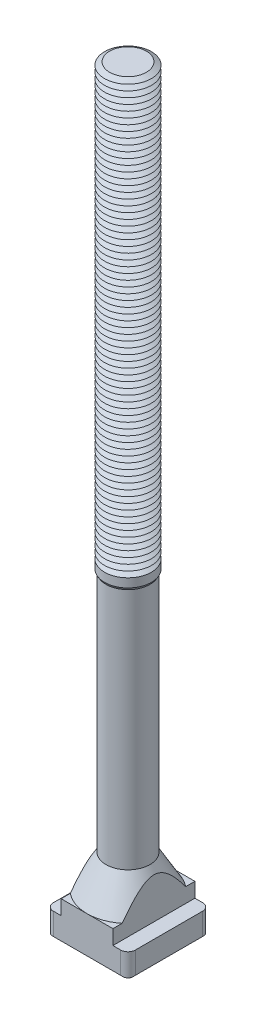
ISO-10303-21;
HEADER;
FILE_DESCRIPTION(('STEP AP214'),'2;1');
FILE_NAME('part.step','',(''),(''),'','','');
FILE_SCHEMA(('AUTOMOTIVE_DESIGN { 1 0 10303 214 1 1 1 1 }'));
ENDSEC;
DATA;
#1=APPLICATION_CONTEXT('core data for automotive mechanical design processes');
#2=APPLICATION_PROTOCOL_DEFINITION('international standard','automotive_design',2000,#1);
#3=PRODUCT_CONTEXT('',#1,'mechanical');
#4=PRODUCT('Part','Part','',(#3));
#5=PRODUCT_RELATED_PRODUCT_CATEGORY('part','',(#4));
#6=PRODUCT_DEFINITION_FORMATION('','',#4);
#7=PRODUCT_DEFINITION_CONTEXT('part definition',#1,'design');
#8=PRODUCT_DEFINITION('design','',#6,#7);
#9=PRODUCT_DEFINITION_SHAPE('','',#8);
#10=(LENGTH_UNIT() NAMED_UNIT(*) SI_UNIT(.MILLI.,.METRE.));
#11=(NAMED_UNIT(*) PLANE_ANGLE_UNIT() SI_UNIT($,.RADIAN.));
#12=(NAMED_UNIT(*) SI_UNIT($,.STERADIAN.) SOLID_ANGLE_UNIT());
#13=UNCERTAINTY_MEASURE_WITH_UNIT(LENGTH_MEASURE(1.E-05),#10,'distance_accuracy_value','');
#14=(GEOMETRIC_REPRESENTATION_CONTEXT(3) GLOBAL_UNCERTAINTY_ASSIGNED_CONTEXT((#13)) GLOBAL_UNIT_ASSIGNED_CONTEXT((#10,
#11,#12)) REPRESENTATION_CONTEXT('',''));
#15=CARTESIAN_POINT('',(0.,0.,0.));
#16=DIRECTION('',(0.,0.,1.));
#17=DIRECTION('',(1.,0.,0.));
#18=AXIS2_PLACEMENT_3D('',#15,#16,#17);
#19=CARTESIAN_POINT('',(0.,252.,0.));
#20=DIRECTION('',(0.,-1.,0.));
#21=DIRECTION('',(0.,0.,-1.));
#22=AXIS2_PLACEMENT_3D('',#19,#20,#21);
#23=CONICAL_SURFACE('',#22,6.26794919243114,1.0471975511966);
#24=CARTESIAN_POINT('',(0.,251.,0.));
#25=DIRECTION('',(0.,-1.,0.));
#26=DIRECTION('',(0.,0.,-1.));
#27=AXIS2_PLACEMENT_3D('',#24,#25,#26);
#28=CIRCLE('',#27,8.00000000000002);
#29=CARTESIAN_POINT('',(0.,251.,-8.00000000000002));
#30=VERTEX_POINT('',#29);
#31=EDGE_CURVE('E873',#30,#30,#28,.T.);
#32=ORIENTED_EDGE('',*,*,#31,.F.);
#33=EDGE_LOOP('',(#32));
#34=FACE_BOUND('',#33,.T.);
#35=CARTESIAN_POINT('',(0.,252.,0.));
#36=DIRECTION('',(0.,-1.,0.));
#37=DIRECTION('',(0.,0.,-1.));
#38=AXIS2_PLACEMENT_3D('',#35,#36,#37);
#39=CIRCLE('',#38,6.26794919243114);
#40=CARTESIAN_POINT('',(0.,252.,-6.26794919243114));
#41=VERTEX_POINT('',#40);
#42=EDGE_CURVE('E779',#41,#41,#39,.T.);
#43=ORIENTED_EDGE('',*,*,#42,.T.);
#44=EDGE_LOOP('',(#43));
#45=FACE_BOUND('',#44,.T.);
#46=ADVANCED_FACE('F39',(#34,#45),#23,.T.);
#47=CARTESIAN_POINT('',(0.,253.,0.));
#48=DIRECTION('',(0.,1.,0.));
#49=DIRECTION('',(0.,0.,1.));
#50=AXIS2_PLACEMENT_3D('',#47,#48,#49);
#51=CONICAL_SURFACE('',#50,8.00000000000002,1.0471975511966);
#52=ORIENTED_EDGE('',*,*,#42,.F.);
#53=EDGE_LOOP('',(#52));
#54=FACE_BOUND('',#53,.T.);
#55=CARTESIAN_POINT('',(0.,253.,0.));
#56=DIRECTION('',(0.,-1.,0.));
#57=DIRECTION('',(0.,0.,-1.));
#58=AXIS2_PLACEMENT_3D('',#55,#56,#57);
#59=CIRCLE('',#58,8.00000000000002);
#60=CARTESIAN_POINT('',(0.,253.,-8.00000000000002));
#61=VERTEX_POINT('',#60);
#62=EDGE_CURVE('E775',#61,#61,#59,.T.);
#63=ORIENTED_EDGE('',*,*,#62,.T.);
#64=EDGE_LOOP('',(#63));
#65=FACE_BOUND('',#64,.T.);
#66=ADVANCED_FACE('F450',(#54,#65),#51,.T.);
#67=CARTESIAN_POINT('',(3.91971200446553,260.,0.));
#68=DIRECTION('',(0.,-1.,0.));
#69=DIRECTION('',(1.,0.,0.));
#70=AXIS2_PLACEMENT_3D('',#67,#68,#69);
#71=PLANE('',#70);
#72=CARTESIAN_POINT('',(0.,260.,0.));
#73=DIRECTION('',(0.,-1.,0.));
#74=DIRECTION('',(0.,0.,-1.));
#75=AXIS2_PLACEMENT_3D('',#72,#73,#74);
#76=CIRCLE('',#75,6.26794919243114);
#77=CARTESIAN_POINT('',(0.,260.,-6.26794919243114));
#78=VERTEX_POINT('',#77);
#79=EDGE_CURVE('E784',#78,#78,#76,.T.);
#80=ORIENTED_EDGE('',*,*,#79,.F.);
#81=EDGE_LOOP('',(#80));
#82=FACE_BOUND('',#81,.T.);
#83=ADVANCED_FACE('F456',(#82),#71,.F.);
#84=CARTESIAN_POINT('',(0.,260.,0.));
#85=DIRECTION('',(0.,-1.,0.));
#86=DIRECTION('',(0.,0.,-1.));
#87=AXIS2_PLACEMENT_3D('',#84,#85,#86);
#88=CONICAL_SURFACE('',#87,6.26794919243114,1.0471975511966);
#89=CARTESIAN_POINT('',(0.,259.,0.));
#90=DIRECTION('',(0.,-1.,0.));
#91=DIRECTION('',(0.,0.,-1.));
#92=AXIS2_PLACEMENT_3D('',#89,#90,#91);
#93=CIRCLE('',#92,8.00000000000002);
#94=CARTESIAN_POINT('',(0.,259.,-8.00000000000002));
#95=VERTEX_POINT('',#94);
#96=EDGE_CURVE('E892',#95,#95,#93,.T.);
#97=ORIENTED_EDGE('',*,*,#96,.F.);
#98=EDGE_LOOP('',(#97));
#99=FACE_BOUND('',#98,.T.);
#100=ORIENTED_EDGE('',*,*,#79,.T.);
#101=EDGE_LOOP('',(#100));
#102=FACE_BOUND('',#101,.T.);
#103=ADVANCED_FACE('F484',(#99,#102),#88,.T.);
#104=CARTESIAN_POINT('',(0.,259.,0.));
#105=DIRECTION('',(0.,1.,0.));
#106=DIRECTION('',(0.,0.,1.));
#107=AXIS2_PLACEMENT_3D('',#104,#105,#106);
#108=CONICAL_SURFACE('',#107,8.00000000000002,1.0471975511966);
#109=CARTESIAN_POINT('',(0.,258.,0.));
#110=DIRECTION('',(0.,-1.,0.));
#111=DIRECTION('',(0.,0.,-1.));
#112=AXIS2_PLACEMENT_3D('',#109,#110,#111);
#113=CIRCLE('',#112,6.26794919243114);
#114=CARTESIAN_POINT('',(0.,258.,-6.26794919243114));
#115=VERTEX_POINT('',#114);
#116=EDGE_CURVE('E888',#115,#115,#113,.T.);
#117=ORIENTED_EDGE('',*,*,#116,.F.);
#118=EDGE_LOOP('',(#117));
#119=FACE_BOUND('',#118,.T.);
#120=ORIENTED_EDGE('',*,*,#96,.T.);
#121=EDGE_LOOP('',(#120));
#122=FACE_BOUND('',#121,.T.);
#123=ADVANCED_FACE('F481',(#119,#122),#108,.T.);
#124=CARTESIAN_POINT('',(0.,258.,0.));
#125=DIRECTION('',(0.,-1.,0.));
#126=DIRECTION('',(0.,0.,-1.));
#127=AXIS2_PLACEMENT_3D('',#124,#125,#126);
#128=CONICAL_SURFACE('',#127,6.26794919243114,1.0471975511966);
#129=CARTESIAN_POINT('',(0.,257.,0.));
#130=DIRECTION('',(0.,-1.,0.));
#131=DIRECTION('',(0.,0.,-1.));
#132=AXIS2_PLACEMENT_3D('',#129,#130,#131);
#133=CIRCLE('',#132,8.00000000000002);
#134=CARTESIAN_POINT('',(0.,257.,-8.00000000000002));
#135=VERTEX_POINT('',#134);
#136=EDGE_CURVE('E727',#135,#135,#133,.T.);
#137=ORIENTED_EDGE('',*,*,#136,.F.);
#138=EDGE_LOOP('',(#137));
#139=FACE_BOUND('',#138,.T.);
#140=ORIENTED_EDGE('',*,*,#116,.T.);
#141=EDGE_LOOP('',(#140));
#142=FACE_BOUND('',#141,.T.);
#143=ADVANCED_FACE('F476',(#139,#142),#128,.T.);
#144=CARTESIAN_POINT('',(0.,257.,0.));
#145=DIRECTION('',(0.,1.,0.));
#146=DIRECTION('',(0.,0.,1.));
#147=AXIS2_PLACEMENT_3D('',#144,#145,#146);
#148=CONICAL_SURFACE('',#147,8.00000000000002,1.0471975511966);
#149=CARTESIAN_POINT('',(0.,256.,0.));
#150=DIRECTION('',(0.,-1.,0.));
#151=DIRECTION('',(0.,0.,-1.));
#152=AXIS2_PLACEMENT_3D('',#149,#150,#151);
#153=CIRCLE('',#152,6.26794919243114);
#154=CARTESIAN_POINT('',(0.,256.,-6.26794919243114));
#155=VERTEX_POINT('',#154);
#156=EDGE_CURVE('E725',#155,#155,#153,.T.);
#157=ORIENTED_EDGE('',*,*,#156,.F.);
#158=EDGE_LOOP('',(#157));
#159=FACE_BOUND('',#158,.T.);
#160=ORIENTED_EDGE('',*,*,#136,.T.);
#161=EDGE_LOOP('',(#160));
#162=FACE_BOUND('',#161,.T.);
#163=ADVANCED_FACE('F473',(#159,#162),#148,.T.);
#164=CARTESIAN_POINT('',(0.,256.,0.));
#165=DIRECTION('',(0.,-1.,0.));
#166=DIRECTION('',(0.,0.,-1.));
#167=AXIS2_PLACEMENT_3D('',#164,#165,#166);
#168=CONICAL_SURFACE('',#167,6.26794919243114,1.0471975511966);
#169=CARTESIAN_POINT('',(0.,255.,0.));
#170=DIRECTION('',(0.,-1.,0.));
#171=DIRECTION('',(0.,0.,-1.));
#172=AXIS2_PLACEMENT_3D('',#169,#170,#171);
#173=CIRCLE('',#172,8.00000000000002);
#174=CARTESIAN_POINT('',(0.,255.,-8.00000000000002));
#175=VERTEX_POINT('',#174);
#176=EDGE_CURVE('E728',#175,#175,#173,.T.);
#177=ORIENTED_EDGE('',*,*,#176,.F.);
#178=EDGE_LOOP('',(#177));
#179=FACE_BOUND('',#178,.T.);
#180=ORIENTED_EDGE('',*,*,#156,.T.);
#181=EDGE_LOOP('',(#180));
#182=FACE_BOUND('',#181,.T.);
#183=ADVANCED_FACE('F467',(#179,#182),#168,.T.);
#184=CARTESIAN_POINT('',(0.,255.,0.));
#185=DIRECTION('',(0.,1.,0.));
#186=DIRECTION('',(0.,0.,1.));
#187=AXIS2_PLACEMENT_3D('',#184,#185,#186);
#188=CONICAL_SURFACE('',#187,8.00000000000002,1.0471975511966);
#189=CARTESIAN_POINT('',(0.,254.,0.));
#190=DIRECTION('',(0.,-1.,0.));
#191=DIRECTION('',(0.,0.,-1.));
#192=AXIS2_PLACEMENT_3D('',#189,#190,#191);
#193=CIRCLE('',#192,6.26794919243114);
#194=CARTESIAN_POINT('',(0.,254.,-6.26794919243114));
#195=VERTEX_POINT('',#194);
#196=EDGE_CURVE('E778',#195,#195,#193,.T.);
#197=ORIENTED_EDGE('',*,*,#196,.F.);
#198=EDGE_LOOP('',(#197));
#199=FACE_BOUND('',#198,.T.);
#200=ORIENTED_EDGE('',*,*,#176,.T.);
#201=EDGE_LOOP('',(#200));
#202=FACE_BOUND('',#201,.T.);
#203=ADVANCED_FACE('F463',(#199,#202),#188,.T.);
#204=CARTESIAN_POINT('',(0.,254.,0.));
#205=DIRECTION('',(0.,-1.,0.));
#206=DIRECTION('',(0.,0.,-1.));
#207=AXIS2_PLACEMENT_3D('',#204,#205,#206);
#208=CONICAL_SURFACE('',#207,6.26794919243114,1.0471975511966);
#209=ORIENTED_EDGE('',*,*,#62,.F.);
#210=EDGE_LOOP('',(#209));
#211=FACE_BOUND('',#210,.T.);
#212=ORIENTED_EDGE('',*,*,#196,.T.);
#213=EDGE_LOOP('',(#212));
#214=FACE_BOUND('',#213,.T.);
#215=ADVANCED_FACE('F466',(#211,#214),#208,.T.);
#216=CARTESIAN_POINT('',(0.,250.,0.));
#217=DIRECTION('',(0.,-1.,0.));
#218=DIRECTION('',(0.,0.,-1.));
#219=AXIS2_PLACEMENT_3D('',#216,#217,#218);
#220=CONICAL_SURFACE('',#219,6.26794919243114,1.0471975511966);
#221=CARTESIAN_POINT('',(0.,249.,0.));
#222=DIRECTION('',(0.,-1.,0.));
#223=DIRECTION('',(0.,0.,-1.));
#224=AXIS2_PLACEMENT_3D('',#221,#222,#223);
#225=CIRCLE('',#224,8.00000000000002);
#226=CARTESIAN_POINT('',(0.,249.,-8.00000000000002));
#227=VERTEX_POINT('',#226);
#228=EDGE_CURVE('E633',#227,#227,#225,.T.);
#229=ORIENTED_EDGE('',*,*,#228,.F.);
#230=EDGE_LOOP('',(#229));
#231=FACE_BOUND('',#230,.T.);
#232=CARTESIAN_POINT('',(0.,250.,0.));
#233=DIRECTION('',(0.,-1.,0.));
#234=DIRECTION('',(0.,0.,-1.));
#235=AXIS2_PLACEMENT_3D('',#232,#233,#234);
#236=CIRCLE('',#235,6.26794919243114);
#237=CARTESIAN_POINT('',(0.,250.,-6.26794919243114));
#238=VERTEX_POINT('',#237);
#239=EDGE_CURVE('E869',#238,#238,#236,.T.);
#240=ORIENTED_EDGE('',*,*,#239,.T.);
#241=EDGE_LOOP('',(#240));
#242=FACE_BOUND('',#241,.T.);
#243=ADVANCED_FACE('F471',(#231,#242),#220,.T.);
#244=CARTESIAN_POINT('',(0.,251.,0.));
#245=DIRECTION('',(0.,1.,0.));
#246=DIRECTION('',(0.,0.,1.));
#247=AXIS2_PLACEMENT_3D('',#244,#245,#246);
#248=CONICAL_SURFACE('',#247,8.00000000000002,1.0471975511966);
#249=ORIENTED_EDGE('',*,*,#239,.F.);
#250=EDGE_LOOP('',(#249));
#251=FACE_BOUND('',#250,.T.);
#252=ORIENTED_EDGE('',*,*,#31,.T.);
#253=EDGE_LOOP('',(#252));
#254=FACE_BOUND('',#253,.T.);
#255=ADVANCED_FACE('F1012',(#251,#254),#248,.T.);
#256=CARTESIAN_POINT('',(0.,248.,0.));
#257=DIRECTION('',(0.,-1.,0.));
#258=DIRECTION('',(0.,0.,-1.));
#259=AXIS2_PLACEMENT_3D('',#256,#257,#258);
#260=CONICAL_SURFACE('',#259,6.26794919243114,1.0471975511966);
#261=CARTESIAN_POINT('',(0.,247.,0.));
#262=DIRECTION('',(0.,-1.,0.));
#263=DIRECTION('',(0.,0.,-1.));
#264=AXIS2_PLACEMENT_3D('',#261,#262,#263);
#265=CIRCLE('',#264,8.00000000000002);
#266=CARTESIAN_POINT('',(0.,247.,-8.00000000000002));
#267=VERTEX_POINT('',#266);
#268=EDGE_CURVE('E693',#267,#267,#265,.T.);
#269=ORIENTED_EDGE('',*,*,#268,.F.);
#270=EDGE_LOOP('',(#269));
#271=FACE_BOUND('',#270,.T.);
#272=CARTESIAN_POINT('',(0.,248.,0.));
#273=DIRECTION('',(0.,-1.,0.));
#274=DIRECTION('',(0.,0.,-1.));
#275=AXIS2_PLACEMENT_3D('',#272,#273,#274);
#276=CIRCLE('',#275,6.26794919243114);
#277=CARTESIAN_POINT('',(0.,248.,-6.26794919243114));
#278=VERTEX_POINT('',#277);
#279=EDGE_CURVE('E696',#278,#278,#276,.T.);
#280=ORIENTED_EDGE('',*,*,#279,.T.);
#281=EDGE_LOOP('',(#280));
#282=FACE_BOUND('',#281,.T.);
#283=ADVANCED_FACE('F1008',(#271,#282),#260,.T.);
#284=CARTESIAN_POINT('',(0.,249.,0.));
#285=DIRECTION('',(0.,1.,0.));
#286=DIRECTION('',(0.,0.,1.));
#287=AXIS2_PLACEMENT_3D('',#284,#285,#286);
#288=CONICAL_SURFACE('',#287,8.00000000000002,1.0471975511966);
#289=ORIENTED_EDGE('',*,*,#279,.F.);
#290=EDGE_LOOP('',(#289));
#291=FACE_BOUND('',#290,.T.);
#292=ORIENTED_EDGE('',*,*,#228,.T.);
#293=EDGE_LOOP('',(#292));
#294=FACE_BOUND('',#293,.T.);
#295=ADVANCED_FACE('F1004',(#291,#294),#288,.T.);
#296=CARTESIAN_POINT('',(0.,246.,0.));
#297=DIRECTION('',(0.,-1.,0.));
#298=DIRECTION('',(0.,0.,-1.));
#299=AXIS2_PLACEMENT_3D('',#296,#297,#298);
#300=CONICAL_SURFACE('',#299,6.26794919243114,1.0471975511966);
#301=CARTESIAN_POINT('',(0.,245.,0.));
#302=DIRECTION('',(0.,-1.,0.));
#303=DIRECTION('',(0.,0.,-1.));
#304=AXIS2_PLACEMENT_3D('',#301,#302,#303);
#305=CIRCLE('',#304,8.00000000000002);
#306=CARTESIAN_POINT('',(0.,245.,-8.00000000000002));
#307=VERTEX_POINT('',#306);
#308=EDGE_CURVE('E857',#307,#307,#305,.T.);
#309=ORIENTED_EDGE('',*,*,#308,.F.);
#310=EDGE_LOOP('',(#309));
#311=FACE_BOUND('',#310,.T.);
#312=CARTESIAN_POINT('',(0.,246.,0.));
#313=DIRECTION('',(0.,-1.,0.));
#314=DIRECTION('',(0.,0.,-1.));
#315=AXIS2_PLACEMENT_3D('',#312,#313,#314);
#316=CIRCLE('',#315,6.26794919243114);
#317=CARTESIAN_POINT('',(0.,246.,-6.26794919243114));
#318=VERTEX_POINT('',#317);
#319=EDGE_CURVE('E697',#318,#318,#316,.T.);
#320=ORIENTED_EDGE('',*,*,#319,.T.);
#321=EDGE_LOOP('',(#320));
#322=FACE_BOUND('',#321,.T.);
#323=ADVANCED_FACE('F1000',(#311,#322),#300,.T.);
#324=CARTESIAN_POINT('',(0.,247.,0.));
#325=DIRECTION('',(0.,1.,0.));
#326=DIRECTION('',(0.,0.,1.));
#327=AXIS2_PLACEMENT_3D('',#324,#325,#326);
#328=CONICAL_SURFACE('',#327,8.00000000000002,1.0471975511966);
#329=ORIENTED_EDGE('',*,*,#319,.F.);
#330=EDGE_LOOP('',(#329));
#331=FACE_BOUND('',#330,.T.);
#332=ORIENTED_EDGE('',*,*,#268,.T.);
#333=EDGE_LOOP('',(#332));
#334=FACE_BOUND('',#333,.T.);
#335=ADVANCED_FACE('F996',(#331,#334),#328,.T.);
#336=CARTESIAN_POINT('',(0.,244.,0.));
#337=DIRECTION('',(0.,-1.,0.));
#338=DIRECTION('',(0.,0.,-1.));
#339=AXIS2_PLACEMENT_3D('',#336,#337,#338);
#340=CONICAL_SURFACE('',#339,6.26794919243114,1.0471975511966);
#341=CARTESIAN_POINT('',(0.,243.,0.));
#342=DIRECTION('',(0.,-1.,0.));
#343=DIRECTION('',(0.,0.,-1.));
#344=AXIS2_PLACEMENT_3D('',#341,#342,#343);
#345=CIRCLE('',#344,8.00000000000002);
#346=CARTESIAN_POINT('',(0.,243.,-8.00000000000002));
#347=VERTEX_POINT('',#346);
#348=EDGE_CURVE('E850',#347,#347,#345,.T.);
#349=ORIENTED_EDGE('',*,*,#348,.F.);
#350=EDGE_LOOP('',(#349));
#351=FACE_BOUND('',#350,.T.);
#352=CARTESIAN_POINT('',(0.,244.,0.));
#353=DIRECTION('',(0.,-1.,0.));
#354=DIRECTION('',(0.,0.,-1.));
#355=AXIS2_PLACEMENT_3D('',#352,#353,#354);
#356=CIRCLE('',#355,6.26794919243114);
#357=CARTESIAN_POINT('',(0.,244.,-6.26794919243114));
#358=VERTEX_POINT('',#357);
#359=EDGE_CURVE('E853',#358,#358,#356,.T.);
#360=ORIENTED_EDGE('',*,*,#359,.T.);
#361=EDGE_LOOP('',(#360));
#362=FACE_BOUND('',#361,.T.);
#363=ADVANCED_FACE('F992',(#351,#362),#340,.T.);
#364=CARTESIAN_POINT('',(0.,245.,0.));
#365=DIRECTION('',(0.,1.,0.));
#366=DIRECTION('',(0.,0.,1.));
#367=AXIS2_PLACEMENT_3D('',#364,#365,#366);
#368=CONICAL_SURFACE('',#367,8.00000000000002,1.0471975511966);
#369=ORIENTED_EDGE('',*,*,#359,.F.);
#370=EDGE_LOOP('',(#369));
#371=FACE_BOUND('',#370,.T.);
#372=ORIENTED_EDGE('',*,*,#308,.T.);
#373=EDGE_LOOP('',(#372));
#374=FACE_BOUND('',#373,.T.);
#375=ADVANCED_FACE('F988',(#371,#374),#368,.T.);
#376=CARTESIAN_POINT('',(0.,242.,0.));
#377=DIRECTION('',(0.,-1.,0.));
#378=DIRECTION('',(0.,0.,-1.));
#379=AXIS2_PLACEMENT_3D('',#376,#377,#378);
#380=CONICAL_SURFACE('',#379,6.26794919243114,1.0471975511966);
#381=CARTESIAN_POINT('',(0.,241.,0.));
#382=DIRECTION('',(0.,-1.,0.));
#383=DIRECTION('',(0.,0.,-1.));
#384=AXIS2_PLACEMENT_3D('',#381,#382,#383);
#385=CIRCLE('',#384,8.00000000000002);
#386=CARTESIAN_POINT('',(0.,241.,-8.00000000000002));
#387=VERTEX_POINT('',#386);
#388=EDGE_CURVE('E842',#387,#387,#385,.T.);
#389=ORIENTED_EDGE('',*,*,#388,.F.);
#390=EDGE_LOOP('',(#389));
#391=FACE_BOUND('',#390,.T.);
#392=CARTESIAN_POINT('',(0.,242.,0.));
#393=DIRECTION('',(0.,-1.,0.));
#394=DIRECTION('',(0.,0.,-1.));
#395=AXIS2_PLACEMENT_3D('',#392,#393,#394);
#396=CIRCLE('',#395,6.26794919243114);
#397=CARTESIAN_POINT('',(0.,242.,-6.26794919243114));
#398=VERTEX_POINT('',#397);
#399=EDGE_CURVE('E846',#398,#398,#396,.T.);
#400=ORIENTED_EDGE('',*,*,#399,.T.);
#401=EDGE_LOOP('',(#400));
#402=FACE_BOUND('',#401,.T.);
#403=ADVANCED_FACE('F984',(#391,#402),#380,.T.);
#404=CARTESIAN_POINT('',(0.,243.,0.));
#405=DIRECTION('',(0.,1.,0.));
#406=DIRECTION('',(0.,0.,1.));
#407=AXIS2_PLACEMENT_3D('',#404,#405,#406);
#408=CONICAL_SURFACE('',#407,8.00000000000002,1.0471975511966);
#409=ORIENTED_EDGE('',*,*,#399,.F.);
#410=EDGE_LOOP('',(#409));
#411=FACE_BOUND('',#410,.T.);
#412=ORIENTED_EDGE('',*,*,#348,.T.);
#413=EDGE_LOOP('',(#412));
#414=FACE_BOUND('',#413,.T.);
#415=ADVANCED_FACE('F980',(#411,#414),#408,.T.);
#416=CARTESIAN_POINT('',(0.,240.,0.));
#417=DIRECTION('',(0.,-1.,0.));
#418=DIRECTION('',(0.,0.,-1.));
#419=AXIS2_PLACEMENT_3D('',#416,#417,#418);
#420=CONICAL_SURFACE('',#419,6.26794919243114,1.0471975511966);
#421=CARTESIAN_POINT('',(0.,239.,0.));
#422=DIRECTION('',(0.,-1.,0.));
#423=DIRECTION('',(0.,0.,-1.));
#424=AXIS2_PLACEMENT_3D('',#421,#422,#423);
#425=CIRCLE('',#424,8.00000000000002);
#426=CARTESIAN_POINT('',(0.,239.,-8.00000000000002));
#427=VERTEX_POINT('',#426);
#428=EDGE_CURVE('E829',#427,#427,#425,.T.);
#429=ORIENTED_EDGE('',*,*,#428,.F.);
#430=EDGE_LOOP('',(#429));
#431=FACE_BOUND('',#430,.T.);
#432=CARTESIAN_POINT('',(0.,240.,0.));
#433=DIRECTION('',(0.,-1.,0.));
#434=DIRECTION('',(0.,0.,-1.));
#435=AXIS2_PLACEMENT_3D('',#432,#433,#434);
#436=CIRCLE('',#435,6.26794919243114);
#437=CARTESIAN_POINT('',(0.,240.,-6.26794919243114));
#438=VERTEX_POINT('',#437);
#439=EDGE_CURVE('E838',#438,#438,#436,.T.);
#440=ORIENTED_EDGE('',*,*,#439,.T.);
#441=EDGE_LOOP('',(#440));
#442=FACE_BOUND('',#441,.T.);
#443=ADVANCED_FACE('F976',(#431,#442),#420,.T.);
#444=CARTESIAN_POINT('',(0.,241.,0.));
#445=DIRECTION('',(0.,1.,0.));
#446=DIRECTION('',(0.,0.,1.));
#447=AXIS2_PLACEMENT_3D('',#444,#445,#446);
#448=CONICAL_SURFACE('',#447,8.00000000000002,1.0471975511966);
#449=ORIENTED_EDGE('',*,*,#439,.F.);
#450=EDGE_LOOP('',(#449));
#451=FACE_BOUND('',#450,.T.);
#452=ORIENTED_EDGE('',*,*,#388,.T.);
#453=EDGE_LOOP('',(#452));
#454=FACE_BOUND('',#453,.T.);
#455=ADVANCED_FACE('F972',(#451,#454),#448,.T.);
#456=CARTESIAN_POINT('',(0.,238.,0.));
#457=DIRECTION('',(0.,-1.,0.));
#458=DIRECTION('',(0.,0.,-1.));
#459=AXIS2_PLACEMENT_3D('',#456,#457,#458);
#460=CONICAL_SURFACE('',#459,6.26794919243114,1.0471975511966);
#461=CARTESIAN_POINT('',(0.,237.,0.));
#462=DIRECTION('',(0.,-1.,0.));
#463=DIRECTION('',(0.,0.,-1.));
#464=AXIS2_PLACEMENT_3D('',#461,#462,#463);
#465=CIRCLE('',#464,8.00000000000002);
#466=CARTESIAN_POINT('',(0.,237.,-8.00000000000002));
#467=VERTEX_POINT('',#466);
#468=EDGE_CURVE('E821',#467,#467,#465,.T.);
#469=ORIENTED_EDGE('',*,*,#468,.F.);
#470=EDGE_LOOP('',(#469));
#471=FACE_BOUND('',#470,.T.);
#472=CARTESIAN_POINT('',(0.,238.,0.));
#473=DIRECTION('',(0.,-1.,0.));
#474=DIRECTION('',(0.,0.,-1.));
#475=AXIS2_PLACEMENT_3D('',#472,#473,#474);
#476=CIRCLE('',#475,6.26794919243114);
#477=CARTESIAN_POINT('',(0.,238.,-6.26794919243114));
#478=VERTEX_POINT('',#477);
#479=EDGE_CURVE('E823',#478,#478,#476,.T.);
#480=ORIENTED_EDGE('',*,*,#479,.T.);
#481=EDGE_LOOP('',(#480));
#482=FACE_BOUND('',#481,.T.);
#483=ADVANCED_FACE('F968',(#471,#482),#460,.T.);
#484=CARTESIAN_POINT('',(0.,239.,0.));
#485=DIRECTION('',(0.,1.,0.));
#486=DIRECTION('',(0.,0.,1.));
#487=AXIS2_PLACEMENT_3D('',#484,#485,#486);
#488=CONICAL_SURFACE('',#487,8.00000000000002,1.0471975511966);
#489=ORIENTED_EDGE('',*,*,#479,.F.);
#490=EDGE_LOOP('',(#489));
#491=FACE_BOUND('',#490,.T.);
#492=ORIENTED_EDGE('',*,*,#428,.T.);
#493=EDGE_LOOP('',(#492));
#494=FACE_BOUND('',#493,.T.);
#495=ADVANCED_FACE('F954',(#491,#494),#488,.T.);
#496=CARTESIAN_POINT('',(0.,236.,0.));
#497=DIRECTION('',(0.,-1.,0.));
#498=DIRECTION('',(0.,0.,-1.));
#499=AXIS2_PLACEMENT_3D('',#496,#497,#498);
#500=CONICAL_SURFACE('',#499,6.26794919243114,1.0471975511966);
#501=CARTESIAN_POINT('',(0.,235.,0.));
#502=DIRECTION('',(0.,-1.,0.));
#503=DIRECTION('',(0.,0.,-1.));
#504=AXIS2_PLACEMENT_3D('',#501,#502,#503);
#505=CIRCLE('',#504,8.00000000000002);
#506=CARTESIAN_POINT('',(0.,235.,-8.00000000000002));
#507=VERTEX_POINT('',#506);
#508=EDGE_CURVE('E687',#507,#507,#505,.T.);
#509=ORIENTED_EDGE('',*,*,#508,.F.);
#510=EDGE_LOOP('',(#509));
#511=FACE_BOUND('',#510,.T.);
#512=CARTESIAN_POINT('',(0.,236.,0.));
#513=DIRECTION('',(0.,-1.,0.));
#514=DIRECTION('',(0.,0.,-1.));
#515=AXIS2_PLACEMENT_3D('',#512,#513,#514);
#516=CIRCLE('',#515,6.26794919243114);
#517=CARTESIAN_POINT('',(0.,236.,-6.26794919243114));
#518=VERTEX_POINT('',#517);
#519=EDGE_CURVE('E690',#518,#518,#516,.T.);
#520=ORIENTED_EDGE('',*,*,#519,.T.);
#521=EDGE_LOOP('',(#520));
#522=FACE_BOUND('',#521,.T.);
#523=ADVANCED_FACE('F950',(#511,#522),#500,.T.);
#524=CARTESIAN_POINT('',(0.,237.,0.));
#525=DIRECTION('',(0.,1.,0.));
#526=DIRECTION('',(0.,0.,1.));
#527=AXIS2_PLACEMENT_3D('',#524,#525,#526);
#528=CONICAL_SURFACE('',#527,8.00000000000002,1.0471975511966);
#529=ORIENTED_EDGE('',*,*,#519,.F.);
#530=EDGE_LOOP('',(#529));
#531=FACE_BOUND('',#530,.T.);
#532=ORIENTED_EDGE('',*,*,#468,.T.);
#533=EDGE_LOOP('',(#532));
#534=FACE_BOUND('',#533,.T.);
#535=ADVANCED_FACE('F953',(#531,#534),#528,.T.);
#536=CARTESIAN_POINT('',(0.,234.,0.));
#537=DIRECTION('',(0.,-1.,0.));
#538=DIRECTION('',(0.,0.,-1.));
#539=AXIS2_PLACEMENT_3D('',#536,#537,#538);
#540=CONICAL_SURFACE('',#539,6.26794919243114,1.0471975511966);
#541=CARTESIAN_POINT('',(0.,233.,0.));
#542=DIRECTION('',(0.,-1.,0.));
#543=DIRECTION('',(0.,0.,-1.));
#544=AXIS2_PLACEMENT_3D('',#541,#542,#543);
#545=CIRCLE('',#544,8.00000000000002);
#546=CARTESIAN_POINT('',(0.,233.,-8.00000000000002));
#547=VERTEX_POINT('',#546);
#548=EDGE_CURVE('E933',#547,#547,#545,.T.);
#549=ORIENTED_EDGE('',*,*,#548,.F.);
#550=EDGE_LOOP('',(#549));
#551=FACE_BOUND('',#550,.T.);
#552=CARTESIAN_POINT('',(0.,234.,0.));
#553=DIRECTION('',(0.,-1.,0.));
#554=DIRECTION('',(0.,0.,-1.));
#555=AXIS2_PLACEMENT_3D('',#552,#553,#554);
#556=CIRCLE('',#555,6.26794919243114);
#557=CARTESIAN_POINT('',(0.,234.,-6.26794919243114));
#558=VERTEX_POINT('',#557);
#559=EDGE_CURVE('E691',#558,#558,#556,.T.);
#560=ORIENTED_EDGE('',*,*,#559,.T.);
#561=EDGE_LOOP('',(#560));
#562=FACE_BOUND('',#561,.T.);
#563=ADVANCED_FACE('F941',(#551,#562),#540,.T.);
#564=CARTESIAN_POINT('',(0.,235.,0.));
#565=DIRECTION('',(0.,1.,0.));
#566=DIRECTION('',(0.,0.,1.));
#567=AXIS2_PLACEMENT_3D('',#564,#565,#566);
#568=CONICAL_SURFACE('',#567,8.00000000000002,1.0471975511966);
#569=ORIENTED_EDGE('',*,*,#559,.F.);
#570=EDGE_LOOP('',(#569));
#571=FACE_BOUND('',#570,.T.);
#572=ORIENTED_EDGE('',*,*,#508,.T.);
#573=EDGE_LOOP('',(#572));
#574=FACE_BOUND('',#573,.T.);
#575=ADVANCED_FACE('F943',(#571,#574),#568,.T.);
#576=CARTESIAN_POINT('',(0.,232.,0.));
#577=DIRECTION('',(0.,-1.,0.));
#578=DIRECTION('',(0.,0.,-1.));
#579=AXIS2_PLACEMENT_3D('',#576,#577,#578);
#580=CONICAL_SURFACE('',#579,6.26794919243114,1.0471975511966);
#581=CARTESIAN_POINT('',(0.,231.,0.));
#582=DIRECTION('',(0.,-1.,0.));
#583=DIRECTION('',(0.,0.,-1.));
#584=AXIS2_PLACEMENT_3D('',#581,#582,#583);
#585=CIRCLE('',#584,8.00000000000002);
#586=CARTESIAN_POINT('',(0.,231.,-8.00000000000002));
#587=VERTEX_POINT('',#586);
#588=EDGE_CURVE('E684',#587,#587,#585,.T.);
#589=ORIENTED_EDGE('',*,*,#588,.F.);
#590=EDGE_LOOP('',(#589));
#591=FACE_BOUND('',#590,.T.);
#592=CARTESIAN_POINT('',(0.,232.,0.));
#593=DIRECTION('',(0.,-1.,0.));
#594=DIRECTION('',(0.,0.,-1.));
#595=AXIS2_PLACEMENT_3D('',#592,#593,#594);
#596=CIRCLE('',#595,6.26794919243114);
#597=CARTESIAN_POINT('',(0.,232.,-6.26794919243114));
#598=VERTEX_POINT('',#597);
#599=EDGE_CURVE('E929',#598,#598,#596,.T.);
#600=ORIENTED_EDGE('',*,*,#599,.T.);
#601=EDGE_LOOP('',(#600));
#602=FACE_BOUND('',#601,.T.);
#603=ADVANCED_FACE('F946',(#591,#602),#580,.T.);
#604=CARTESIAN_POINT('',(0.,233.,0.));
#605=DIRECTION('',(0.,1.,0.));
#606=DIRECTION('',(0.,0.,1.));
#607=AXIS2_PLACEMENT_3D('',#604,#605,#606);
#608=CONICAL_SURFACE('',#607,8.00000000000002,1.0471975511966);
#609=ORIENTED_EDGE('',*,*,#599,.F.);
#610=EDGE_LOOP('',(#609));
#611=FACE_BOUND('',#610,.T.);
#612=ORIENTED_EDGE('',*,*,#548,.T.);
#613=EDGE_LOOP('',(#612));
#614=FACE_BOUND('',#613,.T.);
#615=ADVANCED_FACE('F1089',(#611,#614),#608,.T.);
#616=CARTESIAN_POINT('',(0.,230.,0.));
#617=DIRECTION('',(0.,-1.,0.));
#618=DIRECTION('',(0.,0.,-1.));
#619=AXIS2_PLACEMENT_3D('',#616,#617,#618);
#620=CONICAL_SURFACE('',#619,6.26794919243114,1.0471975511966);
#621=CARTESIAN_POINT('',(0.,229.,0.));
#622=DIRECTION('',(0.,-1.,0.));
#623=DIRECTION('',(0.,0.,-1.));
#624=AXIS2_PLACEMENT_3D('',#621,#622,#623);
#625=CIRCLE('',#624,8.00000000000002);
#626=CARTESIAN_POINT('',(0.,229.,-8.00000000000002));
#627=VERTEX_POINT('',#626);
#628=EDGE_CURVE('E685',#627,#627,#625,.T.);
#629=ORIENTED_EDGE('',*,*,#628,.F.);
#630=EDGE_LOOP('',(#629));
#631=FACE_BOUND('',#630,.T.);
#632=CARTESIAN_POINT('',(0.,230.,0.));
#633=DIRECTION('',(0.,-1.,0.));
#634=DIRECTION('',(0.,0.,-1.));
#635=AXIS2_PLACEMENT_3D('',#632,#633,#634);
#636=CIRCLE('',#635,6.26794919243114);
#637=CARTESIAN_POINT('',(0.,230.,-6.26794919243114));
#638=VERTEX_POINT('',#637);
#639=EDGE_CURVE('E681',#638,#638,#636,.T.);
#640=ORIENTED_EDGE('',*,*,#639,.T.);
#641=EDGE_LOOP('',(#640));
#642=FACE_BOUND('',#641,.T.);
#643=ADVANCED_FACE('F1098',(#631,#642),#620,.T.);
#644=CARTESIAN_POINT('',(0.,231.,0.));
#645=DIRECTION('',(0.,1.,0.));
#646=DIRECTION('',(0.,0.,1.));
#647=AXIS2_PLACEMENT_3D('',#644,#645,#646);
#648=CONICAL_SURFACE('',#647,8.00000000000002,1.0471975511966);
#649=ORIENTED_EDGE('',*,*,#639,.F.);
#650=EDGE_LOOP('',(#649));
#651=FACE_BOUND('',#650,.T.);
#652=ORIENTED_EDGE('',*,*,#588,.T.);
#653=EDGE_LOOP('',(#652));
#654=FACE_BOUND('',#653,.T.);
#655=ADVANCED_FACE('F1107',(#651,#654),#648,.T.);
#656=CARTESIAN_POINT('',(0.,228.,0.));
#657=DIRECTION('',(0.,-1.,0.));
#658=DIRECTION('',(0.,0.,-1.));
#659=AXIS2_PLACEMENT_3D('',#656,#657,#658);
#660=CONICAL_SURFACE('',#659,6.26794919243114,1.0471975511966);
#661=CARTESIAN_POINT('',(0.,227.,0.));
#662=DIRECTION('',(0.,-1.,0.));
#663=DIRECTION('',(0.,0.,-1.));
#664=AXIS2_PLACEMENT_3D('',#661,#662,#663);
#665=CIRCLE('',#664,8.00000000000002);
#666=CARTESIAN_POINT('',(0.,227.,-8.00000000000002));
#667=VERTEX_POINT('',#666);
#668=EDGE_CURVE('E722',#667,#667,#665,.T.);
#669=ORIENTED_EDGE('',*,*,#668,.F.);
#670=EDGE_LOOP('',(#669));
#671=FACE_BOUND('',#670,.T.);
#672=CARTESIAN_POINT('',(0.,228.,0.));
#673=DIRECTION('',(0.,-1.,0.));
#674=DIRECTION('',(0.,0.,-1.));
#675=AXIS2_PLACEMENT_3D('',#672,#673,#674);
#676=CIRCLE('',#675,6.26794919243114);
#677=CARTESIAN_POINT('',(0.,228.,-6.26794919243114));
#678=VERTEX_POINT('',#677);
#679=EDGE_CURVE('E914',#678,#678,#676,.T.);
#680=ORIENTED_EDGE('',*,*,#679,.T.);
#681=EDGE_LOOP('',(#680));
#682=FACE_BOUND('',#681,.T.);
#683=ADVANCED_FACE('F1116',(#671,#682),#660,.T.);
#684=CARTESIAN_POINT('',(0.,229.,0.));
#685=DIRECTION('',(0.,1.,0.));
#686=DIRECTION('',(0.,0.,1.));
#687=AXIS2_PLACEMENT_3D('',#684,#685,#686);
#688=CONICAL_SURFACE('',#687,8.00000000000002,1.0471975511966);
#689=ORIENTED_EDGE('',*,*,#679,.F.);
#690=EDGE_LOOP('',(#689));
#691=FACE_BOUND('',#690,.T.);
#692=ORIENTED_EDGE('',*,*,#628,.T.);
#693=EDGE_LOOP('',(#692));
#694=FACE_BOUND('',#693,.T.);
#695=ADVANCED_FACE('F1125',(#691,#694),#688,.T.);
#696=CARTESIAN_POINT('',(0.,226.,0.));
#697=DIRECTION('',(0.,-1.,0.));
#698=DIRECTION('',(0.,0.,-1.));
#699=AXIS2_PLACEMENT_3D('',#696,#697,#698);
#700=CONICAL_SURFACE('',#699,6.26794919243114,1.0471975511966);
#701=CARTESIAN_POINT('',(0.,225.,0.));
#702=DIRECTION('',(0.,-1.,0.));
#703=DIRECTION('',(0.,0.,-1.));
#704=AXIS2_PLACEMENT_3D('',#701,#702,#703);
#705=CIRCLE('',#704,8.00000000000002);
#706=CARTESIAN_POINT('',(0.,225.,-8.00000000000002));
#707=VERTEX_POINT('',#706);
#708=EDGE_CURVE('E723',#707,#707,#705,.T.);
#709=ORIENTED_EDGE('',*,*,#708,.F.);
#710=EDGE_LOOP('',(#709));
#711=FACE_BOUND('',#710,.T.);
#712=CARTESIAN_POINT('',(0.,226.,0.));
#713=DIRECTION('',(0.,-1.,0.));
#714=DIRECTION('',(0.,0.,-1.));
#715=AXIS2_PLACEMENT_3D('',#712,#713,#714);
#716=CIRCLE('',#715,6.26794919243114);
#717=CARTESIAN_POINT('',(0.,226.,-6.26794919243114));
#718=VERTEX_POINT('',#717);
#719=EDGE_CURVE('E719',#718,#718,#716,.T.);
#720=ORIENTED_EDGE('',*,*,#719,.T.);
#721=EDGE_LOOP('',(#720));
#722=FACE_BOUND('',#721,.T.);
#723=ADVANCED_FACE('F1134',(#711,#722),#700,.T.);
#724=CARTESIAN_POINT('',(0.,227.,0.));
#725=DIRECTION('',(0.,1.,0.));
#726=DIRECTION('',(0.,0.,1.));
#727=AXIS2_PLACEMENT_3D('',#724,#725,#726);
#728=CONICAL_SURFACE('',#727,8.00000000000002,1.0471975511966);
#729=ORIENTED_EDGE('',*,*,#719,.F.);
#730=EDGE_LOOP('',(#729));
#731=FACE_BOUND('',#730,.T.);
#732=ORIENTED_EDGE('',*,*,#668,.T.);
#733=EDGE_LOOP('',(#732));
#734=FACE_BOUND('',#733,.T.);
#735=ADVANCED_FACE('F1143',(#731,#734),#728,.T.);
#736=CARTESIAN_POINT('',(0.,224.,0.));
#737=DIRECTION('',(0.,-1.,0.));
#738=DIRECTION('',(0.,0.,-1.));
#739=AXIS2_PLACEMENT_3D('',#736,#737,#738);
#740=CONICAL_SURFACE('',#739,6.26794919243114,1.0471975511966);
#741=CARTESIAN_POINT('',(0.,223.,0.));
#742=DIRECTION('',(0.,-1.,0.));
#743=DIRECTION('',(0.,0.,-1.));
#744=AXIS2_PLACEMENT_3D('',#741,#742,#743);
#745=CIRCLE('',#744,8.00000000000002);
#746=CARTESIAN_POINT('',(0.,223.,-8.00000000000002));
#747=VERTEX_POINT('',#746);
#748=EDGE_CURVE('E769',#747,#747,#745,.T.);
#749=ORIENTED_EDGE('',*,*,#748,.F.);
#750=EDGE_LOOP('',(#749));
#751=FACE_BOUND('',#750,.T.);
#752=CARTESIAN_POINT('',(0.,224.,0.));
#753=DIRECTION('',(0.,-1.,0.));
#754=DIRECTION('',(0.,0.,-1.));
#755=AXIS2_PLACEMENT_3D('',#752,#753,#754);
#756=CIRCLE('',#755,6.26794919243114);
#757=CARTESIAN_POINT('',(0.,224.,-6.26794919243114));
#758=VERTEX_POINT('',#757);
#759=EDGE_CURVE('E772',#758,#758,#756,.T.);
#760=ORIENTED_EDGE('',*,*,#759,.T.);
#761=EDGE_LOOP('',(#760));
#762=FACE_BOUND('',#761,.T.);
#763=ADVANCED_FACE('F1152',(#751,#762),#740,.T.);
#764=CARTESIAN_POINT('',(0.,225.,0.));
#765=DIRECTION('',(0.,1.,0.));
#766=DIRECTION('',(0.,0.,1.));
#767=AXIS2_PLACEMENT_3D('',#764,#765,#766);
#768=CONICAL_SURFACE('',#767,8.00000000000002,1.0471975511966);
#769=ORIENTED_EDGE('',*,*,#759,.F.);
#770=EDGE_LOOP('',(#769));
#771=FACE_BOUND('',#770,.T.);
#772=ORIENTED_EDGE('',*,*,#708,.T.);
#773=EDGE_LOOP('',(#772));
#774=FACE_BOUND('',#773,.T.);
#775=ADVANCED_FACE('F1161',(#771,#774),#768,.T.);
#776=CARTESIAN_POINT('',(0.,222.,0.));
#777=DIRECTION('',(0.,-1.,0.));
#778=DIRECTION('',(0.,0.,-1.));
#779=AXIS2_PLACEMENT_3D('',#776,#777,#778);
#780=CONICAL_SURFACE('',#779,6.26794919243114,1.0471975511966);
#781=CARTESIAN_POINT('',(0.,221.,0.));
#782=DIRECTION('',(0.,-1.,0.));
#783=DIRECTION('',(0.,0.,-1.));
#784=AXIS2_PLACEMENT_3D('',#781,#782,#783);
#785=CIRCLE('',#784,8.00000000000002);
#786=CARTESIAN_POINT('',(0.,221.,-8.00000000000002));
#787=VERTEX_POINT('',#786);
#788=EDGE_CURVE('E2851',#787,#787,#785,.T.);
#789=ORIENTED_EDGE('',*,*,#788,.F.);
#790=EDGE_LOOP('',(#789));
#791=FACE_BOUND('',#790,.T.);
#792=CARTESIAN_POINT('',(0.,222.,0.));
#793=DIRECTION('',(0.,-1.,0.));
#794=DIRECTION('',(0.,0.,-1.));
#795=AXIS2_PLACEMENT_3D('',#792,#793,#794);
#796=CIRCLE('',#795,6.26794919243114);
#797=CARTESIAN_POINT('',(0.,222.,-6.26794919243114));
#798=VERTEX_POINT('',#797);
#799=EDGE_CURVE('E773',#798,#798,#796,.T.);
#800=ORIENTED_EDGE('',*,*,#799,.T.);
#801=EDGE_LOOP('',(#800));
#802=FACE_BOUND('',#801,.T.);
#803=ADVANCED_FACE('F1170',(#791,#802),#780,.T.);
#804=CARTESIAN_POINT('',(0.,223.,0.));
#805=DIRECTION('',(0.,1.,0.));
#806=DIRECTION('',(0.,0.,1.));
#807=AXIS2_PLACEMENT_3D('',#804,#805,#806);
#808=CONICAL_SURFACE('',#807,8.00000000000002,1.0471975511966);
#809=ORIENTED_EDGE('',*,*,#799,.F.);
#810=EDGE_LOOP('',(#809));
#811=FACE_BOUND('',#810,.T.);
#812=ORIENTED_EDGE('',*,*,#748,.T.);
#813=EDGE_LOOP('',(#812));
#814=FACE_BOUND('',#813,.T.);
#815=ADVANCED_FACE('F1179',(#811,#814),#808,.T.);
#816=CARTESIAN_POINT('',(0.,220.,0.));
#817=DIRECTION('',(0.,-1.,0.));
#818=DIRECTION('',(0.,0.,-1.));
#819=AXIS2_PLACEMENT_3D('',#816,#817,#818);
#820=CONICAL_SURFACE('',#819,6.26794919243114,1.0471975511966);
#821=CARTESIAN_POINT('',(0.,219.,0.));
#822=DIRECTION('',(0.,-1.,0.));
#823=DIRECTION('',(0.,0.,-1.));
#824=AXIS2_PLACEMENT_3D('',#821,#822,#823);
#825=CIRCLE('',#824,8.00000000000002);
#826=CARTESIAN_POINT('',(0.,219.,-8.00000000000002));
#827=VERTEX_POINT('',#826);
#828=EDGE_CURVE('E2844',#827,#827,#825,.T.);
#829=ORIENTED_EDGE('',*,*,#828,.F.);
#830=EDGE_LOOP('',(#829));
#831=FACE_BOUND('',#830,.T.);
#832=CARTESIAN_POINT('',(0.,220.,0.));
#833=DIRECTION('',(0.,-1.,0.));
#834=DIRECTION('',(0.,0.,-1.));
#835=AXIS2_PLACEMENT_3D('',#832,#833,#834);
#836=CIRCLE('',#835,6.26794919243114);
#837=CARTESIAN_POINT('',(0.,220.,-6.26794919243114));
#838=VERTEX_POINT('',#837);
#839=EDGE_CURVE('E2848',#838,#838,#836,.T.);
#840=ORIENTED_EDGE('',*,*,#839,.T.);
#841=EDGE_LOOP('',(#840));
#842=FACE_BOUND('',#841,.T.);
#843=ADVANCED_FACE('F1188',(#831,#842),#820,.T.);
#844=CARTESIAN_POINT('',(0.,221.,0.));
#845=DIRECTION('',(0.,1.,0.));
#846=DIRECTION('',(0.,0.,1.));
#847=AXIS2_PLACEMENT_3D('',#844,#845,#846);
#848=CONICAL_SURFACE('',#847,8.00000000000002,1.0471975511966);
#849=ORIENTED_EDGE('',*,*,#839,.F.);
#850=EDGE_LOOP('',(#849));
#851=FACE_BOUND('',#850,.T.);
#852=ORIENTED_EDGE('',*,*,#788,.T.);
#853=EDGE_LOOP('',(#852));
#854=FACE_BOUND('',#853,.T.);
#855=ADVANCED_FACE('F1197',(#851,#854),#848,.T.);
#856=CARTESIAN_POINT('',(0.,218.,0.));
#857=DIRECTION('',(0.,-1.,0.));
#858=DIRECTION('',(0.,0.,-1.));
#859=AXIS2_PLACEMENT_3D('',#856,#857,#858);
#860=CONICAL_SURFACE('',#859,6.26794919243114,1.0471975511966);
#861=CARTESIAN_POINT('',(0.,217.,0.));
#862=DIRECTION('',(0.,-1.,0.));
#863=DIRECTION('',(0.,0.,-1.));
#864=AXIS2_PLACEMENT_3D('',#861,#862,#863);
#865=CIRCLE('',#864,8.00000000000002);
#866=CARTESIAN_POINT('',(0.,217.,-8.00000000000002));
#867=VERTEX_POINT('',#866);
#868=EDGE_CURVE('E766',#867,#867,#865,.T.);
#869=ORIENTED_EDGE('',*,*,#868,.F.);
#870=EDGE_LOOP('',(#869));
#871=FACE_BOUND('',#870,.T.);
#872=CARTESIAN_POINT('',(0.,218.,0.));
#873=DIRECTION('',(0.,-1.,0.));
#874=DIRECTION('',(0.,0.,-1.));
#875=AXIS2_PLACEMENT_3D('',#872,#873,#874);
#876=CIRCLE('',#875,6.26794919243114);
#877=CARTESIAN_POINT('',(0.,218.,-6.26794919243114));
#878=VERTEX_POINT('',#877);
#879=EDGE_CURVE('E2840',#878,#878,#876,.T.);
#880=ORIENTED_EDGE('',*,*,#879,.T.);
#881=EDGE_LOOP('',(#880));
#882=FACE_BOUND('',#881,.T.);
#883=ADVANCED_FACE('F1206',(#871,#882),#860,.T.);
#884=CARTESIAN_POINT('',(0.,219.,0.));
#885=DIRECTION('',(0.,1.,0.));
#886=DIRECTION('',(0.,0.,1.));
#887=AXIS2_PLACEMENT_3D('',#884,#885,#886);
#888=CONICAL_SURFACE('',#887,8.00000000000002,1.0471975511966);
#889=ORIENTED_EDGE('',*,*,#879,.F.);
#890=EDGE_LOOP('',(#889));
#891=FACE_BOUND('',#890,.T.);
#892=ORIENTED_EDGE('',*,*,#828,.T.);
#893=EDGE_LOOP('',(#892));
#894=FACE_BOUND('',#893,.T.);
#895=ADVANCED_FACE('F1215',(#891,#894),#888,.T.);
#896=CARTESIAN_POINT('',(0.,216.,0.));
#897=DIRECTION('',(0.,-1.,0.));
#898=DIRECTION('',(0.,0.,-1.));
#899=AXIS2_PLACEMENT_3D('',#896,#897,#898);
#900=CONICAL_SURFACE('',#899,6.26794919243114,1.0471975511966);
#901=CARTESIAN_POINT('',(0.,215.,0.));
#902=DIRECTION('',(0.,-1.,0.));
#903=DIRECTION('',(0.,0.,-1.));
#904=AXIS2_PLACEMENT_3D('',#901,#902,#903);
#905=CIRCLE('',#904,8.00000000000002);
#906=CARTESIAN_POINT('',(0.,215.,-8.00000000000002));
#907=VERTEX_POINT('',#906);
#908=EDGE_CURVE('E767',#907,#907,#905,.T.);
#909=ORIENTED_EDGE('',*,*,#908,.F.);
#910=EDGE_LOOP('',(#909));
#911=FACE_BOUND('',#910,.T.);
#912=CARTESIAN_POINT('',(0.,216.,0.));
#913=DIRECTION('',(0.,-1.,0.));
#914=DIRECTION('',(0.,0.,-1.));
#915=AXIS2_PLACEMENT_3D('',#912,#913,#914);
#916=CIRCLE('',#915,6.26794919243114);
#917=CARTESIAN_POINT('',(0.,216.,-6.26794919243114));
#918=VERTEX_POINT('',#917);
#919=EDGE_CURVE('E763',#918,#918,#916,.T.);
#920=ORIENTED_EDGE('',*,*,#919,.T.);
#921=EDGE_LOOP('',(#920));
#922=FACE_BOUND('',#921,.T.);
#923=ADVANCED_FACE('F1224',(#911,#922),#900,.T.);
#924=CARTESIAN_POINT('',(0.,217.,0.));
#925=DIRECTION('',(0.,1.,0.));
#926=DIRECTION('',(0.,0.,1.));
#927=AXIS2_PLACEMENT_3D('',#924,#925,#926);
#928=CONICAL_SURFACE('',#927,8.00000000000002,1.0471975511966);
#929=ORIENTED_EDGE('',*,*,#919,.F.);
#930=EDGE_LOOP('',(#929));
#931=FACE_BOUND('',#930,.T.);
#932=ORIENTED_EDGE('',*,*,#868,.T.);
#933=EDGE_LOOP('',(#932));
#934=FACE_BOUND('',#933,.T.);
#935=ADVANCED_FACE('F1233',(#931,#934),#928,.T.);
#936=CARTESIAN_POINT('',(0.,214.,0.));
#937=DIRECTION('',(0.,-1.,0.));
#938=DIRECTION('',(0.,0.,-1.));
#939=AXIS2_PLACEMENT_3D('',#936,#937,#938);
#940=CONICAL_SURFACE('',#939,6.26794919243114,1.0471975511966);
#941=CARTESIAN_POINT('',(0.,213.,0.));
#942=DIRECTION('',(0.,-1.,0.));
#943=DIRECTION('',(0.,0.,-1.));
#944=AXIS2_PLACEMENT_3D('',#941,#942,#943);
#945=CIRCLE('',#944,8.00000000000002);
#946=CARTESIAN_POINT('',(0.,213.,-8.00000000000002));
#947=VERTEX_POINT('',#946);
#948=EDGE_CURVE('E819',#947,#947,#945,.T.);
#949=ORIENTED_EDGE('',*,*,#948,.F.);
#950=EDGE_LOOP('',(#949));
#951=FACE_BOUND('',#950,.T.);
#952=CARTESIAN_POINT('',(0.,214.,0.));
#953=DIRECTION('',(0.,-1.,0.));
#954=DIRECTION('',(0.,0.,-1.));
#955=AXIS2_PLACEMENT_3D('',#952,#953,#954);
#956=CIRCLE('',#955,6.26794919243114);
#957=CARTESIAN_POINT('',(0.,214.,-6.26794919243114));
#958=VERTEX_POINT('',#957);
#959=EDGE_CURVE('E2830',#958,#958,#956,.T.);
#960=ORIENTED_EDGE('',*,*,#959,.T.);
#961=EDGE_LOOP('',(#960));
#962=FACE_BOUND('',#961,.T.);
#963=ADVANCED_FACE('F1242',(#951,#962),#940,.T.);
#964=CARTESIAN_POINT('',(0.,215.,0.));
#965=DIRECTION('',(0.,1.,0.));
#966=DIRECTION('',(0.,0.,1.));
#967=AXIS2_PLACEMENT_3D('',#964,#965,#966);
#968=CONICAL_SURFACE('',#967,8.00000000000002,1.0471975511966);
#969=ORIENTED_EDGE('',*,*,#959,.F.);
#970=EDGE_LOOP('',(#969));
#971=FACE_BOUND('',#970,.T.);
#972=ORIENTED_EDGE('',*,*,#908,.T.);
#973=EDGE_LOOP('',(#972));
#974=FACE_BOUND('',#973,.T.);
#975=ADVANCED_FACE('F1251',(#971,#974),#968,.T.);
#976=CARTESIAN_POINT('',(0.,212.,0.));
#977=DIRECTION('',(0.,-1.,0.));
#978=DIRECTION('',(0.,0.,-1.));
#979=AXIS2_PLACEMENT_3D('',#976,#977,#978);
#980=CONICAL_SURFACE('',#979,6.26794919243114,1.0471975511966);
#981=CARTESIAN_POINT('',(0.,211.,0.));
#982=DIRECTION('',(0.,-1.,0.));
#983=DIRECTION('',(0.,0.,-1.));
#984=AXIS2_PLACEMENT_3D('',#981,#982,#983);
#985=CIRCLE('',#984,8.00000000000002);
#986=CARTESIAN_POINT('',(0.,211.,-8.00000000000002));
#987=VERTEX_POINT('',#986);
#988=EDGE_CURVE('E757',#987,#987,#985,.T.);
#989=ORIENTED_EDGE('',*,*,#988,.F.);
#990=EDGE_LOOP('',(#989));
#991=FACE_BOUND('',#990,.T.);
#992=CARTESIAN_POINT('',(0.,212.,0.));
#993=DIRECTION('',(0.,-1.,0.));
#994=DIRECTION('',(0.,0.,-1.));
#995=AXIS2_PLACEMENT_3D('',#992,#993,#994);
#996=CIRCLE('',#995,6.26794919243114);
#997=CARTESIAN_POINT('',(0.,212.,-6.26794919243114));
#998=VERTEX_POINT('',#997);
#999=EDGE_CURVE('E760',#998,#998,#996,.T.);
#1000=ORIENTED_EDGE('',*,*,#999,.T.);
#1001=EDGE_LOOP('',(#1000));
#1002=FACE_BOUND('',#1001,.T.);
#1003=ADVANCED_FACE('F1260',(#991,#1002),#980,.T.);
#1004=CARTESIAN_POINT('',(0.,213.,0.));
#1005=DIRECTION('',(0.,1.,0.));
#1006=DIRECTION('',(0.,0.,1.));
#1007=AXIS2_PLACEMENT_3D('',#1004,#1005,#1006);
#1008=CONICAL_SURFACE('',#1007,8.00000000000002,1.0471975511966);
#1009=ORIENTED_EDGE('',*,*,#999,.F.);
#1010=EDGE_LOOP('',(#1009));
#1011=FACE_BOUND('',#1010,.T.);
#1012=ORIENTED_EDGE('',*,*,#948,.T.);
#1013=EDGE_LOOP('',(#1012));
#1014=FACE_BOUND('',#1013,.T.);
#1015=ADVANCED_FACE('F1269',(#1011,#1014),#1008,.T.);
#1016=CARTESIAN_POINT('',(0.,210.,0.));
#1017=DIRECTION('',(0.,-1.,0.));
#1018=DIRECTION('',(0.,0.,-1.));
#1019=AXIS2_PLACEMENT_3D('',#1016,#1017,#1018);
#1020=CONICAL_SURFACE('',#1019,6.26794919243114,1.0471975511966);
#1021=CARTESIAN_POINT('',(0.,209.,0.));
#1022=DIRECTION('',(0.,-1.,0.));
#1023=DIRECTION('',(0.,0.,-1.));
#1024=AXIS2_PLACEMENT_3D('',#1021,#1022,#1023);
#1025=CIRCLE('',#1024,8.00000000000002);
#1026=CARTESIAN_POINT('',(0.,209.,-8.00000000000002));
#1027=VERTEX_POINT('',#1026);
#1028=EDGE_CURVE('E2779',#1027,#1027,#1025,.T.);
#1029=ORIENTED_EDGE('',*,*,#1028,.F.);
#1030=EDGE_LOOP('',(#1029));
#1031=FACE_BOUND('',#1030,.T.);
#1032=CARTESIAN_POINT('',(0.,210.,0.));
#1033=DIRECTION('',(0.,-1.,0.));
#1034=DIRECTION('',(0.,0.,-1.));
#1035=AXIS2_PLACEMENT_3D('',#1032,#1033,#1034);
#1036=CIRCLE('',#1035,6.26794919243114);
#1037=CARTESIAN_POINT('',(0.,210.,-6.26794919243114));
#1038=VERTEX_POINT('',#1037);
#1039=EDGE_CURVE('E761',#1038,#1038,#1036,.T.);
#1040=ORIENTED_EDGE('',*,*,#1039,.T.);
#1041=EDGE_LOOP('',(#1040));
#1042=FACE_BOUND('',#1041,.T.);
#1043=ADVANCED_FACE('F1278',(#1031,#1042),#1020,.T.);
#1044=CARTESIAN_POINT('',(0.,211.,0.));
#1045=DIRECTION('',(0.,1.,0.));
#1046=DIRECTION('',(0.,0.,1.));
#1047=AXIS2_PLACEMENT_3D('',#1044,#1045,#1046);
#1048=CONICAL_SURFACE('',#1047,8.00000000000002,1.0471975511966);
#1049=ORIENTED_EDGE('',*,*,#1039,.F.);
#1050=EDGE_LOOP('',(#1049));
#1051=FACE_BOUND('',#1050,.T.);
#1052=ORIENTED_EDGE('',*,*,#988,.T.);
#1053=EDGE_LOOP('',(#1052));
#1054=FACE_BOUND('',#1053,.T.);
#1055=ADVANCED_FACE('F1287',(#1051,#1054),#1048,.T.);
#1056=CARTESIAN_POINT('',(0.,208.,0.));
#1057=DIRECTION('',(0.,-1.,0.));
#1058=DIRECTION('',(0.,0.,-1.));
#1059=AXIS2_PLACEMENT_3D('',#1056,#1057,#1058);
#1060=CONICAL_SURFACE('',#1059,6.26794919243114,1.0471975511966);
#1061=CARTESIAN_POINT('',(0.,207.,0.));
#1062=DIRECTION('',(0.,-1.,0.));
#1063=DIRECTION('',(0.,0.,-1.));
#1064=AXIS2_PLACEMENT_3D('',#1061,#1062,#1063);
#1065=CIRCLE('',#1064,8.00000000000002);
#1066=CARTESIAN_POINT('',(0.,207.,-8.00000000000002));
#1067=VERTEX_POINT('',#1066);
#1068=EDGE_CURVE('E2780',#1067,#1067,#1065,.T.);
#1069=ORIENTED_EDGE('',*,*,#1068,.F.);
#1070=EDGE_LOOP('',(#1069));
#1071=FACE_BOUND('',#1070,.T.);
#1072=CARTESIAN_POINT('',(0.,208.,0.));
#1073=DIRECTION('',(0.,-1.,0.));
#1074=DIRECTION('',(0.,0.,-1.));
#1075=AXIS2_PLACEMENT_3D('',#1072,#1073,#1074);
#1076=CIRCLE('',#1075,6.26794919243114);
#1077=CARTESIAN_POINT('',(0.,208.,-6.26794919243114));
#1078=VERTEX_POINT('',#1077);
#1079=EDGE_CURVE('E2777',#1078,#1078,#1076,.T.);
#1080=ORIENTED_EDGE('',*,*,#1079,.T.);
#1081=EDGE_LOOP('',(#1080));
#1082=FACE_BOUND('',#1081,.T.);
#1083=ADVANCED_FACE('F1296',(#1071,#1082),#1060,.T.);
#1084=CARTESIAN_POINT('',(0.,209.,0.));
#1085=DIRECTION('',(0.,1.,0.));
#1086=DIRECTION('',(0.,0.,1.));
#1087=AXIS2_PLACEMENT_3D('',#1084,#1085,#1086);
#1088=CONICAL_SURFACE('',#1087,8.00000000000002,1.0471975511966);
#1089=ORIENTED_EDGE('',*,*,#1079,.F.);
#1090=EDGE_LOOP('',(#1089));
#1091=FACE_BOUND('',#1090,.T.);
#1092=ORIENTED_EDGE('',*,*,#1028,.T.);
#1093=EDGE_LOOP('',(#1092));
#1094=FACE_BOUND('',#1093,.T.);
#1095=ADVANCED_FACE('F1305',(#1091,#1094),#1088,.T.);
#1096=CARTESIAN_POINT('',(0.,206.,0.));
#1097=DIRECTION('',(0.,-1.,0.));
#1098=DIRECTION('',(0.,0.,-1.));
#1099=AXIS2_PLACEMENT_3D('',#1096,#1097,#1098);
#1100=CONICAL_SURFACE('',#1099,6.26794919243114,1.0471975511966);
#1101=CARTESIAN_POINT('',(0.,205.,0.));
#1102=DIRECTION('',(0.,-1.,0.));
#1103=DIRECTION('',(0.,0.,-1.));
#1104=AXIS2_PLACEMENT_3D('',#1101,#1102,#1103);
#1105=CIRCLE('',#1104,8.00000000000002);
#1106=CARTESIAN_POINT('',(0.,205.,-8.00000000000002));
#1107=VERTEX_POINT('',#1106);
#1108=EDGE_CURVE('E812',#1107,#1107,#1105,.T.);
#1109=ORIENTED_EDGE('',*,*,#1108,.F.);
#1110=EDGE_LOOP('',(#1109));
#1111=FACE_BOUND('',#1110,.T.);
#1112=CARTESIAN_POINT('',(0.,206.,0.));
#1113=DIRECTION('',(0.,-1.,0.));
#1114=DIRECTION('',(0.,0.,-1.));
#1115=AXIS2_PLACEMENT_3D('',#1112,#1113,#1114);
#1116=CIRCLE('',#1115,6.26794919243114);
#1117=CARTESIAN_POINT('',(0.,206.,-6.26794919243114));
#1118=VERTEX_POINT('',#1117);
#1119=EDGE_CURVE('E815',#1118,#1118,#1116,.T.);
#1120=ORIENTED_EDGE('',*,*,#1119,.T.);
#1121=EDGE_LOOP('',(#1120));
#1122=FACE_BOUND('',#1121,.T.);
#1123=ADVANCED_FACE('F1314',(#1111,#1122),#1100,.T.);
#1124=CARTESIAN_POINT('',(0.,207.,0.));
#1125=DIRECTION('',(0.,1.,0.));
#1126=DIRECTION('',(0.,0.,1.));
#1127=AXIS2_PLACEMENT_3D('',#1124,#1125,#1126);
#1128=CONICAL_SURFACE('',#1127,8.00000000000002,1.0471975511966);
#1129=ORIENTED_EDGE('',*,*,#1119,.F.);
#1130=EDGE_LOOP('',(#1129));
#1131=FACE_BOUND('',#1130,.T.);
#1132=ORIENTED_EDGE('',*,*,#1068,.T.);
#1133=EDGE_LOOP('',(#1132));
#1134=FACE_BOUND('',#1133,.T.);
#1135=ADVANCED_FACE('F1323',(#1131,#1134),#1128,.T.);
#1136=CARTESIAN_POINT('',(0.,204.,0.));
#1137=DIRECTION('',(0.,-1.,0.));
#1138=DIRECTION('',(0.,0.,-1.));
#1139=AXIS2_PLACEMENT_3D('',#1136,#1137,#1138);
#1140=CONICAL_SURFACE('',#1139,6.26794919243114,1.0471975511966);
#1141=CARTESIAN_POINT('',(0.,203.,0.));
#1142=DIRECTION('',(0.,-1.,0.));
#1143=DIRECTION('',(0.,0.,-1.));
#1144=AXIS2_PLACEMENT_3D('',#1141,#1142,#1143);
#1145=CIRCLE('',#1144,8.00000000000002);
#1146=CARTESIAN_POINT('',(0.,203.,-8.00000000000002));
#1147=VERTEX_POINT('',#1146);
#1148=EDGE_CURVE('E2880',#1147,#1147,#1145,.T.);
#1149=ORIENTED_EDGE('',*,*,#1148,.F.);
#1150=EDGE_LOOP('',(#1149));
#1151=FACE_BOUND('',#1150,.T.);
#1152=CARTESIAN_POINT('',(0.,204.,0.));
#1153=DIRECTION('',(0.,-1.,0.));
#1154=DIRECTION('',(0.,0.,-1.));
#1155=AXIS2_PLACEMENT_3D('',#1152,#1153,#1154);
#1156=CIRCLE('',#1155,6.26794919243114);
#1157=CARTESIAN_POINT('',(0.,204.,-6.26794919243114));
#1158=VERTEX_POINT('',#1157);
#1159=EDGE_CURVE('E816',#1158,#1158,#1156,.T.);
#1160=ORIENTED_EDGE('',*,*,#1159,.T.);
#1161=EDGE_LOOP('',(#1160));
#1162=FACE_BOUND('',#1161,.T.);
#1163=ADVANCED_FACE('F1332',(#1151,#1162),#1140,.T.);
#1164=CARTESIAN_POINT('',(0.,205.,0.));
#1165=DIRECTION('',(0.,1.,0.));
#1166=DIRECTION('',(0.,0.,1.));
#1167=AXIS2_PLACEMENT_3D('',#1164,#1165,#1166);
#1168=CONICAL_SURFACE('',#1167,8.00000000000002,1.0471975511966);
#1169=ORIENTED_EDGE('',*,*,#1159,.F.);
#1170=EDGE_LOOP('',(#1169));
#1171=FACE_BOUND('',#1170,.T.);
#1172=ORIENTED_EDGE('',*,*,#1108,.T.);
#1173=EDGE_LOOP('',(#1172));
#1174=FACE_BOUND('',#1173,.T.);
#1175=ADVANCED_FACE('F1341',(#1171,#1174),#1168,.T.);
#1176=CARTESIAN_POINT('',(0.,202.,0.));
#1177=DIRECTION('',(0.,-1.,0.));
#1178=DIRECTION('',(0.,0.,-1.));
#1179=AXIS2_PLACEMENT_3D('',#1176,#1177,#1178);
#1180=CONICAL_SURFACE('',#1179,6.26794919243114,1.0471975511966);
#1181=CARTESIAN_POINT('',(0.,201.,0.));
#1182=DIRECTION('',(0.,-1.,0.));
#1183=DIRECTION('',(0.,0.,-1.));
#1184=AXIS2_PLACEMENT_3D('',#1181,#1182,#1183);
#1185=CIRCLE('',#1184,8.00000000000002);
#1186=CARTESIAN_POINT('',(0.,201.,-8.00000000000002));
#1187=VERTEX_POINT('',#1186);
#1188=EDGE_CURVE('E713',#1187,#1187,#1185,.T.);
#1189=ORIENTED_EDGE('',*,*,#1188,.F.);
#1190=EDGE_LOOP('',(#1189));
#1191=FACE_BOUND('',#1190,.T.);
#1192=CARTESIAN_POINT('',(0.,202.,0.));
#1193=DIRECTION('',(0.,-1.,0.));
#1194=DIRECTION('',(0.,0.,-1.));
#1195=AXIS2_PLACEMENT_3D('',#1192,#1193,#1194);
#1196=CIRCLE('',#1195,6.26794919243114);
#1197=CARTESIAN_POINT('',(0.,202.,-6.26794919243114));
#1198=VERTEX_POINT('',#1197);
#1199=EDGE_CURVE('E716',#1198,#1198,#1196,.T.);
#1200=ORIENTED_EDGE('',*,*,#1199,.T.);
#1201=EDGE_LOOP('',(#1200));
#1202=FACE_BOUND('',#1201,.T.);
#1203=ADVANCED_FACE('F1350',(#1191,#1202),#1180,.T.);
#1204=CARTESIAN_POINT('',(0.,203.,0.));
#1205=DIRECTION('',(0.,1.,0.));
#1206=DIRECTION('',(0.,0.,1.));
#1207=AXIS2_PLACEMENT_3D('',#1204,#1205,#1206);
#1208=CONICAL_SURFACE('',#1207,8.00000000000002,1.0471975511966);
#1209=ORIENTED_EDGE('',*,*,#1199,.F.);
#1210=EDGE_LOOP('',(#1209));
#1211=FACE_BOUND('',#1210,.T.);
#1212=ORIENTED_EDGE('',*,*,#1148,.T.);
#1213=EDGE_LOOP('',(#1212));
#1214=FACE_BOUND('',#1213,.T.);
#1215=ADVANCED_FACE('F1359',(#1211,#1214),#1208,.T.);
#1216=CARTESIAN_POINT('',(0.,200.,0.));
#1217=DIRECTION('',(0.,-1.,0.));
#1218=DIRECTION('',(0.,0.,-1.));
#1219=AXIS2_PLACEMENT_3D('',#1216,#1217,#1218);
#1220=CONICAL_SURFACE('',#1219,6.26794919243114,1.0471975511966);
#1221=CARTESIAN_POINT('',(0.,199.,0.));
#1222=DIRECTION('',(0.,-1.,0.));
#1223=DIRECTION('',(0.,0.,-1.));
#1224=AXIS2_PLACEMENT_3D('',#1221,#1222,#1223);
#1225=CIRCLE('',#1224,8.00000000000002);
#1226=CARTESIAN_POINT('',(0.,199.,-8.00000000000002));
#1227=VERTEX_POINT('',#1226);
#1228=EDGE_CURVE('E2895',#1227,#1227,#1225,.T.);
#1229=ORIENTED_EDGE('',*,*,#1228,.F.);
#1230=EDGE_LOOP('',(#1229));
#1231=FACE_BOUND('',#1230,.T.);
#1232=CARTESIAN_POINT('',(0.,200.,0.));
#1233=DIRECTION('',(0.,-1.,0.));
#1234=DIRECTION('',(0.,0.,-1.));
#1235=AXIS2_PLACEMENT_3D('',#1232,#1233,#1234);
#1236=CIRCLE('',#1235,6.26794919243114);
#1237=CARTESIAN_POINT('',(0.,200.,-6.26794919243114));
#1238=VERTEX_POINT('',#1237);
#1239=EDGE_CURVE('E717',#1238,#1238,#1236,.T.);
#1240=ORIENTED_EDGE('',*,*,#1239,.T.);
#1241=EDGE_LOOP('',(#1240));
#1242=FACE_BOUND('',#1241,.T.);
#1243=ADVANCED_FACE('F1368',(#1231,#1242),#1220,.T.);
#1244=CARTESIAN_POINT('',(0.,201.,0.));
#1245=DIRECTION('',(0.,1.,0.));
#1246=DIRECTION('',(0.,0.,1.));
#1247=AXIS2_PLACEMENT_3D('',#1244,#1245,#1246);
#1248=CONICAL_SURFACE('',#1247,8.00000000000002,1.0471975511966);
#1249=ORIENTED_EDGE('',*,*,#1239,.F.);
#1250=EDGE_LOOP('',(#1249));
#1251=FACE_BOUND('',#1250,.T.);
#1252=ORIENTED_EDGE('',*,*,#1188,.T.);
#1253=EDGE_LOOP('',(#1252));
#1254=FACE_BOUND('',#1253,.T.);
#1255=ADVANCED_FACE('F1377',(#1251,#1254),#1248,.T.);
#1256=CARTESIAN_POINT('',(0.,198.,0.));
#1257=DIRECTION('',(0.,-1.,0.));
#1258=DIRECTION('',(0.,0.,-1.));
#1259=AXIS2_PLACEMENT_3D('',#1256,#1257,#1258);
#1260=CONICAL_SURFACE('',#1259,6.26794919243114,1.0471975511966);
#1261=CARTESIAN_POINT('',(0.,197.,0.));
#1262=DIRECTION('',(0.,-1.,0.));
#1263=DIRECTION('',(0.,0.,-1.));
#1264=AXIS2_PLACEMENT_3D('',#1261,#1262,#1263);
#1265=CIRCLE('',#1264,8.00000000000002);
#1266=CARTESIAN_POINT('',(0.,197.,-8.00000000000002));
#1267=VERTEX_POINT('',#1266);
#1268=EDGE_CURVE('E806',#1267,#1267,#1265,.T.);
#1269=ORIENTED_EDGE('',*,*,#1268,.F.);
#1270=EDGE_LOOP('',(#1269));
#1271=FACE_BOUND('',#1270,.T.);
#1272=CARTESIAN_POINT('',(0.,198.,0.));
#1273=DIRECTION('',(0.,-1.,0.));
#1274=DIRECTION('',(0.,0.,-1.));
#1275=AXIS2_PLACEMENT_3D('',#1272,#1273,#1274);
#1276=CIRCLE('',#1275,6.26794919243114);
#1277=CARTESIAN_POINT('',(0.,198.,-6.26794919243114));
#1278=VERTEX_POINT('',#1277);
#1279=EDGE_CURVE('E809',#1278,#1278,#1276,.T.);
#1280=ORIENTED_EDGE('',*,*,#1279,.T.);
#1281=EDGE_LOOP('',(#1280));
#1282=FACE_BOUND('',#1281,.T.);
#1283=ADVANCED_FACE('F1386',(#1271,#1282),#1260,.T.);
#1284=CARTESIAN_POINT('',(0.,199.,0.));
#1285=DIRECTION('',(0.,1.,0.));
#1286=DIRECTION('',(0.,0.,1.));
#1287=AXIS2_PLACEMENT_3D('',#1284,#1285,#1286);
#1288=CONICAL_SURFACE('',#1287,8.00000000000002,1.0471975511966);
#1289=ORIENTED_EDGE('',*,*,#1279,.F.);
#1290=EDGE_LOOP('',(#1289));
#1291=FACE_BOUND('',#1290,.T.);
#1292=ORIENTED_EDGE('',*,*,#1228,.T.);
#1293=EDGE_LOOP('',(#1292));
#1294=FACE_BOUND('',#1293,.T.);
#1295=ADVANCED_FACE('F1395',(#1291,#1294),#1288,.T.);
#1296=CARTESIAN_POINT('',(0.,196.,0.));
#1297=DIRECTION('',(0.,-1.,0.));
#1298=DIRECTION('',(0.,0.,-1.));
#1299=AXIS2_PLACEMENT_3D('',#1296,#1297,#1298);
#1300=CONICAL_SURFACE('',#1299,6.26794919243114,1.0471975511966);
#1301=CARTESIAN_POINT('',(0.,195.,0.));
#1302=DIRECTION('',(0.,-1.,0.));
#1303=DIRECTION('',(0.,0.,-1.));
#1304=AXIS2_PLACEMENT_3D('',#1301,#1302,#1303);
#1305=CIRCLE('',#1304,8.00000000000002);
#1306=CARTESIAN_POINT('',(0.,195.,-8.00000000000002));
#1307=VERTEX_POINT('',#1306);
#1308=EDGE_CURVE('E754',#1307,#1307,#1305,.T.);
#1309=ORIENTED_EDGE('',*,*,#1308,.F.);
#1310=EDGE_LOOP('',(#1309));
#1311=FACE_BOUND('',#1310,.T.);
#1312=CARTESIAN_POINT('',(0.,196.,0.));
#1313=DIRECTION('',(0.,-1.,0.));
#1314=DIRECTION('',(0.,0.,-1.));
#1315=AXIS2_PLACEMENT_3D('',#1312,#1313,#1314);
#1316=CIRCLE('',#1315,6.26794919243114);
#1317=CARTESIAN_POINT('',(0.,196.,-6.26794919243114));
#1318=VERTEX_POINT('',#1317);
#1319=EDGE_CURVE('E810',#1318,#1318,#1316,.T.);
#1320=ORIENTED_EDGE('',*,*,#1319,.T.);
#1321=EDGE_LOOP('',(#1320));
#1322=FACE_BOUND('',#1321,.T.);
#1323=ADVANCED_FACE('F1404',(#1311,#1322),#1300,.T.);
#1324=CARTESIAN_POINT('',(0.,197.,0.));
#1325=DIRECTION('',(0.,1.,0.));
#1326=DIRECTION('',(0.,0.,1.));
#1327=AXIS2_PLACEMENT_3D('',#1324,#1325,#1326);
#1328=CONICAL_SURFACE('',#1327,8.00000000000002,1.0471975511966);
#1329=ORIENTED_EDGE('',*,*,#1319,.F.);
#1330=EDGE_LOOP('',(#1329));
#1331=FACE_BOUND('',#1330,.T.);
#1332=ORIENTED_EDGE('',*,*,#1268,.T.);
#1333=EDGE_LOOP('',(#1332));
#1334=FACE_BOUND('',#1333,.T.);
#1335=ADVANCED_FACE('F1413',(#1331,#1334),#1328,.T.);
#1336=CARTESIAN_POINT('',(0.,194.,0.));
#1337=DIRECTION('',(0.,-1.,0.));
#1338=DIRECTION('',(0.,0.,-1.));
#1339=AXIS2_PLACEMENT_3D('',#1336,#1337,#1338);
#1340=CONICAL_SURFACE('',#1339,6.26794919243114,1.0471975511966);
#1341=CARTESIAN_POINT('',(0.,193.,0.));
#1342=DIRECTION('',(0.,-1.,0.));
#1343=DIRECTION('',(0.,0.,-1.));
#1344=AXIS2_PLACEMENT_3D('',#1341,#1342,#1343);
#1345=CIRCLE('',#1344,8.00000000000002);
#1346=CARTESIAN_POINT('',(0.,193.,-8.00000000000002));
#1347=VERTEX_POINT('',#1346);
#1348=EDGE_CURVE('E755',#1347,#1347,#1345,.T.);
#1349=ORIENTED_EDGE('',*,*,#1348,.F.);
#1350=EDGE_LOOP('',(#1349));
#1351=FACE_BOUND('',#1350,.T.);
#1352=CARTESIAN_POINT('',(0.,194.,0.));
#1353=DIRECTION('',(0.,-1.,0.));
#1354=DIRECTION('',(0.,0.,-1.));
#1355=AXIS2_PLACEMENT_3D('',#1352,#1353,#1354);
#1356=CIRCLE('',#1355,6.26794919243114);
#1357=CARTESIAN_POINT('',(0.,194.,-6.26794919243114));
#1358=VERTEX_POINT('',#1357);
#1359=EDGE_CURVE('E751',#1358,#1358,#1356,.T.);
#1360=ORIENTED_EDGE('',*,*,#1359,.T.);
#1361=EDGE_LOOP('',(#1360));
#1362=FACE_BOUND('',#1361,.T.);
#1363=ADVANCED_FACE('F1422',(#1351,#1362),#1340,.T.);
#1364=CARTESIAN_POINT('',(0.,195.,0.));
#1365=DIRECTION('',(0.,1.,0.));
#1366=DIRECTION('',(0.,0.,1.));
#1367=AXIS2_PLACEMENT_3D('',#1364,#1365,#1366);
#1368=CONICAL_SURFACE('',#1367,8.00000000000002,1.0471975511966);
#1369=ORIENTED_EDGE('',*,*,#1359,.F.);
#1370=EDGE_LOOP('',(#1369));
#1371=FACE_BOUND('',#1370,.T.);
#1372=ORIENTED_EDGE('',*,*,#1308,.T.);
#1373=EDGE_LOOP('',(#1372));
#1374=FACE_BOUND('',#1373,.T.);
#1375=ADVANCED_FACE('F1431',(#1371,#1374),#1368,.T.);
#1376=CARTESIAN_POINT('',(0.,192.,0.));
#1377=DIRECTION('',(0.,-1.,0.));
#1378=DIRECTION('',(0.,0.,-1.));
#1379=AXIS2_PLACEMENT_3D('',#1376,#1377,#1378);
#1380=CONICAL_SURFACE('',#1379,6.26794919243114,1.0471975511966);
#1381=CARTESIAN_POINT('',(0.,191.,0.));
#1382=DIRECTION('',(0.,-1.,0.));
#1383=DIRECTION('',(0.,0.,-1.));
#1384=AXIS2_PLACEMENT_3D('',#1381,#1382,#1383);
#1385=CIRCLE('',#1384,8.00000000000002);
#1386=CARTESIAN_POINT('',(0.,191.,-8.00000000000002));
#1387=VERTEX_POINT('',#1386);
#1388=EDGE_CURVE('E678',#1387,#1387,#1385,.T.);
#1389=ORIENTED_EDGE('',*,*,#1388,.F.);
#1390=EDGE_LOOP('',(#1389));
#1391=FACE_BOUND('',#1390,.T.);
#1392=CARTESIAN_POINT('',(0.,192.,0.));
#1393=DIRECTION('',(0.,-1.,0.));
#1394=DIRECTION('',(0.,0.,-1.));
#1395=AXIS2_PLACEMENT_3D('',#1392,#1393,#1394);
#1396=CIRCLE('',#1395,6.26794919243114);
#1397=CARTESIAN_POINT('',(0.,192.,-6.26794919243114));
#1398=VERTEX_POINT('',#1397);
#1399=EDGE_CURVE('E2811',#1398,#1398,#1396,.T.);
#1400=ORIENTED_EDGE('',*,*,#1399,.T.);
#1401=EDGE_LOOP('',(#1400));
#1402=FACE_BOUND('',#1401,.T.);
#1403=ADVANCED_FACE('F1440',(#1391,#1402),#1380,.T.);
#1404=CARTESIAN_POINT('',(0.,193.,0.));
#1405=DIRECTION('',(0.,1.,0.));
#1406=DIRECTION('',(0.,0.,1.));
#1407=AXIS2_PLACEMENT_3D('',#1404,#1405,#1406);
#1408=CONICAL_SURFACE('',#1407,8.00000000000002,1.0471975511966);
#1409=ORIENTED_EDGE('',*,*,#1399,.F.);
#1410=EDGE_LOOP('',(#1409));
#1411=FACE_BOUND('',#1410,.T.);
#1412=ORIENTED_EDGE('',*,*,#1348,.T.);
#1413=EDGE_LOOP('',(#1412));
#1414=FACE_BOUND('',#1413,.T.);
#1415=ADVANCED_FACE('F1449',(#1411,#1414),#1408,.T.);
#1416=CARTESIAN_POINT('',(0.,190.,0.));
#1417=DIRECTION('',(0.,-1.,0.));
#1418=DIRECTION('',(0.,0.,-1.));
#1419=AXIS2_PLACEMENT_3D('',#1416,#1417,#1418);
#1420=CONICAL_SURFACE('',#1419,6.26794919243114,1.0471975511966);
#1421=CARTESIAN_POINT('',(0.,189.,0.));
#1422=DIRECTION('',(0.,-1.,0.));
#1423=DIRECTION('',(0.,0.,-1.));
#1424=AXIS2_PLACEMENT_3D('',#1421,#1422,#1423);
#1425=CIRCLE('',#1424,8.00000000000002);
#1426=CARTESIAN_POINT('',(0.,189.,-8.00000000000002));
#1427=VERTEX_POINT('',#1426);
#1428=EDGE_CURVE('E679',#1427,#1427,#1425,.T.);
#1429=ORIENTED_EDGE('',*,*,#1428,.F.);
#1430=EDGE_LOOP('',(#1429));
#1431=FACE_BOUND('',#1430,.T.);
#1432=CARTESIAN_POINT('',(0.,190.,0.));
#1433=DIRECTION('',(0.,-1.,0.));
#1434=DIRECTION('',(0.,0.,-1.));
#1435=AXIS2_PLACEMENT_3D('',#1432,#1433,#1434);
#1436=CIRCLE('',#1435,6.26794919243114);
#1437=CARTESIAN_POINT('',(0.,190.,-6.26794919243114));
#1438=VERTEX_POINT('',#1437);
#1439=EDGE_CURVE('E675',#1438,#1438,#1436,.T.);
#1440=ORIENTED_EDGE('',*,*,#1439,.T.);
#1441=EDGE_LOOP('',(#1440));
#1442=FACE_BOUND('',#1441,.T.);
#1443=ADVANCED_FACE('F1458',(#1431,#1442),#1420,.T.);
#1444=CARTESIAN_POINT('',(0.,191.,0.));
#1445=DIRECTION('',(0.,1.,0.));
#1446=DIRECTION('',(0.,0.,1.));
#1447=AXIS2_PLACEMENT_3D('',#1444,#1445,#1446);
#1448=CONICAL_SURFACE('',#1447,8.00000000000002,1.0471975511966);
#1449=ORIENTED_EDGE('',*,*,#1439,.F.);
#1450=EDGE_LOOP('',(#1449));
#1451=FACE_BOUND('',#1450,.T.);
#1452=ORIENTED_EDGE('',*,*,#1388,.T.);
#1453=EDGE_LOOP('',(#1452));
#1454=FACE_BOUND('',#1453,.T.);
#1455=ADVANCED_FACE('F1467',(#1451,#1454),#1448,.T.);
#1456=CARTESIAN_POINT('',(0.,188.,0.));
#1457=DIRECTION('',(0.,-1.,0.));
#1458=DIRECTION('',(0.,0.,-1.));
#1459=AXIS2_PLACEMENT_3D('',#1456,#1457,#1458);
#1460=CONICAL_SURFACE('',#1459,6.26794919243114,1.0471975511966);
#1461=CARTESIAN_POINT('',(0.,187.,0.));
#1462=DIRECTION('',(0.,-1.,0.));
#1463=DIRECTION('',(0.,0.,-1.));
#1464=AXIS2_PLACEMENT_3D('',#1461,#1462,#1463);
#1465=CIRCLE('',#1464,8.00000000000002);
#1466=CARTESIAN_POINT('',(0.,187.,-8.00000000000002));
#1467=VERTEX_POINT('',#1466);
#1468=EDGE_CURVE('E2807',#1467,#1467,#1465,.T.);
#1469=ORIENTED_EDGE('',*,*,#1468,.F.);
#1470=EDGE_LOOP('',(#1469));
#1471=FACE_BOUND('',#1470,.T.);
#1472=CARTESIAN_POINT('',(0.,188.,0.));
#1473=DIRECTION('',(0.,-1.,0.));
#1474=DIRECTION('',(0.,0.,-1.));
#1475=AXIS2_PLACEMENT_3D('',#1472,#1473,#1474);
#1476=CIRCLE('',#1475,6.26794919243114);
#1477=CARTESIAN_POINT('',(0.,188.,-6.26794919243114));
#1478=VERTEX_POINT('',#1477);
#1479=EDGE_CURVE('E2878',#1478,#1478,#1476,.T.);
#1480=ORIENTED_EDGE('',*,*,#1479,.T.);
#1481=EDGE_LOOP('',(#1480));
#1482=FACE_BOUND('',#1481,.T.);
#1483=ADVANCED_FACE('F1476',(#1471,#1482),#1460,.T.);
#1484=CARTESIAN_POINT('',(0.,189.,0.));
#1485=DIRECTION('',(0.,1.,0.));
#1486=DIRECTION('',(0.,0.,1.));
#1487=AXIS2_PLACEMENT_3D('',#1484,#1485,#1486);
#1488=CONICAL_SURFACE('',#1487,8.00000000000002,1.0471975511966);
#1489=ORIENTED_EDGE('',*,*,#1479,.F.);
#1490=EDGE_LOOP('',(#1489));
#1491=FACE_BOUND('',#1490,.T.);
#1492=ORIENTED_EDGE('',*,*,#1428,.T.);
#1493=EDGE_LOOP('',(#1492));
#1494=FACE_BOUND('',#1493,.T.);
#1495=ADVANCED_FACE('F1485',(#1491,#1494),#1488,.T.);
#1496=CARTESIAN_POINT('',(0.,186.,0.));
#1497=DIRECTION('',(0.,-1.,0.));
#1498=DIRECTION('',(0.,0.,-1.));
#1499=AXIS2_PLACEMENT_3D('',#1496,#1497,#1498);
#1500=CONICAL_SURFACE('',#1499,6.26794919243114,1.0471975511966);
#1501=CARTESIAN_POINT('',(0.,185.,0.));
#1502=DIRECTION('',(0.,-1.,0.));
#1503=DIRECTION('',(0.,0.,-1.));
#1504=AXIS2_PLACEMENT_3D('',#1501,#1502,#1503);
#1505=CIRCLE('',#1504,8.00000000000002);
#1506=CARTESIAN_POINT('',(0.,185.,-8.00000000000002));
#1507=VERTEX_POINT('',#1506);
#1508=EDGE_CURVE('E803',#1507,#1507,#1505,.T.);
#1509=ORIENTED_EDGE('',*,*,#1508,.F.);
#1510=EDGE_LOOP('',(#1509));
#1511=FACE_BOUND('',#1510,.T.);
#1512=CARTESIAN_POINT('',(0.,186.,0.));
#1513=DIRECTION('',(0.,-1.,0.));
#1514=DIRECTION('',(0.,0.,-1.));
#1515=AXIS2_PLACEMENT_3D('',#1512,#1513,#1514);
#1516=CIRCLE('',#1515,6.26794919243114);
#1517=CARTESIAN_POINT('',(0.,186.,-6.26794919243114));
#1518=VERTEX_POINT('',#1517);
#1519=EDGE_CURVE('E2804',#1518,#1518,#1516,.T.);
#1520=ORIENTED_EDGE('',*,*,#1519,.T.);
#1521=EDGE_LOOP('',(#1520));
#1522=FACE_BOUND('',#1521,.T.);
#1523=ADVANCED_FACE('F1494',(#1511,#1522),#1500,.T.);
#1524=CARTESIAN_POINT('',(0.,187.,0.));
#1525=DIRECTION('',(0.,1.,0.));
#1526=DIRECTION('',(0.,0.,1.));
#1527=AXIS2_PLACEMENT_3D('',#1524,#1525,#1526);
#1528=CONICAL_SURFACE('',#1527,8.00000000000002,1.0471975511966);
#1529=ORIENTED_EDGE('',*,*,#1519,.F.);
#1530=EDGE_LOOP('',(#1529));
#1531=FACE_BOUND('',#1530,.T.);
#1532=ORIENTED_EDGE('',*,*,#1468,.T.);
#1533=EDGE_LOOP('',(#1532));
#1534=FACE_BOUND('',#1533,.T.);
#1535=ADVANCED_FACE('F1503',(#1531,#1534),#1528,.T.);
#1536=CARTESIAN_POINT('',(0.,184.,0.));
#1537=DIRECTION('',(0.,-1.,0.));
#1538=DIRECTION('',(0.,0.,-1.));
#1539=AXIS2_PLACEMENT_3D('',#1536,#1537,#1538);
#1540=CONICAL_SURFACE('',#1539,6.26794919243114,1.0471975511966);
#1541=CARTESIAN_POINT('',(0.,183.,0.));
#1542=DIRECTION('',(0.,-1.,0.));
#1543=DIRECTION('',(0.,0.,-1.));
#1544=AXIS2_PLACEMENT_3D('',#1541,#1542,#1543);
#1545=CIRCLE('',#1544,8.00000000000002);
#1546=CARTESIAN_POINT('',(0.,183.,-8.00000000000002));
#1547=VERTEX_POINT('',#1546);
#1548=EDGE_CURVE('E804',#1547,#1547,#1545,.T.);
#1549=ORIENTED_EDGE('',*,*,#1548,.F.);
#1550=EDGE_LOOP('',(#1549));
#1551=FACE_BOUND('',#1550,.T.);
#1552=CARTESIAN_POINT('',(0.,184.,0.));
#1553=DIRECTION('',(0.,-1.,0.));
#1554=DIRECTION('',(0.,0.,-1.));
#1555=AXIS2_PLACEMENT_3D('',#1552,#1553,#1554);
#1556=CIRCLE('',#1555,6.26794919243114);
#1557=CARTESIAN_POINT('',(0.,184.,-6.26794919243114));
#1558=VERTEX_POINT('',#1557);
#1559=EDGE_CURVE('E800',#1558,#1558,#1556,.T.);
#1560=ORIENTED_EDGE('',*,*,#1559,.T.);
#1561=EDGE_LOOP('',(#1560));
#1562=FACE_BOUND('',#1561,.T.);
#1563=ADVANCED_FACE('F1512',(#1551,#1562),#1540,.T.);
#1564=CARTESIAN_POINT('',(0.,185.,0.));
#1565=DIRECTION('',(0.,1.,0.));
#1566=DIRECTION('',(0.,0.,1.));
#1567=AXIS2_PLACEMENT_3D('',#1564,#1565,#1566);
#1568=CONICAL_SURFACE('',#1567,8.00000000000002,1.0471975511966);
#1569=ORIENTED_EDGE('',*,*,#1559,.F.);
#1570=EDGE_LOOP('',(#1569));
#1571=FACE_BOUND('',#1570,.T.);
#1572=ORIENTED_EDGE('',*,*,#1508,.T.);
#1573=EDGE_LOOP('',(#1572));
#1574=FACE_BOUND('',#1573,.T.);
#1575=ADVANCED_FACE('F1521',(#1571,#1574),#1568,.T.);
#1576=CARTESIAN_POINT('',(0.,182.,0.));
#1577=DIRECTION('',(0.,-1.,0.));
#1578=DIRECTION('',(0.,0.,-1.));
#1579=AXIS2_PLACEMENT_3D('',#1576,#1577,#1578);
#1580=CONICAL_SURFACE('',#1579,6.26794919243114,1.0471975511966);
#1581=CARTESIAN_POINT('',(0.,181.,0.));
#1582=DIRECTION('',(0.,-1.,0.));
#1583=DIRECTION('',(0.,0.,-1.));
#1584=AXIS2_PLACEMENT_3D('',#1581,#1582,#1583);
#1585=CIRCLE('',#1584,8.00000000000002);
#1586=CARTESIAN_POINT('',(0.,181.,-8.00000000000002));
#1587=VERTEX_POINT('',#1586);
#1588=EDGE_CURVE('E748',#1587,#1587,#1585,.T.);
#1589=ORIENTED_EDGE('',*,*,#1588,.F.);
#1590=EDGE_LOOP('',(#1589));
#1591=FACE_BOUND('',#1590,.T.);
#1592=CARTESIAN_POINT('',(0.,182.,0.));
#1593=DIRECTION('',(0.,-1.,0.));
#1594=DIRECTION('',(0.,0.,-1.));
#1595=AXIS2_PLACEMENT_3D('',#1592,#1593,#1594);
#1596=CIRCLE('',#1595,6.26794919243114);
#1597=CARTESIAN_POINT('',(0.,182.,-6.26794919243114));
#1598=VERTEX_POINT('',#1597);
#1599=EDGE_CURVE('E912',#1598,#1598,#1596,.T.);
#1600=ORIENTED_EDGE('',*,*,#1599,.T.);
#1601=EDGE_LOOP('',(#1600));
#1602=FACE_BOUND('',#1601,.T.);
#1603=ADVANCED_FACE('F1530',(#1591,#1602),#1580,.T.);
#1604=CARTESIAN_POINT('',(0.,183.,0.));
#1605=DIRECTION('',(0.,1.,0.));
#1606=DIRECTION('',(0.,0.,1.));
#1607=AXIS2_PLACEMENT_3D('',#1604,#1605,#1606);
#1608=CONICAL_SURFACE('',#1607,8.00000000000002,1.0471975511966);
#1609=ORIENTED_EDGE('',*,*,#1599,.F.);
#1610=EDGE_LOOP('',(#1609));
#1611=FACE_BOUND('',#1610,.T.);
#1612=ORIENTED_EDGE('',*,*,#1548,.T.);
#1613=EDGE_LOOP('',(#1612));
#1614=FACE_BOUND('',#1613,.T.);
#1615=ADVANCED_FACE('F1539',(#1611,#1614),#1608,.T.);
#1616=CARTESIAN_POINT('',(0.,180.,0.));
#1617=DIRECTION('',(0.,-1.,0.));
#1618=DIRECTION('',(0.,0.,-1.));
#1619=AXIS2_PLACEMENT_3D('',#1616,#1617,#1618);
#1620=CONICAL_SURFACE('',#1619,6.26794919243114,1.0471975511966);
#1621=CARTESIAN_POINT('',(0.,179.,0.));
#1622=DIRECTION('',(0.,-1.,0.));
#1623=DIRECTION('',(0.,0.,-1.));
#1624=AXIS2_PLACEMENT_3D('',#1621,#1622,#1623);
#1625=CIRCLE('',#1624,8.00000000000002);
#1626=CARTESIAN_POINT('',(0.,179.,-8.00000000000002));
#1627=VERTEX_POINT('',#1626);
#1628=EDGE_CURVE('E749',#1627,#1627,#1625,.T.);
#1629=ORIENTED_EDGE('',*,*,#1628,.F.);
#1630=EDGE_LOOP('',(#1629));
#1631=FACE_BOUND('',#1630,.T.);
#1632=CARTESIAN_POINT('',(0.,180.,0.));
#1633=DIRECTION('',(0.,-1.,0.));
#1634=DIRECTION('',(0.,0.,-1.));
#1635=AXIS2_PLACEMENT_3D('',#1632,#1633,#1634);
#1636=CIRCLE('',#1635,6.26794919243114);
#1637=CARTESIAN_POINT('',(0.,180.,-6.26794919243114));
#1638=VERTEX_POINT('',#1637);
#1639=EDGE_CURVE('E745',#1638,#1638,#1636,.T.);
#1640=ORIENTED_EDGE('',*,*,#1639,.T.);
#1641=EDGE_LOOP('',(#1640));
#1642=FACE_BOUND('',#1641,.T.);
#1643=ADVANCED_FACE('F1548',(#1631,#1642),#1620,.T.);
#1644=CARTESIAN_POINT('',(0.,181.,0.));
#1645=DIRECTION('',(0.,1.,0.));
#1646=DIRECTION('',(0.,0.,1.));
#1647=AXIS2_PLACEMENT_3D('',#1644,#1645,#1646);
#1648=CONICAL_SURFACE('',#1647,8.00000000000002,1.0471975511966);
#1649=ORIENTED_EDGE('',*,*,#1639,.F.);
#1650=EDGE_LOOP('',(#1649));
#1651=FACE_BOUND('',#1650,.T.);
#1652=ORIENTED_EDGE('',*,*,#1588,.T.);
#1653=EDGE_LOOP('',(#1652));
#1654=FACE_BOUND('',#1653,.T.);
#1655=ADVANCED_FACE('F1557',(#1651,#1654),#1648,.T.);
#1656=CARTESIAN_POINT('',(0.,178.,0.));
#1657=DIRECTION('',(0.,-1.,0.));
#1658=DIRECTION('',(0.,0.,-1.));
#1659=AXIS2_PLACEMENT_3D('',#1656,#1657,#1658);
#1660=CONICAL_SURFACE('',#1659,6.26794919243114,1.0471975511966);
#1661=CARTESIAN_POINT('',(0.,177.,0.));
#1662=DIRECTION('',(0.,-1.,0.));
#1663=DIRECTION('',(0.,0.,-1.));
#1664=AXIS2_PLACEMENT_3D('',#1661,#1662,#1663);
#1665=CIRCLE('',#1664,8.00000000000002);
#1666=CARTESIAN_POINT('',(0.,177.,-8.00000000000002));
#1667=VERTEX_POINT('',#1666);
#1668=EDGE_CURVE('E670',#1667,#1667,#1665,.T.);
#1669=ORIENTED_EDGE('',*,*,#1668,.F.);
#1670=EDGE_LOOP('',(#1669));
#1671=FACE_BOUND('',#1670,.T.);
#1672=CARTESIAN_POINT('',(0.,178.,0.));
#1673=DIRECTION('',(0.,-1.,0.));
#1674=DIRECTION('',(0.,0.,-1.));
#1675=AXIS2_PLACEMENT_3D('',#1672,#1673,#1674);
#1676=CIRCLE('',#1675,6.26794919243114);
#1677=CARTESIAN_POINT('',(0.,178.,-6.26794919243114));
#1678=VERTEX_POINT('',#1677);
#1679=EDGE_CURVE('E673',#1678,#1678,#1676,.T.);
#1680=ORIENTED_EDGE('',*,*,#1679,.T.);
#1681=EDGE_LOOP('',(#1680));
#1682=FACE_BOUND('',#1681,.T.);
#1683=ADVANCED_FACE('F1566',(#1671,#1682),#1660,.T.);
#1684=CARTESIAN_POINT('',(0.,179.,0.));
#1685=DIRECTION('',(0.,1.,0.));
#1686=DIRECTION('',(0.,0.,1.));
#1687=AXIS2_PLACEMENT_3D('',#1684,#1685,#1686);
#1688=CONICAL_SURFACE('',#1687,8.00000000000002,1.0471975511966);
#1689=ORIENTED_EDGE('',*,*,#1679,.F.);
#1690=EDGE_LOOP('',(#1689));
#1691=FACE_BOUND('',#1690,.T.);
#1692=ORIENTED_EDGE('',*,*,#1628,.T.);
#1693=EDGE_LOOP('',(#1692));
#1694=FACE_BOUND('',#1693,.T.);
#1695=ADVANCED_FACE('F1575',(#1691,#1694),#1688,.T.);
#1696=CARTESIAN_POINT('',(0.,176.,0.));
#1697=DIRECTION('',(0.,-1.,0.));
#1698=DIRECTION('',(0.,0.,-1.));
#1699=AXIS2_PLACEMENT_3D('',#1696,#1697,#1698);
#1700=CONICAL_SURFACE('',#1699,6.26794919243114,1.0471975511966);
#1701=CARTESIAN_POINT('',(0.,175.,0.));
#1702=DIRECTION('',(0.,-1.,0.));
#1703=DIRECTION('',(0.,0.,-1.));
#1704=AXIS2_PLACEMENT_3D('',#1701,#1702,#1703);
#1705=CIRCLE('',#1704,8.00000000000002);
#1706=CARTESIAN_POINT('',(0.,175.,-8.00000000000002));
#1707=VERTEX_POINT('',#1706);
#1708=EDGE_CURVE('E663',#1707,#1707,#1705,.T.);
#1709=ORIENTED_EDGE('',*,*,#1708,.F.);
#1710=EDGE_LOOP('',(#1709));
#1711=FACE_BOUND('',#1710,.T.);
#1712=CARTESIAN_POINT('',(0.,176.,0.));
#1713=DIRECTION('',(0.,-1.,0.));
#1714=DIRECTION('',(0.,0.,-1.));
#1715=AXIS2_PLACEMENT_3D('',#1712,#1713,#1714);
#1716=CIRCLE('',#1715,6.26794919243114);
#1717=CARTESIAN_POINT('',(0.,176.,-6.26794919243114));
#1718=VERTEX_POINT('',#1717);
#1719=EDGE_CURVE('E668',#1718,#1718,#1716,.T.);
#1720=ORIENTED_EDGE('',*,*,#1719,.T.);
#1721=EDGE_LOOP('',(#1720));
#1722=FACE_BOUND('',#1721,.T.);
#1723=ADVANCED_FACE('F1584',(#1711,#1722),#1700,.T.);
#1724=CARTESIAN_POINT('',(0.,177.,0.));
#1725=DIRECTION('',(0.,1.,0.));
#1726=DIRECTION('',(0.,0.,1.));
#1727=AXIS2_PLACEMENT_3D('',#1724,#1725,#1726);
#1728=CONICAL_SURFACE('',#1727,8.00000000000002,1.0471975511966);
#1729=ORIENTED_EDGE('',*,*,#1719,.F.);
#1730=EDGE_LOOP('',(#1729));
#1731=FACE_BOUND('',#1730,.T.);
#1732=ORIENTED_EDGE('',*,*,#1668,.T.);
#1733=EDGE_LOOP('',(#1732));
#1734=FACE_BOUND('',#1733,.T.);
#1735=ADVANCED_FACE('F1593',(#1731,#1734),#1728,.T.);
#1736=CARTESIAN_POINT('',(0.,174.,0.));
#1737=DIRECTION('',(0.,-1.,0.));
#1738=DIRECTION('',(0.,0.,-1.));
#1739=AXIS2_PLACEMENT_3D('',#1736,#1737,#1738);
#1740=CONICAL_SURFACE('',#1739,6.26794919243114,1.0471975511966);
#1741=CARTESIAN_POINT('',(0.,173.,0.));
#1742=DIRECTION('',(0.,-1.,0.));
#1743=DIRECTION('',(0.,0.,-1.));
#1744=AXIS2_PLACEMENT_3D('',#1741,#1742,#1743);
#1745=CIRCLE('',#1744,8.00000000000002);
#1746=CARTESIAN_POINT('',(0.,173.,-8.00000000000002));
#1747=VERTEX_POINT('',#1746);
#1748=EDGE_CURVE('E664',#1747,#1747,#1745,.T.);
#1749=ORIENTED_EDGE('',*,*,#1748,.F.);
#1750=EDGE_LOOP('',(#1749));
#1751=FACE_BOUND('',#1750,.T.);
#1752=CARTESIAN_POINT('',(0.,174.,0.));
#1753=DIRECTION('',(0.,-1.,0.));
#1754=DIRECTION('',(0.,0.,-1.));
#1755=AXIS2_PLACEMENT_3D('',#1752,#1753,#1754);
#1756=CIRCLE('',#1755,6.26794919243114);
#1757=CARTESIAN_POINT('',(0.,174.,-6.26794919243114));
#1758=VERTEX_POINT('',#1757);
#1759=EDGE_CURVE('E660',#1758,#1758,#1756,.T.);
#1760=ORIENTED_EDGE('',*,*,#1759,.T.);
#1761=EDGE_LOOP('',(#1760));
#1762=FACE_BOUND('',#1761,.T.);
#1763=ADVANCED_FACE('F1602',(#1751,#1762),#1740,.T.);
#1764=CARTESIAN_POINT('',(0.,175.,0.));
#1765=DIRECTION('',(0.,1.,0.));
#1766=DIRECTION('',(0.,0.,1.));
#1767=AXIS2_PLACEMENT_3D('',#1764,#1765,#1766);
#1768=CONICAL_SURFACE('',#1767,8.00000000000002,1.0471975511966);
#1769=ORIENTED_EDGE('',*,*,#1759,.F.);
#1770=EDGE_LOOP('',(#1769));
#1771=FACE_BOUND('',#1770,.T.);
#1772=ORIENTED_EDGE('',*,*,#1708,.T.);
#1773=EDGE_LOOP('',(#1772));
#1774=FACE_BOUND('',#1773,.T.);
#1775=ADVANCED_FACE('F1611',(#1771,#1774),#1768,.T.);
#1776=CARTESIAN_POINT('',(0.,172.,0.));
#1777=DIRECTION('',(0.,-1.,0.));
#1778=DIRECTION('',(0.,0.,-1.));
#1779=AXIS2_PLACEMENT_3D('',#1776,#1777,#1778);
#1780=CONICAL_SURFACE('',#1779,6.26794919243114,1.0471975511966);
#1781=CARTESIAN_POINT('',(0.,171.,0.));
#1782=DIRECTION('',(0.,-1.,0.));
#1783=DIRECTION('',(0.,0.,-1.));
#1784=AXIS2_PLACEMENT_3D('',#1781,#1782,#1783);
#1785=CIRCLE('',#1784,8.00000000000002);
#1786=CARTESIAN_POINT('',(0.,171.,-8.00000000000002));
#1787=VERTEX_POINT('',#1786);
#1788=EDGE_CURVE('E2801',#1787,#1787,#1785,.T.);
#1789=ORIENTED_EDGE('',*,*,#1788,.F.);
#1790=EDGE_LOOP('',(#1789));
#1791=FACE_BOUND('',#1790,.T.);
#1792=CARTESIAN_POINT('',(0.,172.,0.));
#1793=DIRECTION('',(0.,-1.,0.));
#1794=DIRECTION('',(0.,0.,-1.));
#1795=AXIS2_PLACEMENT_3D('',#1792,#1793,#1794);
#1796=CIRCLE('',#1795,6.26794919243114);
#1797=CARTESIAN_POINT('',(0.,172.,-6.26794919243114));
#1798=VERTEX_POINT('',#1797);
#1799=EDGE_CURVE('E2937',#1798,#1798,#1796,.T.);
#1800=ORIENTED_EDGE('',*,*,#1799,.T.);
#1801=EDGE_LOOP('',(#1800));
#1802=FACE_BOUND('',#1801,.T.);
#1803=ADVANCED_FACE('F1620',(#1791,#1802),#1780,.T.);
#1804=CARTESIAN_POINT('',(0.,173.,0.));
#1805=DIRECTION('',(0.,1.,0.));
#1806=DIRECTION('',(0.,0.,1.));
#1807=AXIS2_PLACEMENT_3D('',#1804,#1805,#1806);
#1808=CONICAL_SURFACE('',#1807,8.00000000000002,1.0471975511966);
#1809=ORIENTED_EDGE('',*,*,#1799,.F.);
#1810=EDGE_LOOP('',(#1809));
#1811=FACE_BOUND('',#1810,.T.);
#1812=ORIENTED_EDGE('',*,*,#1748,.T.);
#1813=EDGE_LOOP('',(#1812));
#1814=FACE_BOUND('',#1813,.T.);
#1815=ADVANCED_FACE('F1629',(#1811,#1814),#1808,.T.);
#1816=CARTESIAN_POINT('',(0.,170.,0.));
#1817=DIRECTION('',(0.,-1.,0.));
#1818=DIRECTION('',(0.,0.,-1.));
#1819=AXIS2_PLACEMENT_3D('',#1816,#1817,#1818);
#1820=CONICAL_SURFACE('',#1819,6.26794919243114,1.0471975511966);
#1821=CARTESIAN_POINT('',(0.,169.,0.));
#1822=DIRECTION('',(0.,-1.,0.));
#1823=DIRECTION('',(0.,0.,-1.));
#1824=AXIS2_PLACEMENT_3D('',#1821,#1822,#1823);
#1825=CIRCLE('',#1824,8.00000000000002);
#1826=CARTESIAN_POINT('',(0.,169.,-8.00000000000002));
#1827=VERTEX_POINT('',#1826);
#1828=EDGE_CURVE('E2802',#1827,#1827,#1825,.T.);
#1829=ORIENTED_EDGE('',*,*,#1828,.F.);
#1830=EDGE_LOOP('',(#1829));
#1831=FACE_BOUND('',#1830,.T.);
#1832=CARTESIAN_POINT('',(0.,170.,0.));
#1833=DIRECTION('',(0.,-1.,0.));
#1834=DIRECTION('',(0.,0.,-1.));
#1835=AXIS2_PLACEMENT_3D('',#1832,#1833,#1834);
#1836=CIRCLE('',#1835,6.26794919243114);
#1837=CARTESIAN_POINT('',(0.,170.,-6.26794919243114));
#1838=VERTEX_POINT('',#1837);
#1839=EDGE_CURVE('E2798',#1838,#1838,#1836,.T.);
#1840=ORIENTED_EDGE('',*,*,#1839,.T.);
#1841=EDGE_LOOP('',(#1840));
#1842=FACE_BOUND('',#1841,.T.);
#1843=ADVANCED_FACE('F1638',(#1831,#1842),#1820,.T.);
#1844=CARTESIAN_POINT('',(0.,171.,0.));
#1845=DIRECTION('',(0.,1.,0.));
#1846=DIRECTION('',(0.,0.,1.));
#1847=AXIS2_PLACEMENT_3D('',#1844,#1845,#1846);
#1848=CONICAL_SURFACE('',#1847,8.00000000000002,1.0471975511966);
#1849=ORIENTED_EDGE('',*,*,#1839,.F.);
#1850=EDGE_LOOP('',(#1849));
#1851=FACE_BOUND('',#1850,.T.);
#1852=ORIENTED_EDGE('',*,*,#1788,.T.);
#1853=EDGE_LOOP('',(#1852));
#1854=FACE_BOUND('',#1853,.T.);
#1855=ADVANCED_FACE('F1647',(#1851,#1854),#1848,.T.);
#1856=CARTESIAN_POINT('',(0.,168.,0.));
#1857=DIRECTION('',(0.,-1.,0.));
#1858=DIRECTION('',(0.,0.,-1.));
#1859=AXIS2_PLACEMENT_3D('',#1856,#1857,#1858);
#1860=CONICAL_SURFACE('',#1859,6.26794919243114,1.0471975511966);
#1861=CARTESIAN_POINT('',(0.,167.,0.));
#1862=DIRECTION('',(0.,-1.,0.));
#1863=DIRECTION('',(0.,0.,-1.));
#1864=AXIS2_PLACEMENT_3D('',#1861,#1862,#1863);
#1865=CIRCLE('',#1864,8.00000000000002);
#1866=CARTESIAN_POINT('',(0.,167.,-8.00000000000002));
#1867=VERTEX_POINT('',#1866);
#1868=EDGE_CURVE('E742',#1867,#1867,#1865,.T.);
#1869=ORIENTED_EDGE('',*,*,#1868,.F.);
#1870=EDGE_LOOP('',(#1869));
#1871=FACE_BOUND('',#1870,.T.);
#1872=CARTESIAN_POINT('',(0.,168.,0.));
#1873=DIRECTION('',(0.,-1.,0.));
#1874=DIRECTION('',(0.,0.,-1.));
#1875=AXIS2_PLACEMENT_3D('',#1872,#1873,#1874);
#1876=CIRCLE('',#1875,6.26794919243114);
#1877=CARTESIAN_POINT('',(0.,168.,-6.26794919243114));
#1878=VERTEX_POINT('',#1877);
#1879=EDGE_CURVE('E2947',#1878,#1878,#1876,.T.);
#1880=ORIENTED_EDGE('',*,*,#1879,.T.);
#1881=EDGE_LOOP('',(#1880));
#1882=FACE_BOUND('',#1881,.T.);
#1883=ADVANCED_FACE('F1656',(#1871,#1882),#1860,.T.);
#1884=CARTESIAN_POINT('',(0.,169.,0.));
#1885=DIRECTION('',(0.,1.,0.));
#1886=DIRECTION('',(0.,0.,1.));
#1887=AXIS2_PLACEMENT_3D('',#1884,#1885,#1886);
#1888=CONICAL_SURFACE('',#1887,8.00000000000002,1.0471975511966);
#1889=ORIENTED_EDGE('',*,*,#1879,.F.);
#1890=EDGE_LOOP('',(#1889));
#1891=FACE_BOUND('',#1890,.T.);
#1892=ORIENTED_EDGE('',*,*,#1828,.T.);
#1893=EDGE_LOOP('',(#1892));
#1894=FACE_BOUND('',#1893,.T.);
#1895=ADVANCED_FACE('F1665',(#1891,#1894),#1888,.T.);
#1896=CARTESIAN_POINT('',(0.,166.,0.));
#1897=DIRECTION('',(0.,-1.,0.));
#1898=DIRECTION('',(0.,0.,-1.));
#1899=AXIS2_PLACEMENT_3D('',#1896,#1897,#1898);
#1900=CONICAL_SURFACE('',#1899,6.26794919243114,1.0471975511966);
#1901=CARTESIAN_POINT('',(0.,165.,0.));
#1902=DIRECTION('',(0.,-1.,0.));
#1903=DIRECTION('',(0.,0.,-1.));
#1904=AXIS2_PLACEMENT_3D('',#1901,#1902,#1903);
#1905=CIRCLE('',#1904,8.00000000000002);
#1906=CARTESIAN_POINT('',(0.,165.,-8.00000000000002));
#1907=VERTEX_POINT('',#1906);
#1908=EDGE_CURVE('E743',#1907,#1907,#1905,.T.);
#1909=ORIENTED_EDGE('',*,*,#1908,.F.);
#1910=EDGE_LOOP('',(#1909));
#1911=FACE_BOUND('',#1910,.T.);
#1912=CARTESIAN_POINT('',(0.,166.,0.));
#1913=DIRECTION('',(0.,-1.,0.));
#1914=DIRECTION('',(0.,0.,-1.));
#1915=AXIS2_PLACEMENT_3D('',#1912,#1913,#1914);
#1916=CIRCLE('',#1915,6.26794919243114);
#1917=CARTESIAN_POINT('',(0.,166.,-6.26794919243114));
#1918=VERTEX_POINT('',#1917);
#1919=EDGE_CURVE('E739',#1918,#1918,#1916,.T.);
#1920=ORIENTED_EDGE('',*,*,#1919,.T.);
#1921=EDGE_LOOP('',(#1920));
#1922=FACE_BOUND('',#1921,.T.);
#1923=ADVANCED_FACE('F1674',(#1911,#1922),#1900,.T.);
#1924=CARTESIAN_POINT('',(0.,167.,0.));
#1925=DIRECTION('',(0.,1.,0.));
#1926=DIRECTION('',(0.,0.,1.));
#1927=AXIS2_PLACEMENT_3D('',#1924,#1925,#1926);
#1928=CONICAL_SURFACE('',#1927,8.00000000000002,1.0471975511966);
#1929=ORIENTED_EDGE('',*,*,#1919,.F.);
#1930=EDGE_LOOP('',(#1929));
#1931=FACE_BOUND('',#1930,.T.);
#1932=ORIENTED_EDGE('',*,*,#1868,.T.);
#1933=EDGE_LOOP('',(#1932));
#1934=FACE_BOUND('',#1933,.T.);
#1935=ADVANCED_FACE('F1683',(#1931,#1934),#1928,.T.);
#1936=CARTESIAN_POINT('',(0.,164.,0.));
#1937=DIRECTION('',(0.,-1.,0.));
#1938=DIRECTION('',(0.,0.,-1.));
#1939=AXIS2_PLACEMENT_3D('',#1936,#1937,#1938);
#1940=CONICAL_SURFACE('',#1939,6.26794919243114,1.0471975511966);
#1941=CARTESIAN_POINT('',(0.,163.,0.));
#1942=DIRECTION('',(0.,-1.,0.));
#1943=DIRECTION('',(0.,0.,-1.));
#1944=AXIS2_PLACEMENT_3D('',#1941,#1942,#1943);
#1945=CIRCLE('',#1944,8.00000000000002);
#1946=CARTESIAN_POINT('',(0.,163.,-8.00000000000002));
#1947=VERTEX_POINT('',#1946);
#1948=EDGE_CURVE('E2874',#1947,#1947,#1945,.T.);
#1949=ORIENTED_EDGE('',*,*,#1948,.F.);
#1950=EDGE_LOOP('',(#1949));
#1951=FACE_BOUND('',#1950,.T.);
#1952=CARTESIAN_POINT('',(0.,164.,0.));
#1953=DIRECTION('',(0.,-1.,0.));
#1954=DIRECTION('',(0.,0.,-1.));
#1955=AXIS2_PLACEMENT_3D('',#1952,#1953,#1954);
#1956=CIRCLE('',#1955,6.26794919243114);
#1957=CARTESIAN_POINT('',(0.,164.,-6.26794919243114));
#1958=VERTEX_POINT('',#1957);
#1959=EDGE_CURVE('E2956',#1958,#1958,#1956,.T.);
#1960=ORIENTED_EDGE('',*,*,#1959,.T.);
#1961=EDGE_LOOP('',(#1960));
#1962=FACE_BOUND('',#1961,.T.);
#1963=ADVANCED_FACE('F1692',(#1951,#1962),#1940,.T.);
#1964=CARTESIAN_POINT('',(0.,165.,0.));
#1965=DIRECTION('',(0.,1.,0.));
#1966=DIRECTION('',(0.,0.,1.));
#1967=AXIS2_PLACEMENT_3D('',#1964,#1965,#1966);
#1968=CONICAL_SURFACE('',#1967,8.00000000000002,1.0471975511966);
#1969=ORIENTED_EDGE('',*,*,#1959,.F.);
#1970=EDGE_LOOP('',(#1969));
#1971=FACE_BOUND('',#1970,.T.);
#1972=ORIENTED_EDGE('',*,*,#1908,.T.);
#1973=EDGE_LOOP('',(#1972));
#1974=FACE_BOUND('',#1973,.T.);
#1975=ADVANCED_FACE('F1701',(#1971,#1974),#1968,.T.);
#1976=CARTESIAN_POINT('',(0.,162.,0.));
#1977=DIRECTION('',(0.,-1.,0.));
#1978=DIRECTION('',(0.,0.,-1.));
#1979=AXIS2_PLACEMENT_3D('',#1976,#1977,#1978);
#1980=CONICAL_SURFACE('',#1979,6.26794919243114,1.0471975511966);
#1981=CARTESIAN_POINT('',(0.,161.,0.));
#1982=DIRECTION('',(0.,-1.,0.));
#1983=DIRECTION('',(0.,0.,-1.));
#1984=AXIS2_PLACEMENT_3D('',#1981,#1982,#1983);
#1985=CIRCLE('',#1984,8.00000000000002);
#1986=CARTESIAN_POINT('',(0.,161.,-8.00000000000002));
#1987=VERTEX_POINT('',#1986);
#1988=EDGE_CURVE('E2769',#1987,#1987,#1985,.T.);
#1989=ORIENTED_EDGE('',*,*,#1988,.F.);
#1990=EDGE_LOOP('',(#1989));
#1991=FACE_BOUND('',#1990,.T.);
#1992=CARTESIAN_POINT('',(0.,162.,0.));
#1993=DIRECTION('',(0.,-1.,0.));
#1994=DIRECTION('',(0.,0.,-1.));
#1995=AXIS2_PLACEMENT_3D('',#1992,#1993,#1994);
#1996=CIRCLE('',#1995,6.26794919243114);
#1997=CARTESIAN_POINT('',(0.,162.,-6.26794919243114));
#1998=VERTEX_POINT('',#1997);
#1999=EDGE_CURVE('E2772',#1998,#1998,#1996,.T.);
#2000=ORIENTED_EDGE('',*,*,#1999,.T.);
#2001=EDGE_LOOP('',(#2000));
#2002=FACE_BOUND('',#2001,.T.);
#2003=ADVANCED_FACE('F1710',(#1991,#2002),#1980,.T.);
#2004=CARTESIAN_POINT('',(0.,163.,0.));
#2005=DIRECTION('',(0.,1.,0.));
#2006=DIRECTION('',(0.,0.,1.));
#2007=AXIS2_PLACEMENT_3D('',#2004,#2005,#2006);
#2008=CONICAL_SURFACE('',#2007,8.00000000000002,1.0471975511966);
#2009=ORIENTED_EDGE('',*,*,#1999,.F.);
#2010=EDGE_LOOP('',(#2009));
#2011=FACE_BOUND('',#2010,.T.);
#2012=ORIENTED_EDGE('',*,*,#1948,.T.);
#2013=EDGE_LOOP('',(#2012));
#2014=FACE_BOUND('',#2013,.T.);
#2015=ADVANCED_FACE('F1719',(#2011,#2014),#2008,.T.);
#2016=CARTESIAN_POINT('',(0.,160.,0.));
#2017=DIRECTION('',(0.,-1.,0.));
#2018=DIRECTION('',(0.,0.,-1.));
#2019=AXIS2_PLACEMENT_3D('',#2016,#2017,#2018);
#2020=CONICAL_SURFACE('',#2019,6.26794919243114,1.0471975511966);
#2021=CARTESIAN_POINT('',(0.,159.,0.));
#2022=DIRECTION('',(0.,-1.,0.));
#2023=DIRECTION('',(0.,0.,-1.));
#2024=AXIS2_PLACEMENT_3D('',#2021,#2022,#2023);
#2025=CIRCLE('',#2024,8.00000000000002);
#2026=CARTESIAN_POINT('',(0.,159.,-8.00000000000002));
#2027=VERTEX_POINT('',#2026);
#2028=EDGE_CURVE('E733',#2027,#2027,#2025,.T.);
#2029=ORIENTED_EDGE('',*,*,#2028,.F.);
#2030=EDGE_LOOP('',(#2029));
#2031=FACE_BOUND('',#2030,.T.);
#2032=CARTESIAN_POINT('',(0.,160.,0.));
#2033=DIRECTION('',(0.,-1.,0.));
#2034=DIRECTION('',(0.,0.,-1.));
#2035=AXIS2_PLACEMENT_3D('',#2032,#2033,#2034);
#2036=CIRCLE('',#2035,6.26794919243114);
#2037=CARTESIAN_POINT('',(0.,160.,-6.26794919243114));
#2038=VERTEX_POINT('',#2037);
#2039=EDGE_CURVE('E736',#2038,#2038,#2036,.T.);
#2040=ORIENTED_EDGE('',*,*,#2039,.T.);
#2041=EDGE_LOOP('',(#2040));
#2042=FACE_BOUND('',#2041,.T.);
#2043=ADVANCED_FACE('F1728',(#2031,#2042),#2020,.T.);
#2044=CARTESIAN_POINT('',(0.,161.,0.));
#2045=DIRECTION('',(0.,1.,0.));
#2046=DIRECTION('',(0.,0.,1.));
#2047=AXIS2_PLACEMENT_3D('',#2044,#2045,#2046);
#2048=CONICAL_SURFACE('',#2047,8.00000000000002,1.0471975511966);
#2049=ORIENTED_EDGE('',*,*,#2039,.F.);
#2050=EDGE_LOOP('',(#2049));
#2051=FACE_BOUND('',#2050,.T.);
#2052=ORIENTED_EDGE('',*,*,#1988,.T.);
#2053=EDGE_LOOP('',(#2052));
#2054=FACE_BOUND('',#2053,.T.);
#2055=ADVANCED_FACE('F1737',(#2051,#2054),#2048,.T.);
#2056=CARTESIAN_POINT('',(0.,158.,0.));
#2057=DIRECTION('',(0.,-1.,0.));
#2058=DIRECTION('',(0.,0.,-1.));
#2059=AXIS2_PLACEMENT_3D('',#2056,#2057,#2058);
#2060=CONICAL_SURFACE('',#2059,6.26794919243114,1.0471975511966);
#2061=CARTESIAN_POINT('',(0.,157.,0.));
#2062=DIRECTION('',(0.,-1.,0.));
#2063=DIRECTION('',(0.,0.,-1.));
#2064=AXIS2_PLACEMENT_3D('',#2061,#2062,#2063);
#2065=CIRCLE('',#2064,8.00000000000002);
#2066=CARTESIAN_POINT('',(0.,157.,-8.00000000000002));
#2067=VERTEX_POINT('',#2066);
#2068=EDGE_CURVE('E2969',#2067,#2067,#2065,.T.);
#2069=ORIENTED_EDGE('',*,*,#2068,.F.);
#2070=EDGE_LOOP('',(#2069));
#2071=FACE_BOUND('',#2070,.T.);
#2072=CARTESIAN_POINT('',(0.,158.,0.));
#2073=DIRECTION('',(0.,-1.,0.));
#2074=DIRECTION('',(0.,0.,-1.));
#2075=AXIS2_PLACEMENT_3D('',#2072,#2073,#2074);
#2076=CIRCLE('',#2075,6.26794919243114);
#2077=CARTESIAN_POINT('',(0.,158.,-6.26794919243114));
#2078=VERTEX_POINT('',#2077);
#2079=EDGE_CURVE('E737',#2078,#2078,#2076,.T.);
#2080=ORIENTED_EDGE('',*,*,#2079,.T.);
#2081=EDGE_LOOP('',(#2080));
#2082=FACE_BOUND('',#2081,.T.);
#2083=ADVANCED_FACE('F1746',(#2071,#2082),#2060,.T.);
#2084=CARTESIAN_POINT('',(0.,159.,0.));
#2085=DIRECTION('',(0.,1.,0.));
#2086=DIRECTION('',(0.,0.,1.));
#2087=AXIS2_PLACEMENT_3D('',#2084,#2085,#2086);
#2088=CONICAL_SURFACE('',#2087,8.00000000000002,1.0471975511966);
#2089=ORIENTED_EDGE('',*,*,#2079,.F.);
#2090=EDGE_LOOP('',(#2089));
#2091=FACE_BOUND('',#2090,.T.);
#2092=ORIENTED_EDGE('',*,*,#2028,.T.);
#2093=EDGE_LOOP('',(#2092));
#2094=FACE_BOUND('',#2093,.T.);
#2095=ADVANCED_FACE('F1755',(#2091,#2094),#2088,.T.);
#2096=CARTESIAN_POINT('',(0.,156.,0.));
#2097=DIRECTION('',(0.,-1.,0.));
#2098=DIRECTION('',(0.,0.,-1.));
#2099=AXIS2_PLACEMENT_3D('',#2096,#2097,#2098);
#2100=CONICAL_SURFACE('',#2099,6.26794919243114,1.0471975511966);
#2101=CARTESIAN_POINT('',(0.,155.,0.));
#2102=DIRECTION('',(0.,-1.,0.));
#2103=DIRECTION('',(0.,0.,-1.));
#2104=AXIS2_PLACEMENT_3D('',#2101,#2102,#2103);
#2105=CIRCLE('',#2104,8.00000000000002);
#2106=CARTESIAN_POINT('',(0.,155.,-8.00000000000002));
#2107=VERTEX_POINT('',#2106);
#2108=EDGE_CURVE('E654',#2107,#2107,#2105,.T.);
#2109=ORIENTED_EDGE('',*,*,#2108,.F.);
#2110=EDGE_LOOP('',(#2109));
#2111=FACE_BOUND('',#2110,.T.);
#2112=CARTESIAN_POINT('',(0.,156.,0.));
#2113=DIRECTION('',(0.,-1.,0.));
#2114=DIRECTION('',(0.,0.,-1.));
#2115=AXIS2_PLACEMENT_3D('',#2112,#2113,#2114);
#2116=CIRCLE('',#2115,6.26794919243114);
#2117=CARTESIAN_POINT('',(0.,156.,-6.26794919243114));
#2118=VERTEX_POINT('',#2117);
#2119=EDGE_CURVE('E657',#2118,#2118,#2116,.T.);
#2120=ORIENTED_EDGE('',*,*,#2119,.T.);
#2121=EDGE_LOOP('',(#2120));
#2122=FACE_BOUND('',#2121,.T.);
#2123=ADVANCED_FACE('F1764',(#2111,#2122),#2100,.T.);
#2124=CARTESIAN_POINT('',(0.,157.,0.));
#2125=DIRECTION('',(0.,1.,0.));
#2126=DIRECTION('',(0.,0.,1.));
#2127=AXIS2_PLACEMENT_3D('',#2124,#2125,#2126);
#2128=CONICAL_SURFACE('',#2127,8.00000000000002,1.0471975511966);
#2129=ORIENTED_EDGE('',*,*,#2119,.F.);
#2130=EDGE_LOOP('',(#2129));
#2131=FACE_BOUND('',#2130,.T.);
#2132=ORIENTED_EDGE('',*,*,#2068,.T.);
#2133=EDGE_LOOP('',(#2132));
#2134=FACE_BOUND('',#2133,.T.);
#2135=ADVANCED_FACE('F1773',(#2131,#2134),#2128,.T.);
#2136=CARTESIAN_POINT('',(0.,154.,0.));
#2137=DIRECTION('',(0.,-1.,0.));
#2138=DIRECTION('',(0.,0.,-1.));
#2139=AXIS2_PLACEMENT_3D('',#2136,#2137,#2138);
#2140=CONICAL_SURFACE('',#2139,6.26794919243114,1.0471975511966);
#2141=CARTESIAN_POINT('',(0.,153.,0.));
#2142=DIRECTION('',(0.,-1.,0.));
#2143=DIRECTION('',(0.,0.,-1.));
#2144=AXIS2_PLACEMENT_3D('',#2141,#2142,#2143);
#2145=CIRCLE('',#2144,8.00000000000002);
#2146=CARTESIAN_POINT('',(0.,153.,-8.00000000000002));
#2147=VERTEX_POINT('',#2146);
#2148=EDGE_CURVE('E2764',#2147,#2147,#2145,.T.);
#2149=ORIENTED_EDGE('',*,*,#2148,.F.);
#2150=EDGE_LOOP('',(#2149));
#2151=FACE_BOUND('',#2150,.T.);
#2152=CARTESIAN_POINT('',(0.,154.,0.));
#2153=DIRECTION('',(0.,-1.,0.));
#2154=DIRECTION('',(0.,0.,-1.));
#2155=AXIS2_PLACEMENT_3D('',#2152,#2153,#2154);
#2156=CIRCLE('',#2155,6.26794919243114);
#2157=CARTESIAN_POINT('',(0.,154.,-6.26794919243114));
#2158=VERTEX_POINT('',#2157);
#2159=EDGE_CURVE('E658',#2158,#2158,#2156,.T.);
#2160=ORIENTED_EDGE('',*,*,#2159,.T.);
#2161=EDGE_LOOP('',(#2160));
#2162=FACE_BOUND('',#2161,.T.);
#2163=ADVANCED_FACE('F1782',(#2151,#2162),#2140,.T.);
#2164=CARTESIAN_POINT('',(0.,155.,0.));
#2165=DIRECTION('',(0.,1.,0.));
#2166=DIRECTION('',(0.,0.,1.));
#2167=AXIS2_PLACEMENT_3D('',#2164,#2165,#2166);
#2168=CONICAL_SURFACE('',#2167,8.00000000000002,1.0471975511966);
#2169=ORIENTED_EDGE('',*,*,#2159,.F.);
#2170=EDGE_LOOP('',(#2169));
#2171=FACE_BOUND('',#2170,.T.);
#2172=ORIENTED_EDGE('',*,*,#2108,.T.);
#2173=EDGE_LOOP('',(#2172));
#2174=FACE_BOUND('',#2173,.T.);
#2175=ADVANCED_FACE('F1791',(#2171,#2174),#2168,.T.);
#2176=CARTESIAN_POINT('',(0.,152.,0.));
#2177=DIRECTION('',(0.,-1.,0.));
#2178=DIRECTION('',(0.,0.,-1.));
#2179=AXIS2_PLACEMENT_3D('',#2176,#2177,#2178);
#2180=CONICAL_SURFACE('',#2179,6.26794919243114,1.0471975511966);
#2181=CARTESIAN_POINT('',(0.,151.,0.));
#2182=DIRECTION('',(0.,-1.,0.));
#2183=DIRECTION('',(0.,0.,-1.));
#2184=AXIS2_PLACEMENT_3D('',#2181,#2182,#2183);
#2185=CIRCLE('',#2184,8.00000000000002);
#2186=CARTESIAN_POINT('',(0.,151.,-8.00000000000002));
#2187=VERTEX_POINT('',#2186);
#2188=EDGE_CURVE('E651',#2187,#2187,#2185,.T.);
#2189=ORIENTED_EDGE('',*,*,#2188,.F.);
#2190=EDGE_LOOP('',(#2189));
#2191=FACE_BOUND('',#2190,.T.);
#2192=CARTESIAN_POINT('',(0.,152.,0.));
#2193=DIRECTION('',(0.,-1.,0.));
#2194=DIRECTION('',(0.,0.,-1.));
#2195=AXIS2_PLACEMENT_3D('',#2192,#2193,#2194);
#2196=CIRCLE('',#2195,6.26794919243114);
#2197=CARTESIAN_POINT('',(0.,152.,-6.26794919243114));
#2198=VERTEX_POINT('',#2197);
#2199=EDGE_CURVE('E2767',#2198,#2198,#2196,.T.);
#2200=ORIENTED_EDGE('',*,*,#2199,.T.);
#2201=EDGE_LOOP('',(#2200));
#2202=FACE_BOUND('',#2201,.T.);
#2203=ADVANCED_FACE('F1800',(#2191,#2202),#2180,.T.);
#2204=CARTESIAN_POINT('',(0.,153.,0.));
#2205=DIRECTION('',(0.,1.,0.));
#2206=DIRECTION('',(0.,0.,1.));
#2207=AXIS2_PLACEMENT_3D('',#2204,#2205,#2206);
#2208=CONICAL_SURFACE('',#2207,8.00000000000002,1.0471975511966);
#2209=ORIENTED_EDGE('',*,*,#2199,.F.);
#2210=EDGE_LOOP('',(#2209));
#2211=FACE_BOUND('',#2210,.T.);
#2212=ORIENTED_EDGE('',*,*,#2148,.T.);
#2213=EDGE_LOOP('',(#2212));
#2214=FACE_BOUND('',#2213,.T.);
#2215=ADVANCED_FACE('F1809',(#2211,#2214),#2208,.T.);
#2216=CARTESIAN_POINT('',(0.,150.,0.));
#2217=DIRECTION('',(0.,-1.,0.));
#2218=DIRECTION('',(0.,0.,-1.));
#2219=AXIS2_PLACEMENT_3D('',#2216,#2217,#2218);
#2220=CONICAL_SURFACE('',#2219,6.26794919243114,1.0471975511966);
#2221=CARTESIAN_POINT('',(0.,149.,0.));
#2222=DIRECTION('',(0.,-1.,0.));
#2223=DIRECTION('',(0.,0.,-1.));
#2224=AXIS2_PLACEMENT_3D('',#2221,#2222,#2223);
#2225=CIRCLE('',#2224,8.00000000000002);
#2226=CARTESIAN_POINT('',(0.,149.,-8.00000000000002));
#2227=VERTEX_POINT('',#2226);
#2228=EDGE_CURVE('E652',#2227,#2227,#2225,.T.);
#2229=ORIENTED_EDGE('',*,*,#2228,.F.);
#2230=EDGE_LOOP('',(#2229));
#2231=FACE_BOUND('',#2230,.T.);
#2232=CARTESIAN_POINT('',(0.,150.,0.));
#2233=DIRECTION('',(0.,-1.,0.));
#2234=DIRECTION('',(0.,0.,-1.));
#2235=AXIS2_PLACEMENT_3D('',#2232,#2233,#2234);
#2236=CIRCLE('',#2235,6.26794919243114);
#2237=CARTESIAN_POINT('',(0.,150.,-6.26794919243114));
#2238=VERTEX_POINT('',#2237);
#2239=EDGE_CURVE('E648',#2238,#2238,#2236,.T.);
#2240=ORIENTED_EDGE('',*,*,#2239,.T.);
#2241=EDGE_LOOP('',(#2240));
#2242=FACE_BOUND('',#2241,.T.);
#2243=ADVANCED_FACE('F1818',(#2231,#2242),#2220,.T.);
#2244=CARTESIAN_POINT('',(0.,151.,0.));
#2245=DIRECTION('',(0.,1.,0.));
#2246=DIRECTION('',(0.,0.,1.));
#2247=AXIS2_PLACEMENT_3D('',#2244,#2245,#2246);
#2248=CONICAL_SURFACE('',#2247,8.00000000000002,1.0471975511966);
#2249=ORIENTED_EDGE('',*,*,#2239,.F.);
#2250=EDGE_LOOP('',(#2249));
#2251=FACE_BOUND('',#2250,.T.);
#2252=ORIENTED_EDGE('',*,*,#2188,.T.);
#2253=EDGE_LOOP('',(#2252));
#2254=FACE_BOUND('',#2253,.T.);
#2255=ADVANCED_FACE('F1827',(#2251,#2254),#2248,.T.);
#2256=CARTESIAN_POINT('',(0.,148.,0.));
#2257=DIRECTION('',(0.,-1.,0.));
#2258=DIRECTION('',(0.,0.,-1.));
#2259=AXIS2_PLACEMENT_3D('',#2256,#2257,#2258);
#2260=CONICAL_SURFACE('',#2259,6.26794919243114,1.0471975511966);
#2261=CARTESIAN_POINT('',(0.,147.,0.));
#2262=DIRECTION('',(0.,-1.,0.));
#2263=DIRECTION('',(0.,0.,-1.));
#2264=AXIS2_PLACEMENT_3D('',#2261,#2262,#2263);
#2265=CIRCLE('',#2264,8.00000000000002);
#2266=CARTESIAN_POINT('',(0.,147.,-8.00000000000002));
#2267=VERTEX_POINT('',#2266);
#2268=EDGE_CURVE('E2989',#2267,#2267,#2265,.T.);
#2269=ORIENTED_EDGE('',*,*,#2268,.F.);
#2270=EDGE_LOOP('',(#2269));
#2271=FACE_BOUND('',#2270,.T.);
#2272=CARTESIAN_POINT('',(0.,148.,0.));
#2273=DIRECTION('',(0.,-1.,0.));
#2274=DIRECTION('',(0.,0.,-1.));
#2275=AXIS2_PLACEMENT_3D('',#2272,#2273,#2274);
#2276=CIRCLE('',#2275,6.26794919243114);
#2277=CARTESIAN_POINT('',(0.,148.,-6.26794919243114));
#2278=VERTEX_POINT('',#2277);
#2279=EDGE_CURVE('E2985',#2278,#2278,#2276,.T.);
#2280=ORIENTED_EDGE('',*,*,#2279,.T.);
#2281=EDGE_LOOP('',(#2280));
#2282=FACE_BOUND('',#2281,.T.);
#2283=ADVANCED_FACE('F1836',(#2271,#2282),#2260,.T.);
#2284=CARTESIAN_POINT('',(0.,149.,0.));
#2285=DIRECTION('',(0.,1.,0.));
#2286=DIRECTION('',(0.,0.,1.));
#2287=AXIS2_PLACEMENT_3D('',#2284,#2285,#2286);
#2288=CONICAL_SURFACE('',#2287,8.00000000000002,1.0471975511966);
#2289=ORIENTED_EDGE('',*,*,#2279,.F.);
#2290=EDGE_LOOP('',(#2289));
#2291=FACE_BOUND('',#2290,.T.);
#2292=ORIENTED_EDGE('',*,*,#2228,.T.);
#2293=EDGE_LOOP('',(#2292));
#2294=FACE_BOUND('',#2293,.T.);
#2295=ADVANCED_FACE('F1845',(#2291,#2294),#2288,.T.);
#2296=CARTESIAN_POINT('',(0.,146.,0.));
#2297=DIRECTION('',(0.,-1.,0.));
#2298=DIRECTION('',(0.,0.,-1.));
#2299=AXIS2_PLACEMENT_3D('',#2296,#2297,#2298);
#2300=CONICAL_SURFACE('',#2299,6.26794919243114,1.0471975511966);
#2301=CARTESIAN_POINT('',(0.,145.,0.));
#2302=DIRECTION('',(0.,-1.,0.));
#2303=DIRECTION('',(0.,0.,-1.));
#2304=AXIS2_PLACEMENT_3D('',#2301,#2302,#2303);
#2305=CIRCLE('',#2304,8.00000000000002);
#2306=CARTESIAN_POINT('',(0.,145.,-8.00000000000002));
#2307=VERTEX_POINT('',#2306);
#2308=EDGE_CURVE('E642',#2307,#2307,#2305,.T.);
#2309=ORIENTED_EDGE('',*,*,#2308,.F.);
#2310=EDGE_LOOP('',(#2309));
#2311=FACE_BOUND('',#2310,.T.);
#2312=CARTESIAN_POINT('',(0.,146.,0.));
#2313=DIRECTION('',(0.,-1.,0.));
#2314=DIRECTION('',(0.,0.,-1.));
#2315=AXIS2_PLACEMENT_3D('',#2312,#2313,#2314);
#2316=CIRCLE('',#2315,6.26794919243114);
#2317=CARTESIAN_POINT('',(0.,146.,-6.26794919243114));
#2318=VERTEX_POINT('',#2317);
#2319=EDGE_CURVE('E645',#2318,#2318,#2316,.T.);
#2320=ORIENTED_EDGE('',*,*,#2319,.T.);
#2321=EDGE_LOOP('',(#2320));
#2322=FACE_BOUND('',#2321,.T.);
#2323=ADVANCED_FACE('F1854',(#2311,#2322),#2300,.T.);
#2324=CARTESIAN_POINT('',(0.,147.,0.));
#2325=DIRECTION('',(0.,1.,0.));
#2326=DIRECTION('',(0.,0.,1.));
#2327=AXIS2_PLACEMENT_3D('',#2324,#2325,#2326);
#2328=CONICAL_SURFACE('',#2327,8.00000000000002,1.0471975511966);
#2329=ORIENTED_EDGE('',*,*,#2319,.F.);
#2330=EDGE_LOOP('',(#2329));
#2331=FACE_BOUND('',#2330,.T.);
#2332=ORIENTED_EDGE('',*,*,#2268,.T.);
#2333=EDGE_LOOP('',(#2332));
#2334=FACE_BOUND('',#2333,.T.);
#2335=ADVANCED_FACE('F1863',(#2331,#2334),#2328,.T.);
#2336=CARTESIAN_POINT('',(0.,144.,0.));
#2337=DIRECTION('',(0.,-1.,0.));
#2338=DIRECTION('',(0.,0.,-1.));
#2339=AXIS2_PLACEMENT_3D('',#2336,#2337,#2338);
#2340=CONICAL_SURFACE('',#2339,6.26794919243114,1.0471975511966);
#2341=CARTESIAN_POINT('',(0.,143.,0.));
#2342=DIRECTION('',(0.,-1.,0.));
#2343=DIRECTION('',(0.,0.,-1.));
#2344=AXIS2_PLACEMENT_3D('',#2341,#2342,#2343);
#2345=CIRCLE('',#2344,8.00000000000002);
#2346=CARTESIAN_POINT('',(0.,143.,-8.00000000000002));
#2347=VERTEX_POINT('',#2346);
#2348=EDGE_CURVE('E2999',#2347,#2347,#2345,.T.);
#2349=ORIENTED_EDGE('',*,*,#2348,.F.);
#2350=EDGE_LOOP('',(#2349));
#2351=FACE_BOUND('',#2350,.T.);
#2352=CARTESIAN_POINT('',(0.,144.,0.));
#2353=DIRECTION('',(0.,-1.,0.));
#2354=DIRECTION('',(0.,0.,-1.));
#2355=AXIS2_PLACEMENT_3D('',#2352,#2353,#2354);
#2356=CIRCLE('',#2355,6.26794919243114);
#2357=CARTESIAN_POINT('',(0.,144.,-6.26794919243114));
#2358=VERTEX_POINT('',#2357);
#2359=EDGE_CURVE('E646',#2358,#2358,#2356,.T.);
#2360=ORIENTED_EDGE('',*,*,#2359,.T.);
#2361=EDGE_LOOP('',(#2360));
#2362=FACE_BOUND('',#2361,.T.);
#2363=ADVANCED_FACE('F1872',(#2351,#2362),#2340,.T.);
#2364=CARTESIAN_POINT('',(0.,145.,0.));
#2365=DIRECTION('',(0.,1.,0.));
#2366=DIRECTION('',(0.,0.,1.));
#2367=AXIS2_PLACEMENT_3D('',#2364,#2365,#2366);
#2368=CONICAL_SURFACE('',#2367,8.00000000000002,1.0471975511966);
#2369=ORIENTED_EDGE('',*,*,#2359,.F.);
#2370=EDGE_LOOP('',(#2369));
#2371=FACE_BOUND('',#2370,.T.);
#2372=ORIENTED_EDGE('',*,*,#2308,.T.);
#2373=EDGE_LOOP('',(#2372));
#2374=FACE_BOUND('',#2373,.T.);
#2375=ADVANCED_FACE('F1881',(#2371,#2374),#2368,.T.);
#2376=CARTESIAN_POINT('',(0.,142.,0.));
#2377=DIRECTION('',(0.,-1.,0.));
#2378=DIRECTION('',(0.,0.,-1.));
#2379=AXIS2_PLACEMENT_3D('',#2376,#2377,#2378);
#2380=CONICAL_SURFACE('',#2379,6.26794919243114,1.0471975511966);
#2381=CARTESIAN_POINT('',(0.,141.,0.));
#2382=DIRECTION('',(0.,-1.,0.));
#2383=DIRECTION('',(0.,0.,-1.));
#2384=AXIS2_PLACEMENT_3D('',#2381,#2382,#2383);
#2385=CIRCLE('',#2384,8.00000000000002);
#2386=CARTESIAN_POINT('',(0.,141.,-8.00000000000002));
#2387=VERTEX_POINT('',#2386);
#2388=EDGE_CURVE('E2789',#2387,#2387,#2385,.T.);
#2389=ORIENTED_EDGE('',*,*,#2388,.F.);
#2390=EDGE_LOOP('',(#2389));
#2391=FACE_BOUND('',#2390,.T.);
#2392=CARTESIAN_POINT('',(0.,142.,0.));
#2393=DIRECTION('',(0.,-1.,0.));
#2394=DIRECTION('',(0.,0.,-1.));
#2395=AXIS2_PLACEMENT_3D('',#2392,#2393,#2394);
#2396=CIRCLE('',#2395,6.26794919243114);
#2397=CARTESIAN_POINT('',(0.,142.,-6.26794919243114));
#2398=VERTEX_POINT('',#2397);
#2399=EDGE_CURVE('E2792',#2398,#2398,#2396,.T.);
#2400=ORIENTED_EDGE('',*,*,#2399,.T.);
#2401=EDGE_LOOP('',(#2400));
#2402=FACE_BOUND('',#2401,.T.);
#2403=ADVANCED_FACE('F1890',(#2391,#2402),#2380,.T.);
#2404=CARTESIAN_POINT('',(0.,143.,0.));
#2405=DIRECTION('',(0.,1.,0.));
#2406=DIRECTION('',(0.,0.,1.));
#2407=AXIS2_PLACEMENT_3D('',#2404,#2405,#2406);
#2408=CONICAL_SURFACE('',#2407,8.00000000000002,1.0471975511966);
#2409=ORIENTED_EDGE('',*,*,#2399,.F.);
#2410=EDGE_LOOP('',(#2409));
#2411=FACE_BOUND('',#2410,.T.);
#2412=ORIENTED_EDGE('',*,*,#2348,.T.);
#2413=EDGE_LOOP('',(#2412));
#2414=FACE_BOUND('',#2413,.T.);
#2415=ADVANCED_FACE('F1899',(#2411,#2414),#2408,.T.);
#2416=CARTESIAN_POINT('',(0.,140.,0.));
#2417=DIRECTION('',(0.,-1.,0.));
#2418=DIRECTION('',(0.,0.,-1.));
#2419=AXIS2_PLACEMENT_3D('',#2416,#2417,#2418);
#2420=CONICAL_SURFACE('',#2419,6.26794919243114,1.0471975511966);
#2421=CARTESIAN_POINT('',(0.,139.,0.));
#2422=DIRECTION('',(0.,-1.,0.));
#2423=DIRECTION('',(0.,0.,-1.));
#2424=AXIS2_PLACEMENT_3D('',#2421,#2422,#2423);
#2425=CIRCLE('',#2424,8.00000000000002);
#2426=CARTESIAN_POINT('',(0.,139.,-8.00000000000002));
#2427=VERTEX_POINT('',#2426);
#2428=EDGE_CURVE('E3009',#2427,#2427,#2425,.T.);
#2429=ORIENTED_EDGE('',*,*,#2428,.F.);
#2430=EDGE_LOOP('',(#2429));
#2431=FACE_BOUND('',#2430,.T.);
#2432=CARTESIAN_POINT('',(0.,140.,0.));
#2433=DIRECTION('',(0.,-1.,0.));
#2434=DIRECTION('',(0.,0.,-1.));
#2435=AXIS2_PLACEMENT_3D('',#2432,#2433,#2434);
#2436=CIRCLE('',#2435,6.26794919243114);
#2437=CARTESIAN_POINT('',(0.,140.,-6.26794919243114));
#2438=VERTEX_POINT('',#2437);
#2439=EDGE_CURVE('E2793',#2438,#2438,#2436,.T.);
#2440=ORIENTED_EDGE('',*,*,#2439,.T.);
#2441=EDGE_LOOP('',(#2440));
#2442=FACE_BOUND('',#2441,.T.);
#2443=ADVANCED_FACE('F1908',(#2431,#2442),#2420,.T.);
#2444=CARTESIAN_POINT('',(0.,141.,0.));
#2445=DIRECTION('',(0.,1.,0.));
#2446=DIRECTION('',(0.,0.,1.));
#2447=AXIS2_PLACEMENT_3D('',#2444,#2445,#2446);
#2448=CONICAL_SURFACE('',#2447,8.00000000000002,1.0471975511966);
#2449=ORIENTED_EDGE('',*,*,#2439,.F.);
#2450=EDGE_LOOP('',(#2449));
#2451=FACE_BOUND('',#2450,.T.);
#2452=ORIENTED_EDGE('',*,*,#2388,.T.);
#2453=EDGE_LOOP('',(#2452));
#2454=FACE_BOUND('',#2453,.T.);
#2455=ADVANCED_FACE('F1917',(#2451,#2454),#2448,.T.);
#2456=CARTESIAN_POINT('',(0.,138.,0.));
#2457=DIRECTION('',(0.,-1.,0.));
#2458=DIRECTION('',(0.,0.,-1.));
#2459=AXIS2_PLACEMENT_3D('',#2456,#2457,#2458);
#2460=CONICAL_SURFACE('',#2459,6.26794919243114,1.0471975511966);
#2461=CARTESIAN_POINT('',(0.,137.,0.));
#2462=DIRECTION('',(0.,-1.,0.));
#2463=DIRECTION('',(0.,0.,-1.));
#2464=AXIS2_PLACEMENT_3D('',#2461,#2462,#2463);
#2465=CIRCLE('',#2464,8.00000000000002);
#2466=CARTESIAN_POINT('',(0.,137.,-8.00000000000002));
#2467=VERTEX_POINT('',#2466);
#2468=EDGE_CURVE('E2758',#2467,#2467,#2465,.T.);
#2469=ORIENTED_EDGE('',*,*,#2468,.F.);
#2470=EDGE_LOOP('',(#2469));
#2471=FACE_BOUND('',#2470,.T.);
#2472=CARTESIAN_POINT('',(0.,138.,0.));
#2473=DIRECTION('',(0.,-1.,0.));
#2474=DIRECTION('',(0.,0.,-1.));
#2475=AXIS2_PLACEMENT_3D('',#2472,#2473,#2474);
#2476=CIRCLE('',#2475,6.26794919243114);
#2477=CARTESIAN_POINT('',(0.,138.,-6.26794919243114));
#2478=VERTEX_POINT('',#2477);
#2479=EDGE_CURVE('E2761',#2478,#2478,#2476,.T.);
#2480=ORIENTED_EDGE('',*,*,#2479,.T.);
#2481=EDGE_LOOP('',(#2480));
#2482=FACE_BOUND('',#2481,.T.);
#2483=ADVANCED_FACE('F1926',(#2471,#2482),#2460,.T.);
#2484=CARTESIAN_POINT('',(0.,139.,0.));
#2485=DIRECTION('',(0.,1.,0.));
#2486=DIRECTION('',(0.,0.,1.));
#2487=AXIS2_PLACEMENT_3D('',#2484,#2485,#2486);
#2488=CONICAL_SURFACE('',#2487,8.00000000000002,1.0471975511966);
#2489=ORIENTED_EDGE('',*,*,#2479,.F.);
#2490=EDGE_LOOP('',(#2489));
#2491=FACE_BOUND('',#2490,.T.);
#2492=ORIENTED_EDGE('',*,*,#2428,.T.);
#2493=EDGE_LOOP('',(#2492));
#2494=FACE_BOUND('',#2493,.T.);
#2495=ADVANCED_FACE('F1935',(#2491,#2494),#2488,.T.);
#2496=CARTESIAN_POINT('',(0.,136.,0.));
#2497=DIRECTION('',(0.,-1.,0.));
#2498=DIRECTION('',(0.,0.,-1.));
#2499=AXIS2_PLACEMENT_3D('',#2496,#2497,#2498);
#2500=CONICAL_SURFACE('',#2499,6.26794919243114,1.0471975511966);
#2501=CARTESIAN_POINT('',(0.,135.,0.));
#2502=DIRECTION('',(0.,-1.,0.));
#2503=DIRECTION('',(0.,0.,-1.));
#2504=AXIS2_PLACEMENT_3D('',#2501,#2502,#2503);
#2505=CIRCLE('',#2504,8.00000000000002);
#2506=CARTESIAN_POINT('',(0.,135.,-8.00000000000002));
#2507=VERTEX_POINT('',#2506);
#2508=EDGE_CURVE('E2756',#2507,#2507,#2505,.T.);
#2509=ORIENTED_EDGE('',*,*,#2508,.F.);
#2510=EDGE_LOOP('',(#2509));
#2511=FACE_BOUND('',#2510,.T.);
#2512=CARTESIAN_POINT('',(0.,136.,0.));
#2513=DIRECTION('',(0.,-1.,0.));
#2514=DIRECTION('',(0.,0.,-1.));
#2515=AXIS2_PLACEMENT_3D('',#2512,#2513,#2514);
#2516=CIRCLE('',#2515,6.26794919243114);
#2517=CARTESIAN_POINT('',(0.,136.,-6.26794919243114));
#2518=VERTEX_POINT('',#2517);
#2519=EDGE_CURVE('E2762',#2518,#2518,#2516,.T.);
#2520=ORIENTED_EDGE('',*,*,#2519,.T.);
#2521=EDGE_LOOP('',(#2520));
#2522=FACE_BOUND('',#2521,.T.);
#2523=ADVANCED_FACE('F1944',(#2511,#2522),#2500,.T.);
#2524=CARTESIAN_POINT('',(0.,137.,0.));
#2525=DIRECTION('',(0.,1.,0.));
#2526=DIRECTION('',(0.,0.,1.));
#2527=AXIS2_PLACEMENT_3D('',#2524,#2525,#2526);
#2528=CONICAL_SURFACE('',#2527,8.00000000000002,1.0471975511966);
#2529=ORIENTED_EDGE('',*,*,#2519,.F.);
#2530=EDGE_LOOP('',(#2529));
#2531=FACE_BOUND('',#2530,.T.);
#2532=ORIENTED_EDGE('',*,*,#2468,.T.);
#2533=EDGE_LOOP('',(#2532));
#2534=FACE_BOUND('',#2533,.T.);
#2535=ADVANCED_FACE('F1953',(#2531,#2534),#2528,.T.);
#2536=CARTESIAN_POINT('',(0.,134.,0.));
#2537=DIRECTION('',(0.,-1.,0.));
#2538=DIRECTION('',(0.,0.,-1.));
#2539=AXIS2_PLACEMENT_3D('',#2536,#2537,#2538);
#2540=CONICAL_SURFACE('',#2539,6.26794919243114,1.0471975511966);
#2541=CARTESIAN_POINT('',(0.,133.,0.));
#2542=DIRECTION('',(0.,-1.,0.));
#2543=DIRECTION('',(0.,0.,-1.));
#2544=AXIS2_PLACEMENT_3D('',#2541,#2542,#2543);
#2545=CIRCLE('',#2544,8.00000000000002);
#2546=CARTESIAN_POINT('',(0.,133.,-8.00000000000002));
#2547=VERTEX_POINT('',#2546);
#2548=EDGE_CURVE('E908',#2547,#2547,#2545,.T.);
#2549=ORIENTED_EDGE('',*,*,#2548,.F.);
#2550=EDGE_LOOP('',(#2549));
#2551=FACE_BOUND('',#2550,.T.);
#2552=CARTESIAN_POINT('',(0.,134.,0.));
#2553=DIRECTION('',(0.,-1.,0.));
#2554=DIRECTION('',(0.,0.,-1.));
#2555=AXIS2_PLACEMENT_3D('',#2552,#2553,#2554);
#2556=CIRCLE('',#2555,6.26794919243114);
#2557=CARTESIAN_POINT('',(0.,134.,-6.26794919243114));
#2558=VERTEX_POINT('',#2557);
#2559=EDGE_CURVE('E2753',#2558,#2558,#2556,.T.);
#2560=ORIENTED_EDGE('',*,*,#2559,.T.);
#2561=EDGE_LOOP('',(#2560));
#2562=FACE_BOUND('',#2561,.T.);
#2563=ADVANCED_FACE('F1962',(#2551,#2562),#2540,.T.);
#2564=CARTESIAN_POINT('',(0.,135.,0.));
#2565=DIRECTION('',(0.,1.,0.));
#2566=DIRECTION('',(0.,0.,1.));
#2567=AXIS2_PLACEMENT_3D('',#2564,#2565,#2566);
#2568=CONICAL_SURFACE('',#2567,8.00000000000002,1.0471975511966);
#2569=ORIENTED_EDGE('',*,*,#2559,.F.);
#2570=EDGE_LOOP('',(#2569));
#2571=FACE_BOUND('',#2570,.T.);
#2572=ORIENTED_EDGE('',*,*,#2508,.T.);
#2573=EDGE_LOOP('',(#2572));
#2574=FACE_BOUND('',#2573,.T.);
#2575=ADVANCED_FACE('F1971',(#2571,#2574),#2568,.T.);
#2576=CARTESIAN_POINT('',(0.,132.,0.));
#2577=DIRECTION('',(0.,-1.,0.));
#2578=DIRECTION('',(0.,0.,-1.));
#2579=AXIS2_PLACEMENT_3D('',#2576,#2577,#2578);
#2580=CONICAL_SURFACE('',#2579,6.26794919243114,1.0471975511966);
#2581=CARTESIAN_POINT('',(0.,131.,0.));
#2582=DIRECTION('',(0.,-1.,0.));
#2583=DIRECTION('',(0.,0.,-1.));
#2584=AXIS2_PLACEMENT_3D('',#2581,#2582,#2583);
#2585=CIRCLE('',#2584,8.00000000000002);
#2586=CARTESIAN_POINT('',(0.,131.,-8.00000000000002));
#2587=VERTEX_POINT('',#2586);
#2588=EDGE_CURVE('E794',#2587,#2587,#2585,.T.);
#2589=ORIENTED_EDGE('',*,*,#2588,.F.);
#2590=EDGE_LOOP('',(#2589));
#2591=FACE_BOUND('',#2590,.T.);
#2592=CARTESIAN_POINT('',(0.,132.,0.));
#2593=DIRECTION('',(0.,-1.,0.));
#2594=DIRECTION('',(0.,0.,-1.));
#2595=AXIS2_PLACEMENT_3D('',#2592,#2593,#2594);
#2596=CIRCLE('',#2595,6.26794919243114);
#2597=CARTESIAN_POINT('',(0.,132.,-6.26794919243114));
#2598=VERTEX_POINT('',#2597);
#2599=EDGE_CURVE('E798',#2598,#2598,#2596,.T.);
#2600=ORIENTED_EDGE('',*,*,#2599,.T.);
#2601=EDGE_LOOP('',(#2600));
#2602=FACE_BOUND('',#2601,.T.);
#2603=ADVANCED_FACE('F1980',(#2591,#2602),#2580,.T.);
#2604=CARTESIAN_POINT('',(0.,133.,0.));
#2605=DIRECTION('',(0.,1.,0.));
#2606=DIRECTION('',(0.,0.,1.));
#2607=AXIS2_PLACEMENT_3D('',#2604,#2605,#2606);
#2608=CONICAL_SURFACE('',#2607,8.00000000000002,1.0471975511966);
#2609=ORIENTED_EDGE('',*,*,#2599,.F.);
#2610=EDGE_LOOP('',(#2609));
#2611=FACE_BOUND('',#2610,.T.);
#2612=ORIENTED_EDGE('',*,*,#2548,.T.);
#2613=EDGE_LOOP('',(#2612));
#2614=FACE_BOUND('',#2613,.T.);
#2615=ADVANCED_FACE('F1989',(#2611,#2614),#2608,.T.);
#2616=CARTESIAN_POINT('',(0.,130.,0.));
#2617=DIRECTION('',(0.,-1.,0.));
#2618=DIRECTION('',(0.,0.,-1.));
#2619=AXIS2_PLACEMENT_3D('',#2616,#2617,#2618);
#2620=CONICAL_SURFACE('',#2619,6.26794919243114,1.0471975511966);
#2621=CARTESIAN_POINT('',(0.,129.,0.));
#2622=DIRECTION('',(0.,-1.,0.));
#2623=DIRECTION('',(0.,0.,-1.));
#2624=AXIS2_PLACEMENT_3D('',#2621,#2622,#2623);
#2625=CIRCLE('',#2624,8.00000000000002);
#2626=CARTESIAN_POINT('',(0.,129.,-8.00000000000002));
#2627=VERTEX_POINT('',#2626);
#2628=EDGE_CURVE('E707',#2627,#2627,#2625,.T.);
#2629=ORIENTED_EDGE('',*,*,#2628,.F.);
#2630=EDGE_LOOP('',(#2629));
#2631=FACE_BOUND('',#2630,.T.);
#2632=CARTESIAN_POINT('',(0.,130.,0.));
#2633=DIRECTION('',(0.,-1.,0.));
#2634=DIRECTION('',(0.,0.,-1.));
#2635=AXIS2_PLACEMENT_3D('',#2632,#2633,#2634);
#2636=CIRCLE('',#2635,6.26794919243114);
#2637=CARTESIAN_POINT('',(0.,130.,-6.26794919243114));
#2638=VERTEX_POINT('',#2637);
#2639=EDGE_CURVE('E710',#2638,#2638,#2636,.T.);
#2640=ORIENTED_EDGE('',*,*,#2639,.T.);
#2641=EDGE_LOOP('',(#2640));
#2642=FACE_BOUND('',#2641,.T.);
#2643=ADVANCED_FACE('F1998',(#2631,#2642),#2620,.T.);
#2644=CARTESIAN_POINT('',(0.,131.,0.));
#2645=DIRECTION('',(0.,1.,0.));
#2646=DIRECTION('',(0.,0.,1.));
#2647=AXIS2_PLACEMENT_3D('',#2644,#2645,#2646);
#2648=CONICAL_SURFACE('',#2647,8.00000000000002,1.0471975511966);
#2649=ORIENTED_EDGE('',*,*,#2639,.F.);
#2650=EDGE_LOOP('',(#2649));
#2651=FACE_BOUND('',#2650,.T.);
#2652=ORIENTED_EDGE('',*,*,#2588,.T.);
#2653=EDGE_LOOP('',(#2652));
#2654=FACE_BOUND('',#2653,.T.);
#2655=ADVANCED_FACE('F2007',(#2651,#2654),#2648,.T.);
#2656=CARTESIAN_POINT('',(0.,128.,0.));
#2657=DIRECTION('',(0.,-1.,0.));
#2658=DIRECTION('',(0.,0.,-1.));
#2659=AXIS2_PLACEMENT_3D('',#2656,#2657,#2658);
#2660=CONICAL_SURFACE('',#2659,6.26794919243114,1.0471975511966);
#2661=CARTESIAN_POINT('',(0.,127.,0.));
#2662=DIRECTION('',(0.,-1.,0.));
#2663=DIRECTION('',(0.,0.,-1.));
#2664=AXIS2_PLACEMENT_3D('',#2661,#2662,#2663);
#2665=CIRCLE('',#2664,8.00000000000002);
#2666=CARTESIAN_POINT('',(0.,127.,-8.00000000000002));
#2667=VERTEX_POINT('',#2666);
#2668=EDGE_CURVE('E3028',#2667,#2667,#2665,.T.);
#2669=ORIENTED_EDGE('',*,*,#2668,.F.);
#2670=EDGE_LOOP('',(#2669));
#2671=FACE_BOUND('',#2670,.T.);
#2672=CARTESIAN_POINT('',(0.,128.,0.));
#2673=DIRECTION('',(0.,-1.,0.));
#2674=DIRECTION('',(0.,0.,-1.));
#2675=AXIS2_PLACEMENT_3D('',#2672,#2673,#2674);
#2676=CIRCLE('',#2675,6.26794919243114);
#2677=CARTESIAN_POINT('',(0.,128.,-6.26794919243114));
#2678=VERTEX_POINT('',#2677);
#2679=EDGE_CURVE('E711',#2678,#2678,#2676,.T.);
#2680=ORIENTED_EDGE('',*,*,#2679,.T.);
#2681=EDGE_LOOP('',(#2680));
#2682=FACE_BOUND('',#2681,.T.);
#2683=ADVANCED_FACE('F2016',(#2671,#2682),#2660,.T.);
#2684=CARTESIAN_POINT('',(0.,129.,0.));
#2685=DIRECTION('',(0.,1.,0.));
#2686=DIRECTION('',(0.,0.,1.));
#2687=AXIS2_PLACEMENT_3D('',#2684,#2685,#2686);
#2688=CONICAL_SURFACE('',#2687,8.00000000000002,1.0471975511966);
#2689=ORIENTED_EDGE('',*,*,#2679,.F.);
#2690=EDGE_LOOP('',(#2689));
#2691=FACE_BOUND('',#2690,.T.);
#2692=ORIENTED_EDGE('',*,*,#2628,.T.);
#2693=EDGE_LOOP('',(#2692));
#2694=FACE_BOUND('',#2693,.T.);
#2695=ADVANCED_FACE('F2025',(#2691,#2694),#2688,.T.);
#2696=CARTESIAN_POINT('',(0.,126.,0.));
#2697=DIRECTION('',(0.,-1.,0.));
#2698=DIRECTION('',(0.,0.,-1.));
#2699=AXIS2_PLACEMENT_3D('',#2696,#2697,#2698);
#2700=CONICAL_SURFACE('',#2699,6.26794919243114,1.0471975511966);
#2701=CARTESIAN_POINT('',(0.,125.,0.));
#2702=DIRECTION('',(0.,-1.,0.));
#2703=DIRECTION('',(0.,0.,-1.));
#2704=AXIS2_PLACEMENT_3D('',#2701,#2702,#2703);
#2705=CIRCLE('',#2704,8.00000000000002);
#2706=CARTESIAN_POINT('',(0.,125.,-8.00000000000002));
#2707=VERTEX_POINT('',#2706);
#2708=EDGE_CURVE('E2783',#2707,#2707,#2705,.T.);
#2709=ORIENTED_EDGE('',*,*,#2708,.F.);
#2710=EDGE_LOOP('',(#2709));
#2711=FACE_BOUND('',#2710,.T.);
#2712=CARTESIAN_POINT('',(0.,126.,0.));
#2713=DIRECTION('',(0.,-1.,0.));
#2714=DIRECTION('',(0.,0.,-1.));
#2715=AXIS2_PLACEMENT_3D('',#2712,#2713,#2714);
#2716=CIRCLE('',#2715,6.26794919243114);
#2717=CARTESIAN_POINT('',(0.,126.,-6.26794919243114));
#2718=VERTEX_POINT('',#2717);
#2719=EDGE_CURVE('E2786',#2718,#2718,#2716,.T.);
#2720=ORIENTED_EDGE('',*,*,#2719,.T.);
#2721=EDGE_LOOP('',(#2720));
#2722=FACE_BOUND('',#2721,.T.);
#2723=ADVANCED_FACE('F2034',(#2711,#2722),#2700,.T.);
#2724=CARTESIAN_POINT('',(0.,127.,0.));
#2725=DIRECTION('',(0.,1.,0.));
#2726=DIRECTION('',(0.,0.,1.));
#2727=AXIS2_PLACEMENT_3D('',#2724,#2725,#2726);
#2728=CONICAL_SURFACE('',#2727,8.00000000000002,1.0471975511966);
#2729=ORIENTED_EDGE('',*,*,#2719,.F.);
#2730=EDGE_LOOP('',(#2729));
#2731=FACE_BOUND('',#2730,.T.);
#2732=ORIENTED_EDGE('',*,*,#2668,.T.);
#2733=EDGE_LOOP('',(#2732));
#2734=FACE_BOUND('',#2733,.T.);
#2735=ADVANCED_FACE('F2043',(#2731,#2734),#2728,.T.);
#2736=CARTESIAN_POINT('',(0.,124.,0.));
#2737=DIRECTION('',(0.,-1.,0.));
#2738=DIRECTION('',(0.,0.,-1.));
#2739=AXIS2_PLACEMENT_3D('',#2736,#2737,#2738);
#2740=CONICAL_SURFACE('',#2739,6.26794919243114,1.0471975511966);
#2741=CARTESIAN_POINT('',(0.,123.,0.));
#2742=DIRECTION('',(0.,-1.,0.));
#2743=DIRECTION('',(0.,0.,-1.));
#2744=AXIS2_PLACEMENT_3D('',#2741,#2742,#2743);
#2745=CIRCLE('',#2744,8.00000000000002);
#2746=CARTESIAN_POINT('',(0.,123.,-8.00000000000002));
#2747=VERTEX_POINT('',#2746);
#2748=EDGE_CURVE('E639',#2747,#2747,#2745,.T.);
#2749=ORIENTED_EDGE('',*,*,#2748,.F.);
#2750=EDGE_LOOP('',(#2749));
#2751=FACE_BOUND('',#2750,.T.);
#2752=CARTESIAN_POINT('',(0.,124.,0.));
#2753=DIRECTION('',(0.,-1.,0.));
#2754=DIRECTION('',(0.,0.,-1.));
#2755=AXIS2_PLACEMENT_3D('',#2752,#2753,#2754);
#2756=CIRCLE('',#2755,6.26794919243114);
#2757=CARTESIAN_POINT('',(0.,124.,-6.26794919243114));
#2758=VERTEX_POINT('',#2757);
#2759=EDGE_CURVE('E2787',#2758,#2758,#2756,.T.);
#2760=ORIENTED_EDGE('',*,*,#2759,.T.);
#2761=EDGE_LOOP('',(#2760));
#2762=FACE_BOUND('',#2761,.T.);
#2763=ADVANCED_FACE('F2052',(#2751,#2762),#2740,.T.);
#2764=CARTESIAN_POINT('',(0.,125.,0.));
#2765=DIRECTION('',(0.,1.,0.));
#2766=DIRECTION('',(0.,0.,1.));
#2767=AXIS2_PLACEMENT_3D('',#2764,#2765,#2766);
#2768=CONICAL_SURFACE('',#2767,8.00000000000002,1.0471975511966);
#2769=ORIENTED_EDGE('',*,*,#2759,.F.);
#2770=EDGE_LOOP('',(#2769));
#2771=FACE_BOUND('',#2770,.T.);
#2772=ORIENTED_EDGE('',*,*,#2708,.T.);
#2773=EDGE_LOOP('',(#2772));
#2774=FACE_BOUND('',#2773,.T.);
#2775=ADVANCED_FACE('F2061',(#2771,#2774),#2768,.T.);
#2776=CARTESIAN_POINT('',(0.,122.,0.));
#2777=DIRECTION('',(0.,-1.,0.));
#2778=DIRECTION('',(0.,0.,-1.));
#2779=AXIS2_PLACEMENT_3D('',#2776,#2777,#2778);
#2780=CONICAL_SURFACE('',#2779,6.26794919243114,1.0471975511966);
#2781=CARTESIAN_POINT('',(0.,121.,0.));
#2782=DIRECTION('',(0.,-1.,0.));
#2783=DIRECTION('',(0.,0.,-1.));
#2784=AXIS2_PLACEMENT_3D('',#2781,#2782,#2783);
#2785=CIRCLE('',#2784,8.00000000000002);
#2786=CARTESIAN_POINT('',(0.,121.,-8.00000000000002));
#2787=VERTEX_POINT('',#2786);
#2788=EDGE_CURVE('E640',#2787,#2787,#2785,.T.);
#2789=ORIENTED_EDGE('',*,*,#2788,.F.);
#2790=EDGE_LOOP('',(#2789));
#2791=FACE_BOUND('',#2790,.T.);
#2792=CARTESIAN_POINT('',(0.,122.,0.));
#2793=DIRECTION('',(0.,-1.,0.));
#2794=DIRECTION('',(0.,0.,-1.));
#2795=AXIS2_PLACEMENT_3D('',#2792,#2793,#2794);
#2796=CIRCLE('',#2795,6.26794919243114);
#2797=CARTESIAN_POINT('',(0.,122.,-6.26794919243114));
#2798=VERTEX_POINT('',#2797);
#2799=EDGE_CURVE('E636',#2798,#2798,#2796,.T.);
#2800=ORIENTED_EDGE('',*,*,#2799,.T.);
#2801=EDGE_LOOP('',(#2800));
#2802=FACE_BOUND('',#2801,.T.);
#2803=ADVANCED_FACE('F2070',(#2791,#2802),#2780,.T.);
#2804=CARTESIAN_POINT('',(0.,123.,0.));
#2805=DIRECTION('',(0.,1.,0.));
#2806=DIRECTION('',(0.,0.,1.));
#2807=AXIS2_PLACEMENT_3D('',#2804,#2805,#2806);
#2808=CONICAL_SURFACE('',#2807,8.00000000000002,1.0471975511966);
#2809=ORIENTED_EDGE('',*,*,#2799,.F.);
#2810=EDGE_LOOP('',(#2809));
#2811=FACE_BOUND('',#2810,.T.);
#2812=ORIENTED_EDGE('',*,*,#2748,.T.);
#2813=EDGE_LOOP('',(#2812));
#2814=FACE_BOUND('',#2813,.T.);
#2815=ADVANCED_FACE('F2079',(#2811,#2814),#2808,.T.);
#2816=CARTESIAN_POINT('',(0.,120.,0.));
#2817=DIRECTION('',(0.,-1.,0.));
#2818=DIRECTION('',(0.,0.,-1.));
#2819=AXIS2_PLACEMENT_3D('',#2816,#2817,#2818);
#2820=CONICAL_SURFACE('',#2819,6.26794919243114,1.0471975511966);
#2821=CARTESIAN_POINT('',(0.,119.,0.));
#2822=DIRECTION('',(0.,-1.,0.));
#2823=DIRECTION('',(0.,0.,-1.));
#2824=AXIS2_PLACEMENT_3D('',#2821,#2822,#2823);
#2825=CIRCLE('',#2824,8.00000000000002);
#2826=CARTESIAN_POINT('',(0.,119.,-8.00000000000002));
#2827=VERTEX_POINT('',#2826);
#2828=EDGE_CURVE('E790',#2827,#2827,#2825,.T.);
#2829=ORIENTED_EDGE('',*,*,#2828,.F.);
#2830=EDGE_LOOP('',(#2829));
#2831=FACE_BOUND('',#2830,.T.);
#2832=CARTESIAN_POINT('',(0.,120.,0.));
#2833=DIRECTION('',(0.,-1.,0.));
#2834=DIRECTION('',(0.,0.,-1.));
#2835=AXIS2_PLACEMENT_3D('',#2832,#2833,#2834);
#2836=CIRCLE('',#2835,6.26794919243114);
#2837=CARTESIAN_POINT('',(0.,120.,-6.26794919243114));
#2838=VERTEX_POINT('',#2837);
#2839=EDGE_CURVE('E3043',#2838,#2838,#2836,.T.);
#2840=ORIENTED_EDGE('',*,*,#2839,.T.);
#2841=EDGE_LOOP('',(#2840));
#2842=FACE_BOUND('',#2841,.T.);
#2843=ADVANCED_FACE('F2088',(#2831,#2842),#2820,.T.);
#2844=CARTESIAN_POINT('',(0.,121.,0.));
#2845=DIRECTION('',(0.,1.,0.));
#2846=DIRECTION('',(0.,0.,1.));
#2847=AXIS2_PLACEMENT_3D('',#2844,#2845,#2846);
#2848=CONICAL_SURFACE('',#2847,8.00000000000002,1.0471975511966);
#2849=ORIENTED_EDGE('',*,*,#2839,.F.);
#2850=EDGE_LOOP('',(#2849));
#2851=FACE_BOUND('',#2850,.T.);
#2852=ORIENTED_EDGE('',*,*,#2788,.T.);
#2853=EDGE_LOOP('',(#2852));
#2854=FACE_BOUND('',#2853,.T.);
#2855=ADVANCED_FACE('F2097',(#2851,#2854),#2848,.T.);
#2856=CARTESIAN_POINT('',(0.,118.,0.));
#2857=DIRECTION('',(0.,-1.,0.));
#2858=DIRECTION('',(0.,0.,-1.));
#2859=AXIS2_PLACEMENT_3D('',#2856,#2857,#2858);
#2860=CONICAL_SURFACE('',#2859,6.26794919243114,1.0471975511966);
#2861=CARTESIAN_POINT('',(0.,117.,0.));
#2862=DIRECTION('',(0.,-1.,0.));
#2863=DIRECTION('',(0.,0.,-1.));
#2864=AXIS2_PLACEMENT_3D('',#2861,#2862,#2863);
#2865=CIRCLE('',#2864,8.00000000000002);
#2866=CARTESIAN_POINT('',(0.,117.,-8.00000000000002));
#2867=VERTEX_POINT('',#2866);
#2868=EDGE_CURVE('E704',#2867,#2867,#2865,.T.);
#2869=ORIENTED_EDGE('',*,*,#2868,.F.);
#2870=EDGE_LOOP('',(#2869));
#2871=FACE_BOUND('',#2870,.T.);
#2872=CARTESIAN_POINT('',(0.,118.,0.));
#2873=DIRECTION('',(0.,-1.,0.));
#2874=DIRECTION('',(0.,0.,-1.));
#2875=AXIS2_PLACEMENT_3D('',#2872,#2873,#2874);
#2876=CIRCLE('',#2875,6.26794919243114);
#2877=CARTESIAN_POINT('',(0.,118.,-6.26794919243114));
#2878=VERTEX_POINT('',#2877);
#2879=EDGE_CURVE('E787',#2878,#2878,#2876,.T.);
#2880=ORIENTED_EDGE('',*,*,#2879,.T.);
#2881=EDGE_LOOP('',(#2880));
#2882=FACE_BOUND('',#2881,.T.);
#2883=ADVANCED_FACE('F2106',(#2871,#2882),#2860,.T.);
#2884=CARTESIAN_POINT('',(0.,119.,0.));
#2885=DIRECTION('',(0.,1.,0.));
#2886=DIRECTION('',(0.,0.,1.));
#2887=AXIS2_PLACEMENT_3D('',#2884,#2885,#2886);
#2888=CONICAL_SURFACE('',#2887,8.00000000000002,1.0471975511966);
#2889=ORIENTED_EDGE('',*,*,#2879,.F.);
#2890=EDGE_LOOP('',(#2889));
#2891=FACE_BOUND('',#2890,.T.);
#2892=ORIENTED_EDGE('',*,*,#2828,.T.);
#2893=EDGE_LOOP('',(#2892));
#2894=FACE_BOUND('',#2893,.T.);
#2895=ADVANCED_FACE('F2115',(#2891,#2894),#2888,.T.);
#2896=CARTESIAN_POINT('',(0.,116.,0.));
#2897=DIRECTION('',(0.,-1.,0.));
#2898=DIRECTION('',(0.,0.,-1.));
#2899=AXIS2_PLACEMENT_3D('',#2896,#2897,#2898);
#2900=CONICAL_SURFACE('',#2899,6.26794919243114,1.0471975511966);
#2901=CARTESIAN_POINT('',(0.,115.,0.));
#2902=DIRECTION('',(0.,-1.,0.));
#2903=DIRECTION('',(0.,0.,-1.));
#2904=AXIS2_PLACEMENT_3D('',#2901,#2902,#2903);
#2905=CIRCLE('',#2904,8.00000000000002);
#2906=CARTESIAN_POINT('',(0.,115.,-8.00000000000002));
#2907=VERTEX_POINT('',#2906);
#2908=EDGE_CURVE('E3053',#2907,#2907,#2905,.T.);
#2909=ORIENTED_EDGE('',*,*,#2908,.F.);
#2910=EDGE_LOOP('',(#2909));
#2911=FACE_BOUND('',#2910,.T.);
#2912=CARTESIAN_POINT('',(0.,116.,0.));
#2913=DIRECTION('',(0.,-1.,0.));
#2914=DIRECTION('',(0.,0.,-1.));
#2915=AXIS2_PLACEMENT_3D('',#2912,#2913,#2914);
#2916=CIRCLE('',#2915,6.26794919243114);
#2917=CARTESIAN_POINT('',(0.,116.,-6.26794919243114));
#2918=VERTEX_POINT('',#2917);
#2919=EDGE_CURVE('E701',#2918,#2918,#2916,.T.);
#2920=ORIENTED_EDGE('',*,*,#2919,.T.);
#2921=EDGE_LOOP('',(#2920));
#2922=FACE_BOUND('',#2921,.T.);
#2923=ADVANCED_FACE('F2124',(#2911,#2922),#2900,.T.);
#2924=CARTESIAN_POINT('',(0.,117.,0.));
#2925=DIRECTION('',(0.,1.,0.));
#2926=DIRECTION('',(0.,0.,1.));
#2927=AXIS2_PLACEMENT_3D('',#2924,#2925,#2926);
#2928=CONICAL_SURFACE('',#2927,8.00000000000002,1.0471975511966);
#2929=ORIENTED_EDGE('',*,*,#2919,.F.);
#2930=EDGE_LOOP('',(#2929));
#2931=FACE_BOUND('',#2930,.T.);
#2932=ORIENTED_EDGE('',*,*,#2868,.T.);
#2933=EDGE_LOOP('',(#2932));
#2934=FACE_BOUND('',#2933,.T.);
#2935=ADVANCED_FACE('F2133',(#2931,#2934),#2928,.T.);
#2936=CARTESIAN_POINT('',(0.,114.,0.));
#2937=DIRECTION('',(0.,-1.,0.));
#2938=DIRECTION('',(0.,0.,-1.));
#2939=AXIS2_PLACEMENT_3D('',#2936,#2937,#2938);
#2940=CONICAL_SURFACE('',#2939,6.26794919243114,1.0471975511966);
#2941=CARTESIAN_POINT('',(0.,113.,0.));
#2942=DIRECTION('',(0.,-1.,0.));
#2943=DIRECTION('',(0.,0.,-1.));
#2944=AXIS2_PLACEMENT_3D('',#2941,#2942,#2943);
#2945=CIRCLE('',#2944,8.00000000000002);
#2946=CARTESIAN_POINT('',(0.,113.,-8.00000000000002));
#2947=VERTEX_POINT('',#2946);
#2948=EDGE_CURVE('E705',#2947,#2947,#2945,.T.);
#2949=ORIENTED_EDGE('',*,*,#2948,.F.);
#2950=EDGE_LOOP('',(#2949));
#2951=FACE_BOUND('',#2950,.T.);
#2952=CARTESIAN_POINT('',(0.,114.,0.));
#2953=DIRECTION('',(0.,-1.,0.));
#2954=DIRECTION('',(0.,0.,-1.));
#2955=AXIS2_PLACEMENT_3D('',#2952,#2953,#2954);
#2956=CIRCLE('',#2955,6.26794919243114);
#2957=CARTESIAN_POINT('',(0.,114.,-6.26794919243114));
#2958=VERTEX_POINT('',#2957);
#2959=EDGE_CURVE('E3057',#2958,#2958,#2956,.T.);
#2960=ORIENTED_EDGE('',*,*,#2959,.T.);
#2961=EDGE_LOOP('',(#2960));
#2962=FACE_BOUND('',#2961,.T.);
#2963=ADVANCED_FACE('F568',(#2951,#2962),#2940,.T.);
#2964=CARTESIAN_POINT('',(0.,115.,0.));
#2965=DIRECTION('',(0.,1.,0.));
#2966=DIRECTION('',(0.,0.,1.));
#2967=AXIS2_PLACEMENT_3D('',#2964,#2965,#2966);
#2968=CONICAL_SURFACE('',#2967,8.00000000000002,1.0471975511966);
#2969=ORIENTED_EDGE('',*,*,#2959,.F.);
#2970=EDGE_LOOP('',(#2969));
#2971=FACE_BOUND('',#2970,.T.);
#2972=ORIENTED_EDGE('',*,*,#2908,.T.);
#2973=EDGE_LOOP('',(#2972));
#2974=FACE_BOUND('',#2973,.T.);
#2975=ADVANCED_FACE('F563',(#2971,#2974),#2968,.T.);
#2976=CARTESIAN_POINT('',(-12.8214886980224,4.85702260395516,-12.8214886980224));
#2977=DIRECTION('',(-0.577350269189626,0.577350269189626,-0.577350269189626));
#2978=DIRECTION('',(-0.707106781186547,0.,0.707106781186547));
#2979=AXIS2_PLACEMENT_3D('',#2976,#2977,#2978);
#2980=CYLINDRICAL_SURFACE('',#2979,2.5);
#2981=CARTESIAN_POINT('',(-7.96446609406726,0.,-7.96446609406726));
#2982=DIRECTION('',(0.,1.,0.));
#2983=DIRECTION('',(-0.707106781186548,0.,-0.707106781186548));
#2984=AXIS2_PLACEMENT_3D('',#2981,#2982,#2983);
#2985=ELLIPSE('',#2984,4.33012701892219,2.5);
#2986=CARTESIAN_POINT('',(-11.5,0.,-9.73223304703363));
#2987=VERTEX_POINT('',#2986);
#2988=CARTESIAN_POINT('',(-9.73223304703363,0.,-11.5));
#2989=VERTEX_POINT('',#2988);
#2990=EDGE_CURVE('E326',#2987,#2989,#2985,.F.);
#2991=ORIENTED_EDGE('',*,*,#2990,.F.);
#2992=DIRECTION('',(0.577350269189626,-0.577350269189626,0.577350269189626));
#2993=VECTOR('',#2992,1.);
#2994=CARTESIAN_POINT('',(-5.25592231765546,-6.24407768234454,-3.48815536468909));
#2995=LINE('',#2994,#2993);
#2996=CARTESIAN_POINT('',(-13.9148145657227,2.41481456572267,-12.1470476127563));
#2997=VERTEX_POINT('',#2996);
#2998=EDGE_CURVE('E367',#2997,#2987,#2995,.T.);
#2999=ORIENTED_EDGE('',*,*,#2998,.F.);
#3000=CARTESIAN_POINT('',(-11.5,3.53553390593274,-11.5));
#3001=DIRECTION('',(0.325057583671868,-0.888073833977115,0.325057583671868));
#3002=DIRECTION('',(-0.627963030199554,-0.459700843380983,-0.627963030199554));
#3003=AXIS2_PLACEMENT_3D('',#3000,#3001,#3002);
#3004=ELLIPSE('',#3003,2.81508125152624,2.5);
#3005=CARTESIAN_POINT('',(-12.1470476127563,2.41481456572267,-13.9148145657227));
#3006=VERTEX_POINT('',#3005);
#3007=EDGE_CURVE('E264',#2997,#3006,#3004,.T.);
#3008=ORIENTED_EDGE('',*,*,#3007,.T.);
#3009=DIRECTION('',(0.577350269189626,-0.577350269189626,0.577350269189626));
#3010=VECTOR('',#3009,1.);
#3011=CARTESIAN_POINT('',(-12.8214886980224,3.08925565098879,-14.5892556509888));
#3012=LINE('',#3011,#3010);
#3013=EDGE_CURVE('E360',#2989,#3006,#3012,.F.);
#3014=ORIENTED_EDGE('',*,*,#3013,.F.);
#3015=EDGE_LOOP('',(#2991,#2999,#3008,#3014));
#3016=FACE_BOUND('',#3015,.T.);
#3017=ADVANCED_FACE('F552',(#3016),#2980,.T.);
#3018=CARTESIAN_POINT('',(3.48815536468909,-4.47631072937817,-3.48815536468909));
#3019=DIRECTION('',(0.577350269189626,0.577350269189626,-0.577350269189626));
#3020=DIRECTION('',(-0.707106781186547,0.,-0.707106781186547));
#3021=AXIS2_PLACEMENT_3D('',#3018,#3019,#3020);
#3022=CYLINDRICAL_SURFACE('',#3021,2.5);
#3023=CARTESIAN_POINT('',(7.96446609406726,0.,-7.96446609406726));
#3024=DIRECTION('',(0.,1.,0.));
#3025=DIRECTION('',(0.707106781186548,0.,-0.707106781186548));
#3026=AXIS2_PLACEMENT_3D('',#3023,#3024,#3025);
#3027=ELLIPSE('',#3026,4.33012701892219,2.5);
#3028=CARTESIAN_POINT('',(9.73223304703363,0.,-11.5));
#3029=VERTEX_POINT('',#3028);
#3030=CARTESIAN_POINT('',(11.5,0.,-9.73223304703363));
#3031=VERTEX_POINT('',#3030);
#3032=EDGE_CURVE('E332',#3029,#3031,#3027,.F.);
#3033=ORIENTED_EDGE('',*,*,#3032,.F.);
#3034=DIRECTION('',(-0.577350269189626,-0.577350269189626,0.577350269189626));
#3035=VECTOR('',#3034,1.);
#3036=CARTESIAN_POINT('',(3.48815536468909,-6.24407768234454,-5.25592231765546));
#3037=LINE('',#3036,#3035);
#3038=CARTESIAN_POINT('',(12.1470476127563,2.41481456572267,-13.9148145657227));
#3039=VERTEX_POINT('',#3038);
#3040=EDGE_CURVE('E354',#3039,#3029,#3037,.T.);
#3041=ORIENTED_EDGE('',*,*,#3040,.F.);
#3042=CARTESIAN_POINT('',(11.5,3.53553390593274,-11.5));
#3043=DIRECTION('',(-0.325057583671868,-0.888073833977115,0.325057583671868));
#3044=DIRECTION('',(0.627963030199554,-0.459700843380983,-0.627963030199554));
#3045=AXIS2_PLACEMENT_3D('',#3042,#3043,#3044);
#3046=ELLIPSE('',#3045,2.81508125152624,2.5);
#3047=CARTESIAN_POINT('',(13.9148145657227,2.41481456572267,-12.1470476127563));
#3048=VERTEX_POINT('',#3047);
#3049=EDGE_CURVE('E408',#3039,#3048,#3046,.T.);
#3050=ORIENTED_EDGE('',*,*,#3049,.T.);
#3051=DIRECTION('',(-0.577350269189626,-0.577350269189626,0.577350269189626));
#3052=VECTOR('',#3051,1.);
#3053=CARTESIAN_POINT('',(5.25592231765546,-6.24407768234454,-3.48815536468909));
#3054=LINE('',#3053,#3052);
#3055=EDGE_CURVE('E322',#3031,#3048,#3054,.F.);
#3056=ORIENTED_EDGE('',*,*,#3055,.F.);
#3057=EDGE_LOOP('',(#3033,#3041,#3050,#3056));
#3058=FACE_BOUND('',#3057,.T.);
#3059=ADVANCED_FACE('F548',(#3058),#3022,.T.);
#3060=CARTESIAN_POINT('',(14.,0.,-14.));
#3061=DIRECTION('',(0.,1.,0.));
#3062=DIRECTION('',(0.,0.,1.));
#3063=AXIS2_PLACEMENT_3D('',#3060,#3061,#3062);
#3064=PLANE('',#3063);
#3065=DIRECTION('',(0.,0.,1.));
#3066=VECTOR('',#3065,1.);
#3067=CARTESIAN_POINT('',(11.5,0.,-14.));
#3068=LINE('',#3067,#3066);
#3069=CARTESIAN_POINT('',(11.5,0.,9.73223304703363));
#3070=VERTEX_POINT('',#3069);
#3071=EDGE_CURVE('E296',#3031,#3070,#3068,.T.);
#3072=ORIENTED_EDGE('',*,*,#3071,.T.);
#3073=CARTESIAN_POINT('',(7.96446609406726,0.,7.96446609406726));
#3074=DIRECTION('',(0.,1.,0.));
#3075=DIRECTION('',(-0.707106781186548,0.,-0.707106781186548));
#3076=AXIS2_PLACEMENT_3D('',#3073,#3074,#3075);
#3077=ELLIPSE('',#3076,4.33012701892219,2.5);
#3078=CARTESIAN_POINT('',(9.73223304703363,0.,11.5));
#3079=VERTEX_POINT('',#3078);
#3080=EDGE_CURVE('E335',#3070,#3079,#3077,.F.);
#3081=ORIENTED_EDGE('',*,*,#3080,.T.);
#3082=DIRECTION('',(-1.,0.,0.));
#3083=VECTOR('',#3082,1.);
#3084=CARTESIAN_POINT('',(14.,0.,11.5));
#3085=LINE('',#3084,#3083);
#3086=CARTESIAN_POINT('',(-9.73223304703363,0.,11.5));
#3087=VERTEX_POINT('',#3086);
#3088=EDGE_CURVE('E283',#3079,#3087,#3085,.T.);
#3089=ORIENTED_EDGE('',*,*,#3088,.T.);
#3090=CARTESIAN_POINT('',(-7.96446609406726,0.,7.96446609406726));
#3091=DIRECTION('',(0.,1.,0.));
#3092=DIRECTION('',(0.707106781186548,0.,-0.707106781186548));
#3093=AXIS2_PLACEMENT_3D('',#3090,#3091,#3092);
#3094=ELLIPSE('',#3093,4.33012701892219,2.5);
#3095=CARTESIAN_POINT('',(-11.5,0.,9.73223304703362));
#3096=VERTEX_POINT('',#3095);
#3097=EDGE_CURVE('E329',#3087,#3096,#3094,.F.);
#3098=ORIENTED_EDGE('',*,*,#3097,.T.);
#3099=DIRECTION('',(0.,0.,-1.));
#3100=VECTOR('',#3099,1.);
#3101=CARTESIAN_POINT('',(-11.5,0.,-14.));
#3102=LINE('',#3101,#3100);
#3103=EDGE_CURVE('E288',#3096,#2987,#3102,.T.);
#3104=ORIENTED_EDGE('',*,*,#3103,.T.);
#3105=ORIENTED_EDGE('',*,*,#2990,.T.);
#3106=DIRECTION('',(1.,0.,0.));
#3107=VECTOR('',#3106,1.);
#3108=CARTESIAN_POINT('',(14.,0.,-11.5));
#3109=LINE('',#3108,#3107);
#3110=EDGE_CURVE('E292',#2989,#3029,#3109,.T.);
#3111=ORIENTED_EDGE('',*,*,#3110,.T.);
#3112=ORIENTED_EDGE('',*,*,#3032,.T.);
#3113=EDGE_LOOP('',(#3072,#3081,#3089,#3098,#3104,#3105,#3111,#3112));
#3114=FACE_BOUND('',#3113,.T.);
#3115=ADVANCED_FACE('F551',(#3114),#3064,.F.);
#3116=CARTESIAN_POINT('',(-12.8214886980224,4.85702260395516,12.8214886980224));
#3117=DIRECTION('',(0.577350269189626,-0.577350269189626,-0.577350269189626));
#3118=DIRECTION('',(-0.707106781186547,0.,-0.707106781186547));
#3119=AXIS2_PLACEMENT_3D('',#3116,#3117,#3118);
#3120=CYLINDRICAL_SURFACE('',#3119,2.5);
#3121=CARTESIAN_POINT('',(-11.5,3.53553390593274,11.5));
#3122=DIRECTION('',(0.325057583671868,-0.888073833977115,-0.325057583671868));
#3123=DIRECTION('',(-0.627963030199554,-0.459700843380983,0.627963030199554));
#3124=AXIS2_PLACEMENT_3D('',#3121,#3122,#3123);
#3125=ELLIPSE('',#3124,2.81508125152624,2.5);
#3126=CARTESIAN_POINT('',(-12.1470476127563,2.41481456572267,13.9148145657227));
#3127=VERTEX_POINT('',#3126);
#3128=CARTESIAN_POINT('',(-13.9148145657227,2.41481456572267,12.1470476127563));
#3129=VERTEX_POINT('',#3128);
#3130=EDGE_CURVE('E411',#3127,#3129,#3125,.T.);
#3131=ORIENTED_EDGE('',*,*,#3130,.T.);
#3132=DIRECTION('',(-0.577350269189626,0.577350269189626,0.577350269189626));
#3133=VECTOR('',#3132,1.);
#3134=CARTESIAN_POINT('',(-14.5892556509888,3.08925565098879,12.8214886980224));
#3135=LINE('',#3134,#3133);
#3136=EDGE_CURVE('E373',#3096,#3129,#3135,.T.);
#3137=ORIENTED_EDGE('',*,*,#3136,.F.);
#3138=ORIENTED_EDGE('',*,*,#3097,.F.);
#3139=DIRECTION('',(-0.577350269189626,0.577350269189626,0.577350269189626));
#3140=VECTOR('',#3139,1.);
#3141=CARTESIAN_POINT('',(-12.8214886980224,3.08925565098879,14.5892556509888));
#3142=LINE('',#3141,#3140);
#3143=EDGE_CURVE('E347',#3127,#3087,#3142,.F.);
#3144=ORIENTED_EDGE('',*,*,#3143,.F.);
#3145=EDGE_LOOP('',(#3131,#3137,#3138,#3144));
#3146=FACE_BOUND('',#3145,.T.);
#3147=ADVANCED_FACE('F543',(#3146),#3120,.T.);
#3148=CARTESIAN_POINT('',(-14.,2.5,14.));
#3149=DIRECTION('',(0.707106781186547,0.707106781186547,0.));
#3150=DIRECTION('',(-0.707106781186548,0.707106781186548,0.));
#3151=AXIS2_PLACEMENT_3D('',#3148,#3149,#3150);
#3152=PLANE('',#3151);
#3153=ORIENTED_EDGE('',*,*,#3103,.F.);
#3154=ORIENTED_EDGE('',*,*,#3136,.T.);
#3155=CARTESIAN_POINT('',(-11.5,0.,11.5));
#3156=DIRECTION('',(0.707106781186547,0.707106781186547,0.));
#3157=DIRECTION('',(0.707106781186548,-0.707106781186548,0.));
#3158=AXIS2_PLACEMENT_3D('',#3155,#3156,#3157);
#3159=ELLIPSE('',#3158,3.53553390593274,2.5);
#3160=CARTESIAN_POINT('',(-14.,2.5,11.5));
#3161=VERTEX_POINT('',#3160);
#3162=EDGE_CURVE('E370',#3129,#3161,#3159,.F.);
#3163=ORIENTED_EDGE('',*,*,#3162,.T.);
#3164=DIRECTION('',(0.,0.,1.));
#3165=VECTOR('',#3164,1.);
#3166=CARTESIAN_POINT('',(-14.,2.5,14.));
#3167=LINE('',#3166,#3165);
#3168=CARTESIAN_POINT('',(-14.,2.5,-11.5));
#3169=VERTEX_POINT('',#3168);
#3170=EDGE_CURVE('E304',#3169,#3161,#3167,.T.);
#3171=ORIENTED_EDGE('',*,*,#3170,.F.);
#3172=CARTESIAN_POINT('',(-11.5,0.,-11.5));
#3173=DIRECTION('',(0.707106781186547,0.707106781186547,0.));
#3174=DIRECTION('',(0.707106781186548,-0.707106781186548,0.));
#3175=AXIS2_PLACEMENT_3D('',#3172,#3173,#3174);
#3176=ELLIPSE('',#3175,3.53553390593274,2.5);
#3177=EDGE_CURVE('E364',#3169,#2997,#3176,.F.);
#3178=ORIENTED_EDGE('',*,*,#3177,.T.);
#3179=ORIENTED_EDGE('',*,*,#2998,.T.);
#3180=EDGE_LOOP('',(#3153,#3154,#3163,#3171,#3178,#3179));
#3181=FACE_BOUND('',#3180,.T.);
#3182=ADVANCED_FACE('F530',(#3181),#3152,.F.);
#3183=CARTESIAN_POINT('',(14.,2.5,14.));
#3184=DIRECTION('',(-0.707106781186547,0.707106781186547,0.));
#3185=DIRECTION('',(-0.707106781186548,-0.707106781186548,0.));
#3186=AXIS2_PLACEMENT_3D('',#3183,#3184,#3185);
#3187=PLANE('',#3186);
#3188=ORIENTED_EDGE('',*,*,#3071,.F.);
#3189=ORIENTED_EDGE('',*,*,#3055,.T.);
#3190=CARTESIAN_POINT('',(11.5,0.,-11.5));
#3191=DIRECTION('',(-0.707106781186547,0.707106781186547,0.));
#3192=DIRECTION('',(-0.707106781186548,-0.707106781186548,0.));
#3193=AXIS2_PLACEMENT_3D('',#3190,#3191,#3192);
#3194=ELLIPSE('',#3193,3.53553390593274,2.5);
#3195=CARTESIAN_POINT('',(14.,2.5,-11.5));
#3196=VERTEX_POINT('',#3195);
#3197=EDGE_CURVE('E319',#3048,#3196,#3194,.F.);
#3198=ORIENTED_EDGE('',*,*,#3197,.T.);
#3199=DIRECTION('',(0.,0.,-1.));
#3200=VECTOR('',#3199,1.);
#3201=CARTESIAN_POINT('',(14.,2.5,14.));
#3202=LINE('',#3201,#3200);
#3203=CARTESIAN_POINT('',(14.,2.5,11.5));
#3204=VERTEX_POINT('',#3203);
#3205=EDGE_CURVE('E279',#3204,#3196,#3202,.T.);
#3206=ORIENTED_EDGE('',*,*,#3205,.F.);
#3207=CARTESIAN_POINT('',(11.5,0.,11.5));
#3208=DIRECTION('',(-0.707106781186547,0.707106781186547,0.));
#3209=DIRECTION('',(-0.707106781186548,-0.707106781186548,0.));
#3210=AXIS2_PLACEMENT_3D('',#3207,#3208,#3209);
#3211=ELLIPSE('',#3210,3.53553390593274,2.5);
#3212=CARTESIAN_POINT('',(13.9148145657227,2.41481456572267,12.1470476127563));
#3213=VERTEX_POINT('',#3212);
#3214=EDGE_CURVE('E312',#3204,#3213,#3211,.F.);
#3215=ORIENTED_EDGE('',*,*,#3214,.T.);
#3216=DIRECTION('',(0.577350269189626,0.577350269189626,0.577350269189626));
#3217=VECTOR('',#3216,1.);
#3218=CARTESIAN_POINT('',(14.5892556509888,3.08925565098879,12.8214886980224));
#3219=LINE('',#3218,#3217);
#3220=EDGE_CURVE('E315',#3213,#3070,#3219,.F.);
#3221=ORIENTED_EDGE('',*,*,#3220,.T.);
#3222=EDGE_LOOP('',(#3188,#3189,#3198,#3206,#3215,#3221));
#3223=FACE_BOUND('',#3222,.T.);
#3224=ADVANCED_FACE('F527',(#3223),#3187,.F.);
#3225=CARTESIAN_POINT('',(12.8214886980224,4.85702260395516,12.8214886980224));
#3226=DIRECTION('',(-0.577350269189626,-0.577350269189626,-0.577350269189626));
#3227=DIRECTION('',(-0.707106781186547,0.,0.707106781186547));
#3228=AXIS2_PLACEMENT_3D('',#3225,#3226,#3227);
#3229=CYLINDRICAL_SURFACE('',#3228,2.5);
#3230=CARTESIAN_POINT('',(11.5,3.53553390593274,11.5));
#3231=DIRECTION('',(-0.325057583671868,-0.888073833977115,-0.325057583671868));
#3232=DIRECTION('',(0.627963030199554,-0.459700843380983,0.627963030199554));
#3233=AXIS2_PLACEMENT_3D('',#3230,#3231,#3232);
#3234=ELLIPSE('',#3233,2.81508125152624,2.5);
#3235=CARTESIAN_POINT('',(12.1470476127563,2.41481456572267,13.9148145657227));
#3236=VERTEX_POINT('',#3235);
#3237=EDGE_CURVE('E269',#3213,#3236,#3234,.T.);
#3238=ORIENTED_EDGE('',*,*,#3237,.T.);
#3239=DIRECTION('',(0.577350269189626,0.577350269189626,0.577350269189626));
#3240=VECTOR('',#3239,1.);
#3241=CARTESIAN_POINT('',(3.48815536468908,-6.24407768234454,5.25592231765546));
#3242=LINE('',#3241,#3240);
#3243=EDGE_CURVE('E341',#3079,#3236,#3242,.T.);
#3244=ORIENTED_EDGE('',*,*,#3243,.F.);
#3245=ORIENTED_EDGE('',*,*,#3080,.F.);
#3246=ORIENTED_EDGE('',*,*,#3220,.F.);
#3247=EDGE_LOOP('',(#3238,#3244,#3245,#3246));
#3248=FACE_BOUND('',#3247,.T.);
#3249=ADVANCED_FACE('F524',(#3248),#3229,.T.);
#3250=CARTESIAN_POINT('',(-14.,15.,14.));
#3251=DIRECTION('',(1.,0.,0.));
#3252=DIRECTION('',(0.,0.,-1.));
#3253=AXIS2_PLACEMENT_3D('',#3250,#3251,#3252);
#3254=PLANE('',#3253);
#3255=DIRECTION('',(0.,-1.,0.));
#3256=VECTOR('',#3255,1.);
#3257=CARTESIAN_POINT('',(-14.,15.,11.5));
#3258=LINE('',#3257,#3256);
#3259=CARTESIAN_POINT('',(-14.,10.,11.5));
#3260=VERTEX_POINT('',#3259);
#3261=EDGE_CURVE('E386',#3161,#3260,#3258,.F.);
#3262=ORIENTED_EDGE('',*,*,#3261,.T.);
#3263=DIRECTION('',(0.,0.,-1.));
#3264=VECTOR('',#3263,1.);
#3265=CARTESIAN_POINT('',(-14.,10.,14.));
#3266=LINE('',#3265,#3264);
#3267=CARTESIAN_POINT('',(-14.,10.,-11.5));
#3268=VERTEX_POINT('',#3267);
#3269=EDGE_CURVE('E231',#3260,#3268,#3266,.T.);
#3270=ORIENTED_EDGE('',*,*,#3269,.T.);
#3271=DIRECTION('',(0.,-1.,0.));
#3272=VECTOR('',#3271,1.);
#3273=CARTESIAN_POINT('',(-14.,15.,-11.5));
#3274=LINE('',#3273,#3272);
#3275=EDGE_CURVE('E383',#3268,#3169,#3274,.T.);
#3276=ORIENTED_EDGE('',*,*,#3275,.T.);
#3277=ORIENTED_EDGE('',*,*,#3170,.T.);
#3278=EDGE_LOOP('',(#3262,#3270,#3276,#3277));
#3279=FACE_BOUND('',#3278,.T.);
#3280=ADVANCED_FACE('F522',(#3279),#3254,.F.);
#3281=CARTESIAN_POINT('',(-11.5,15.,-11.5));
#3282=DIRECTION('',(0.,-1.,0.));
#3283=DIRECTION('',(0.,0.,-1.));
#3284=AXIS2_PLACEMENT_3D('',#3281,#3282,#3283);
#3285=CYLINDRICAL_SURFACE('',#3284,2.5);
#3286=CARTESIAN_POINT('',(-11.5,10.,-11.5));
#3287=DIRECTION('',(0.,-1.,0.));
#3288=DIRECTION('',(1.,0.,0.));
#3289=AXIS2_PLACEMENT_3D('',#3286,#3287,#3288);
#3290=CIRCLE('',#3289,2.5);
#3291=CARTESIAN_POINT('',(-11.5,10.,-14.));
#3292=VERTEX_POINT('',#3291);
#3293=EDGE_CURVE('E404',#3292,#3268,#3290,.F.);
#3294=ORIENTED_EDGE('',*,*,#3293,.F.);
#3295=DIRECTION('',(0.,-1.,0.));
#3296=VECTOR('',#3295,1.);
#3297=CARTESIAN_POINT('',(-11.5,15.,-14.));
#3298=LINE('',#3297,#3296);
#3299=CARTESIAN_POINT('',(-11.5,2.5,-14.));
#3300=VERTEX_POINT('',#3299);
#3301=EDGE_CURVE('E393',#3300,#3292,#3298,.F.);
#3302=ORIENTED_EDGE('',*,*,#3301,.F.);
#3303=CARTESIAN_POINT('',(-11.5,0.,-11.5));
#3304=DIRECTION('',(0.,0.707106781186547,0.707106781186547));
#3305=DIRECTION('',(0.,-0.707106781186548,0.707106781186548));
#3306=AXIS2_PLACEMENT_3D('',#3303,#3304,#3305);
#3307=ELLIPSE('',#3306,3.53553390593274,2.5);
#3308=EDGE_CURVE('E357',#3006,#3300,#3307,.F.);
#3309=ORIENTED_EDGE('',*,*,#3308,.F.);
#3310=ORIENTED_EDGE('',*,*,#3007,.F.);
#3311=ORIENTED_EDGE('',*,*,#3177,.F.);
#3312=ORIENTED_EDGE('',*,*,#3275,.F.);
#3313=EDGE_LOOP('',(#3294,#3302,#3309,#3310,#3311,#3312));
#3314=FACE_BOUND('',#3313,.T.);
#3315=ADVANCED_FACE('F41',(#3314),#3285,.T.);
#3316=CARTESIAN_POINT('',(-14.,2.5,-14.));
#3317=DIRECTION('',(0.,0.707106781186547,0.707106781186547));
#3318=DIRECTION('',(0.,-0.707106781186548,0.707106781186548));
#3319=AXIS2_PLACEMENT_3D('',#3316,#3317,#3318);
#3320=PLANE('',#3319);
#3321=ORIENTED_EDGE('',*,*,#3110,.F.);
#3322=ORIENTED_EDGE('',*,*,#3013,.T.);
#3323=ORIENTED_EDGE('',*,*,#3308,.T.);
#3324=DIRECTION('',(-1.,0.,0.));
#3325=VECTOR('',#3324,1.);
#3326=CARTESIAN_POINT('',(-14.,2.5,-14.));
#3327=LINE('',#3326,#3325);
#3328=CARTESIAN_POINT('',(11.5,2.5,-14.));
#3329=VERTEX_POINT('',#3328);
#3330=EDGE_CURVE('E300',#3329,#3300,#3327,.T.);
#3331=ORIENTED_EDGE('',*,*,#3330,.F.);
#3332=CARTESIAN_POINT('',(11.5,0.,-11.5));
#3333=DIRECTION('',(0.,0.707106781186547,0.707106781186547));
#3334=DIRECTION('',(0.,-0.707106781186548,0.707106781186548));
#3335=AXIS2_PLACEMENT_3D('',#3332,#3333,#3334);
#3336=ELLIPSE('',#3335,3.53553390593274,2.5);
#3337=EDGE_CURVE('E351',#3329,#3039,#3336,.F.);
#3338=ORIENTED_EDGE('',*,*,#3337,.T.);
#3339=ORIENTED_EDGE('',*,*,#3040,.T.);
#3340=EDGE_LOOP('',(#3321,#3322,#3323,#3331,#3338,#3339));
#3341=FACE_BOUND('',#3340,.T.);
#3342=ADVANCED_FACE('F532',(#3341),#3320,.F.);
#3343=CARTESIAN_POINT('',(11.5,15.,-11.5));
#3344=DIRECTION('',(0.,-1.,0.));
#3345=DIRECTION('',(0.,0.,-1.));
#3346=AXIS2_PLACEMENT_3D('',#3343,#3344,#3345);
#3347=CYLINDRICAL_SURFACE('',#3346,2.5);
#3348=CARTESIAN_POINT('',(11.5,10.,-11.5));
#3349=DIRECTION('',(0.,-1.,0.));
#3350=DIRECTION('',(1.,0.,0.));
#3351=AXIS2_PLACEMENT_3D('',#3348,#3349,#3350);
#3352=CIRCLE('',#3351,2.5);
#3353=CARTESIAN_POINT('',(14.,10.,-11.5));
#3354=VERTEX_POINT('',#3353);
#3355=CARTESIAN_POINT('',(11.5,10.,-14.));
#3356=VERTEX_POINT('',#3355);
#3357=EDGE_CURVE('E53',#3354,#3356,#3352,.F.);
#3358=ORIENTED_EDGE('',*,*,#3357,.F.);
#3359=DIRECTION('',(0.,-1.,0.));
#3360=VECTOR('',#3359,1.);
#3361=CARTESIAN_POINT('',(14.,15.,-11.5));
#3362=LINE('',#3361,#3360);
#3363=EDGE_CURVE('E400',#3196,#3354,#3362,.F.);
#3364=ORIENTED_EDGE('',*,*,#3363,.F.);
#3365=ORIENTED_EDGE('',*,*,#3197,.F.);
#3366=ORIENTED_EDGE('',*,*,#3049,.F.);
#3367=ORIENTED_EDGE('',*,*,#3337,.F.);
#3368=DIRECTION('',(0.,-1.,0.));
#3369=VECTOR('',#3368,1.);
#3370=CARTESIAN_POINT('',(11.5,15.,-14.));
#3371=LINE('',#3370,#3369);
#3372=EDGE_CURVE('E390',#3356,#3329,#3371,.T.);
#3373=ORIENTED_EDGE('',*,*,#3372,.F.);
#3374=EDGE_LOOP('',(#3358,#3364,#3365,#3366,#3367,#3373));
#3375=FACE_BOUND('',#3374,.T.);
#3376=ADVANCED_FACE('F535',(#3375),#3347,.T.);
#3377=CARTESIAN_POINT('',(14.,15.,14.));
#3378=DIRECTION('',(-1.,0.,0.));
#3379=DIRECTION('',(0.,0.,1.));
#3380=AXIS2_PLACEMENT_3D('',#3377,#3378,#3379);
#3381=PLANE('',#3380);
#3382=ORIENTED_EDGE('',*,*,#3363,.T.);
#3383=DIRECTION('',(0.,0.,1.));
#3384=VECTOR('',#3383,1.);
#3385=CARTESIAN_POINT('',(14.,10.,14.));
#3386=LINE('',#3385,#3384);
#3387=CARTESIAN_POINT('',(14.,10.,11.5));
#3388=VERTEX_POINT('',#3387);
#3389=EDGE_CURVE('E60',#3354,#3388,#3386,.T.);
#3390=ORIENTED_EDGE('',*,*,#3389,.T.);
#3391=DIRECTION('',(0.,-1.,0.));
#3392=VECTOR('',#3391,1.);
#3393=CARTESIAN_POINT('',(14.,15.,11.5));
#3394=LINE('',#3393,#3392);
#3395=EDGE_CURVE('E397',#3388,#3204,#3394,.T.);
#3396=ORIENTED_EDGE('',*,*,#3395,.T.);
#3397=ORIENTED_EDGE('',*,*,#3205,.T.);
#3398=EDGE_LOOP('',(#3382,#3390,#3396,#3397));
#3399=FACE_BOUND('',#3398,.T.);
#3400=ADVANCED_FACE('F520',(#3399),#3381,.F.);
#3401=CARTESIAN_POINT('',(-14.,2.5,14.));
#3402=DIRECTION('',(0.,0.707106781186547,-0.707106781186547));
#3403=DIRECTION('',(0.,0.707106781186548,0.707106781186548));
#3404=AXIS2_PLACEMENT_3D('',#3401,#3402,#3403);
#3405=PLANE('',#3404);
#3406=CARTESIAN_POINT('',(-11.5,0.,11.5));
#3407=DIRECTION('',(0.,0.707106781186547,-0.707106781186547));
#3408=DIRECTION('',(0.,-0.707106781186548,-0.707106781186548));
#3409=AXIS2_PLACEMENT_3D('',#3406,#3407,#3408);
#3410=ELLIPSE('',#3409,3.53553390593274,2.5);
#3411=CARTESIAN_POINT('',(-11.5,2.5,14.));
#3412=VERTEX_POINT('',#3411);
#3413=EDGE_CURVE('E344',#3412,#3127,#3410,.F.);
#3414=ORIENTED_EDGE('',*,*,#3413,.T.);
#3415=ORIENTED_EDGE('',*,*,#3143,.T.);
#3416=ORIENTED_EDGE('',*,*,#3088,.F.);
#3417=ORIENTED_EDGE('',*,*,#3243,.T.);
#3418=CARTESIAN_POINT('',(11.5,0.,11.5));
#3419=DIRECTION('',(0.,0.707106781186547,-0.707106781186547));
#3420=DIRECTION('',(0.,-0.707106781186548,-0.707106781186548));
#3421=AXIS2_PLACEMENT_3D('',#3418,#3419,#3420);
#3422=ELLIPSE('',#3421,3.53553390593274,2.5);
#3423=CARTESIAN_POINT('',(11.5,2.5,14.));
#3424=VERTEX_POINT('',#3423);
#3425=EDGE_CURVE('E338',#3236,#3424,#3422,.F.);
#3426=ORIENTED_EDGE('',*,*,#3425,.T.);
#3427=DIRECTION('',(1.,0.,0.));
#3428=VECTOR('',#3427,1.);
#3429=CARTESIAN_POINT('',(-14.,2.5,14.));
#3430=LINE('',#3429,#3428);
#3431=EDGE_CURVE('E308',#3412,#3424,#3430,.T.);
#3432=ORIENTED_EDGE('',*,*,#3431,.F.);
#3433=EDGE_LOOP('',(#3414,#3415,#3416,#3417,#3426,#3432));
#3434=FACE_BOUND('',#3433,.T.);
#3435=ADVANCED_FACE('F537',(#3434),#3405,.F.);
#3436=CARTESIAN_POINT('',(-11.5,15.,11.5));
#3437=DIRECTION('',(0.,-1.,0.));
#3438=DIRECTION('',(0.,0.,-1.));
#3439=AXIS2_PLACEMENT_3D('',#3436,#3437,#3438);
#3440=CYLINDRICAL_SURFACE('',#3439,2.5);
#3441=CARTESIAN_POINT('',(-11.5,10.,11.5));
#3442=DIRECTION('',(0.,-1.,0.));
#3443=DIRECTION('',(1.,0.,0.));
#3444=AXIS2_PLACEMENT_3D('',#3441,#3442,#3443);
#3445=CIRCLE('',#3444,2.5);
#3446=CARTESIAN_POINT('',(-11.5,10.,14.));
#3447=VERTEX_POINT('',#3446);
#3448=EDGE_CURVE('E243',#3260,#3447,#3445,.F.);
#3449=ORIENTED_EDGE('',*,*,#3448,.F.);
#3450=ORIENTED_EDGE('',*,*,#3261,.F.);
#3451=ORIENTED_EDGE('',*,*,#3162,.F.);
#3452=ORIENTED_EDGE('',*,*,#3130,.F.);
#3453=ORIENTED_EDGE('',*,*,#3413,.F.);
#3454=DIRECTION('',(0.,-1.,0.));
#3455=VECTOR('',#3454,1.);
#3456=CARTESIAN_POINT('',(-11.5,15.,14.));
#3457=LINE('',#3456,#3455);
#3458=EDGE_CURVE('E380',#3447,#3412,#3457,.T.);
#3459=ORIENTED_EDGE('',*,*,#3458,.F.);
#3460=EDGE_LOOP('',(#3449,#3450,#3451,#3452,#3453,#3459));
#3461=FACE_BOUND('',#3460,.T.);
#3462=ADVANCED_FACE('F446',(#3461),#3440,.T.);
#3463=CARTESIAN_POINT('',(11.5,15.,11.5));
#3464=DIRECTION('',(0.,-1.,0.));
#3465=DIRECTION('',(0.,0.,-1.));
#3466=AXIS2_PLACEMENT_3D('',#3463,#3464,#3465);
#3467=CYLINDRICAL_SURFACE('',#3466,2.5);
#3468=CARTESIAN_POINT('',(11.5,10.,11.5));
#3469=DIRECTION('',(0.,-1.,0.));
#3470=DIRECTION('',(1.,0.,0.));
#3471=AXIS2_PLACEMENT_3D('',#3468,#3469,#3470);
#3472=CIRCLE('',#3471,2.5);
#3473=CARTESIAN_POINT('',(11.5,10.,14.));
#3474=VERTEX_POINT('',#3473);
#3475=EDGE_CURVE('E209',#3474,#3388,#3472,.F.);
#3476=ORIENTED_EDGE('',*,*,#3475,.F.);
#3477=DIRECTION('',(0.,-1.,0.));
#3478=VECTOR('',#3477,1.);
#3479=CARTESIAN_POINT('',(11.5,15.,14.));
#3480=LINE('',#3479,#3478);
#3481=EDGE_CURVE('E376',#3424,#3474,#3480,.F.);
#3482=ORIENTED_EDGE('',*,*,#3481,.F.);
#3483=ORIENTED_EDGE('',*,*,#3425,.F.);
#3484=ORIENTED_EDGE('',*,*,#3237,.F.);
#3485=ORIENTED_EDGE('',*,*,#3214,.F.);
#3486=ORIENTED_EDGE('',*,*,#3395,.F.);
#3487=EDGE_LOOP('',(#3476,#3482,#3483,#3484,#3485,#3486));
#3488=FACE_BOUND('',#3487,.T.);
#3489=ADVANCED_FACE('F440',(#3488),#3467,.T.);
#3490=CARTESIAN_POINT('',(-58.85,10.,-50.));
#3491=DIRECTION('',(0.,-1.,0.));
#3492=DIRECTION('',(1.,0.,0.));
#3493=AXIS2_PLACEMENT_3D('',#3490,#3491,#3492);
#3494=PLANE('',#3493);
#3495=DIRECTION('',(0.,0.,1.));
#3496=VECTOR('',#3495,1.);
#3497=CARTESIAN_POINT('',(-8.85,10.,-50.));
#3498=LINE('',#3497,#3496);
#3499=CARTESIAN_POINT('',(-8.85,10.,-14.));
#3500=VERTEX_POINT('',#3499);
#3501=CARTESIAN_POINT('',(-8.85,10.,14.));
#3502=VERTEX_POINT('',#3501);
#3503=EDGE_CURVE('E225',#3500,#3502,#3498,.T.);
#3504=ORIENTED_EDGE('',*,*,#3503,.F.);
#3505=DIRECTION('',(1.,0.,0.));
#3506=VECTOR('',#3505,1.);
#3507=CARTESIAN_POINT('',(-14.,10.,-14.));
#3508=LINE('',#3507,#3506);
#3509=EDGE_CURVE('E68',#3292,#3500,#3508,.T.);
#3510=ORIENTED_EDGE('',*,*,#3509,.F.);
#3511=ORIENTED_EDGE('',*,*,#3293,.T.);
#3512=ORIENTED_EDGE('',*,*,#3269,.F.);
#3513=ORIENTED_EDGE('',*,*,#3448,.T.);
#3514=DIRECTION('',(-1.,0.,0.));
#3515=VECTOR('',#3514,1.);
#3516=CARTESIAN_POINT('',(-14.,10.,14.));
#3517=LINE('',#3516,#3515);
#3518=EDGE_CURVE('E246',#3502,#3447,#3517,.T.);
#3519=ORIENTED_EDGE('',*,*,#3518,.F.);
#3520=EDGE_LOOP('',(#3504,#3510,#3511,#3512,#3513,#3519));
#3521=FACE_BOUND('',#3520,.T.);
#3522=ADVANCED_FACE('F438',(#3521),#3494,.F.);
#3523=CARTESIAN_POINT('',(-14.,15.,-14.));
#3524=DIRECTION('',(0.,0.,1.));
#3525=DIRECTION('',(1.,0.,0.));
#3526=AXIS2_PLACEMENT_3D('',#3523,#3524,#3525);
#3527=PLANE('',#3526);
#3528=DIRECTION('',(0.,-1.,0.));
#3529=VECTOR('',#3528,1.);
#3530=CARTESIAN_POINT('',(8.85,15.,-14.));
#3531=LINE('',#3530,#3529);
#3532=CARTESIAN_POINT('',(8.85,15.,-14.));
#3533=VERTEX_POINT('',#3532);
#3534=CARTESIAN_POINT('',(8.85,10.,-14.));
#3535=VERTEX_POINT('',#3534);
#3536=EDGE_CURVE('E213',#3533,#3535,#3531,.T.);
#3537=ORIENTED_EDGE('',*,*,#3536,.T.);
#3538=DIRECTION('',(1.,0.,0.));
#3539=VECTOR('',#3538,1.);
#3540=CARTESIAN_POINT('',(-14.,10.,-14.));
#3541=LINE('',#3540,#3539);
#3542=EDGE_CURVE('E200',#3535,#3356,#3541,.T.);
#3543=ORIENTED_EDGE('',*,*,#3542,.T.);
#3544=ORIENTED_EDGE('',*,*,#3372,.T.);
#3545=ORIENTED_EDGE('',*,*,#3330,.T.);
#3546=ORIENTED_EDGE('',*,*,#3301,.T.);
#3547=ORIENTED_EDGE('',*,*,#3509,.T.);
#3548=DIRECTION('',(0.,1.,0.));
#3549=VECTOR('',#3548,1.);
#3550=CARTESIAN_POINT('',(-8.85,15.,-14.));
#3551=LINE('',#3550,#3549);
#3552=CARTESIAN_POINT('',(-8.85,15.,-14.));
#3553=VERTEX_POINT('',#3552);
#3554=EDGE_CURVE('E260',#3500,#3553,#3551,.T.);
#3555=ORIENTED_EDGE('',*,*,#3554,.T.);
#3556=DIRECTION('',(-1.,0.,0.));
#3557=VECTOR('',#3556,1.);
#3558=CARTESIAN_POINT('',(-14.,15.,-14.));
#3559=LINE('',#3558,#3557);
#3560=CARTESIAN_POINT('',(0.,15.,-14.));
#3561=VERTEX_POINT('',#3560);
#3562=EDGE_CURVE('E268',#3561,#3553,#3559,.T.);
#3563=ORIENTED_EDGE('',*,*,#3562,.F.);
#3564=EDGE_CURVE('E223',#3533,#3561,#3559,.T.);
#3565=ORIENTED_EDGE('',*,*,#3564,.F.);
#3566=EDGE_LOOP('',(#3537,#3543,#3544,#3545,#3546,#3547,#3555,#3563,#3565));
#3567=FACE_BOUND('',#3566,.T.);
#3568=ADVANCED_FACE('F221',(#3567),#3527,.F.);
#3569=CARTESIAN_POINT('',(58.85,10.,-50.));
#3570=DIRECTION('',(0.,-1.,0.));
#3571=DIRECTION('',(1.,0.,0.));
#3572=AXIS2_PLACEMENT_3D('',#3569,#3570,#3571);
#3573=PLANE('',#3572);
#3574=ORIENTED_EDGE('',*,*,#3475,.T.);
#3575=ORIENTED_EDGE('',*,*,#3389,.F.);
#3576=ORIENTED_EDGE('',*,*,#3357,.T.);
#3577=ORIENTED_EDGE('',*,*,#3542,.F.);
#3578=DIRECTION('',(0.,0.,1.));
#3579=VECTOR('',#3578,1.);
#3580=CARTESIAN_POINT('',(8.85,10.,-50.));
#3581=LINE('',#3580,#3579);
#3582=CARTESIAN_POINT('',(8.85,10.,14.));
#3583=VERTEX_POINT('',#3582);
#3584=EDGE_CURVE('E203',#3535,#3583,#3581,.T.);
#3585=ORIENTED_EDGE('',*,*,#3584,.T.);
#3586=DIRECTION('',(-1.,0.,0.));
#3587=VECTOR('',#3586,1.);
#3588=CARTESIAN_POINT('',(-14.,10.,14.));
#3589=LINE('',#3588,#3587);
#3590=EDGE_CURVE('E615',#3474,#3583,#3589,.T.);
#3591=ORIENTED_EDGE('',*,*,#3590,.F.);
#3592=EDGE_LOOP('',(#3574,#3575,#3576,#3577,#3585,#3591));
#3593=FACE_BOUND('',#3592,.T.);
#3594=ADVANCED_FACE('F202',(#3593),#3573,.F.);
#3595=CARTESIAN_POINT('',(-14.,15.,14.));
#3596=DIRECTION('',(0.,0.,-1.));
#3597=DIRECTION('',(-1.,0.,0.));
#3598=AXIS2_PLACEMENT_3D('',#3595,#3596,#3597);
#3599=PLANE('',#3598);
#3600=ORIENTED_EDGE('',*,*,#3481,.T.);
#3601=ORIENTED_EDGE('',*,*,#3590,.T.);
#3602=DIRECTION('',(0.,1.,0.));
#3603=VECTOR('',#3602,1.);
#3604=CARTESIAN_POINT('',(8.85,15.,14.));
#3605=LINE('',#3604,#3603);
#3606=CARTESIAN_POINT('',(8.85,15.,14.));
#3607=VERTEX_POINT('',#3606);
#3608=EDGE_CURVE('E216',#3583,#3607,#3605,.T.);
#3609=ORIENTED_EDGE('',*,*,#3608,.T.);
#3610=DIRECTION('',(1.,0.,0.));
#3611=VECTOR('',#3610,1.);
#3612=CARTESIAN_POINT('',(-14.,15.,14.));
#3613=LINE('',#3612,#3611);
#3614=CARTESIAN_POINT('',(0.,15.,14.));
#3615=VERTEX_POINT('',#3614);
#3616=EDGE_CURVE('E274',#3615,#3607,#3613,.T.);
#3617=ORIENTED_EDGE('',*,*,#3616,.F.);
#3618=CARTESIAN_POINT('',(-8.85,15.,14.));
#3619=VERTEX_POINT('',#3618);
#3620=EDGE_CURVE('E275',#3619,#3615,#3613,.T.);
#3621=ORIENTED_EDGE('',*,*,#3620,.F.);
#3622=DIRECTION('',(0.,-1.,0.));
#3623=VECTOR('',#3622,1.);
#3624=CARTESIAN_POINT('',(-8.85,15.,14.));
#3625=LINE('',#3624,#3623);
#3626=EDGE_CURVE('E256',#3619,#3502,#3625,.T.);
#3627=ORIENTED_EDGE('',*,*,#3626,.T.);
#3628=ORIENTED_EDGE('',*,*,#3518,.T.);
#3629=ORIENTED_EDGE('',*,*,#3458,.T.);
#3630=ORIENTED_EDGE('',*,*,#3431,.T.);
#3631=EDGE_LOOP('',(#3600,#3601,#3609,#3617,#3621,#3627,#3628,#3629,#3630));
#3632=FACE_BOUND('',#3631,.T.);
#3633=ADVANCED_FACE('F507',(#3632),#3599,.F.);
#3634=CARTESIAN_POINT('',(14.,15.,-14.));
#3635=DIRECTION('',(0.,1.,0.));
#3636=DIRECTION('',(0.,0.,1.));
#3637=AXIS2_PLACEMENT_3D('',#3634,#3635,#3636);
#3638=PLANE('',#3637);
#3639=DIRECTION('',(0.,0.,-1.));
#3640=VECTOR('',#3639,1.);
#3641=CARTESIAN_POINT('',(-8.85,15.,-14.));
#3642=LINE('',#3641,#3640);
#3643=CARTESIAN_POINT('',(-8.85,15.,10.8479260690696));
#3644=VERTEX_POINT('',#3643);
#3645=EDGE_CURVE('E253',#3619,#3644,#3642,.T.);
#3646=ORIENTED_EDGE('',*,*,#3645,.F.);
#3647=ORIENTED_EDGE('',*,*,#3620,.T.);
#3648=CARTESIAN_POINT('',(0.,15.,0.));
#3649=DIRECTION('',(0.,-1.,0.));
#3650=DIRECTION('',(1.,0.,0.));
#3651=AXIS2_PLACEMENT_3D('',#3648,#3649,#3650);
#3652=CIRCLE('',#3651,14.);
#3653=EDGE_CURVE('E284',#3615,#3644,#3652,.T.);
#3654=ORIENTED_EDGE('',*,*,#3653,.T.);
#3655=EDGE_LOOP('',(#3646,#3647,#3654));
#3656=FACE_BOUND('',#3655,.T.);
#3657=ADVANCED_FACE('F434',(#3656),#3638,.T.);
#3658=CARTESIAN_POINT('',(-8.85000000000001,60.,-50.));
#3659=DIRECTION('',(1.,0.,0.));
#3660=DIRECTION('',(0.,1.,0.));
#3661=AXIS2_PLACEMENT_3D('',#3658,#3659,#3660);
#3662=PLANE('',#3661);
#3663=ORIENTED_EDGE('',*,*,#3503,.T.);
#3664=ORIENTED_EDGE('',*,*,#3626,.F.);
#3665=ORIENTED_EDGE('',*,*,#3645,.T.);
#3666=CARTESIAN_POINT('',(-8.84999999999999,2.77403556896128,-19.1087629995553));
#3667=CARTESIAN_POINT('',(-8.84999999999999,3.35238292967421,-18.7407483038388));
#3668=CARTESIAN_POINT('',(-8.84999999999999,3.92991183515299,-18.371440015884));
#3669=CARTESIAN_POINT('',(-8.84999999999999,5.08295142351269,-17.6296432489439));
#3670=CARTESIAN_POINT('',(-8.84999999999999,5.65846203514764,-17.2571546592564));
#3671=CARTESIAN_POINT('',(-8.84999999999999,6.80834035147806,-16.5075843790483));
#3672=CARTESIAN_POINT('',(-8.85,7.38270253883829,-16.1304942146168));
#3673=CARTESIAN_POINT('',(-8.85,8.52840406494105,-15.3717647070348));
#3674=CARTESIAN_POINT('',(-8.85,9.09974345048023,-14.9901254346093));
#3675=CARTESIAN_POINT('',(-8.85,10.289862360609,-14.1867204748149));
#3676=CARTESIAN_POINT('',(-8.85,10.9082895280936,-13.7644316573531));
#3677=CARTESIAN_POINT('',(-8.85,12.1393271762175,-12.9114686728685));
#3678=CARTESIAN_POINT('',(-8.85,12.7519377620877,-12.4807946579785));
#3679=CARTESIAN_POINT('',(-8.85,13.9685200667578,-11.6092038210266));
#3680=CARTESIAN_POINT('',(-8.85,14.5725030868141,-11.1683028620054));
#3681=CARTESIAN_POINT('',(-8.85,15.4703220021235,-10.4961079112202));
#3682=CARTESIAN_POINT('',(-8.85,15.768224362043,-10.2702446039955));
#3683=CARTESIAN_POINT('',(-8.85,16.3607531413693,-9.81426602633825));
#3684=CARTESIAN_POINT('',(-8.85,16.6553796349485,-9.58415085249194));
#3685=CARTESIAN_POINT('',(-8.85,17.2345256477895,-9.12378539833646));
#3686=CARTESIAN_POINT('',(-8.85,17.51912758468,-8.89363899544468));
#3687=CARTESIAN_POINT('',(-8.85,18.0836287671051,-8.42766189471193));
#3688=CARTESIAN_POINT('',(-8.85,18.3635282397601,-8.19183147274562));
#3689=CARTESIAN_POINT('',(-8.85,18.9182525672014,-7.7126661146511));
#3690=CARTESIAN_POINT('',(-8.85,19.1930605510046,-7.46931158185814));
#3691=CARTESIAN_POINT('',(-8.85,19.7351048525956,-6.97432734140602));
#3692=CARTESIAN_POINT('',(-8.85,20.0023419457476,-6.72269848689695));
#3693=CARTESIAN_POINT('',(-8.85,20.5213979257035,-6.21472313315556));
#3694=CARTESIAN_POINT('',(-8.85,20.7734233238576,-5.9585888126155));
#3695=CARTESIAN_POINT('',(-8.85,21.2649767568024,-5.43424993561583));
#3696=CARTESIAN_POINT('',(-8.85,21.5044985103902,-5.16603943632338));
#3697=CARTESIAN_POINT('',(-8.85,21.9651176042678,-4.61621030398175));
#3698=CARTESIAN_POINT('',(-8.85,22.1862947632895,-4.33465915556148));
#3699=CARTESIAN_POINT('',(-8.85,22.6042146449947,-3.75413963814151));
#3700=CARTESIAN_POINT('',(-8.85,22.80099033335,-3.45519558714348));
#3701=CARTESIAN_POINT('',(-8.85,23.0921646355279,-2.95325563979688));
#3702=CARTESIAN_POINT('',(-8.85,23.1972287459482,-2.75647195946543));
#3703=CARTESIAN_POINT('',(-8.85,23.3903597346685,-2.35454601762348));
#3704=CARTESIAN_POINT('',(-8.85,23.4784219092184,-2.14940146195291));
#3705=CARTESIAN_POINT('',(-8.85,23.632960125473,-1.73276080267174));
#3706=CARTESIAN_POINT('',(-8.85,23.6995914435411,-1.52132310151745));
#3707=CARTESIAN_POINT('',(-8.85,23.8081320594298,-1.09219633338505));
#3708=CARTESIAN_POINT('',(-8.85,23.8500595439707,-0.874511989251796));
#3709=CARTESIAN_POINT('',(-8.85,23.8977387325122,-0.501743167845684));
#3710=CARTESIAN_POINT('',(-8.85,23.9105815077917,-0.347543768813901));
#3711=CARTESIAN_POINT('',(-8.85,23.9222461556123,-0.038626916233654));
#3712=CARTESIAN_POINT('',(-8.85,23.9210709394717,0.116090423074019));
#3713=CARTESIAN_POINT('',(-8.85,23.9047274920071,0.425059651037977));
#3714=CARTESIAN_POINT('',(-8.85,23.889533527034,0.579310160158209));
#3715=CARTESIAN_POINT('',(-8.85,23.845729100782,0.885895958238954));
#3716=CARTESIAN_POINT('',(-8.85,23.8171161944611,1.03823089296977));
#3717=CARTESIAN_POINT('',(-8.85,23.7389884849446,1.37693986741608));
#3718=CARTESIAN_POINT('',(-8.85,23.6860736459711,1.56252979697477));
#3719=CARTESIAN_POINT('',(-8.85,23.5635602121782,1.92813882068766));
#3720=CARTESIAN_POINT('',(-8.85,23.4939525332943,2.10815482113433));
#3721=CARTESIAN_POINT('',(-8.85,23.3405433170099,2.46243710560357));
#3722=CARTESIAN_POINT('',(-8.85,23.2567113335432,2.63669007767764));
#3723=CARTESIAN_POINT('',(-8.85,23.0773988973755,2.97902190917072));
#3724=CARTESIAN_POINT('',(-8.85,22.9819191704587,3.1471011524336));
#3725=CARTESIAN_POINT('',(-8.85,22.7575804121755,3.51662146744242));
#3726=CARTESIAN_POINT('',(-8.85,22.6261778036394,3.71651164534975));
#3727=CARTESIAN_POINT('',(-8.85,22.3518355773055,4.10825236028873));
#3728=CARTESIAN_POINT('',(-8.85,22.2088911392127,4.30009948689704));
#3729=CARTESIAN_POINT('',(-8.85,21.9136551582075,4.67694757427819));
#3730=CARTESIAN_POINT('',(-8.85,21.7613481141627,4.86193632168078));
#3731=CARTESIAN_POINT('',(-8.85,21.4494601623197,5.22559973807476));
#3732=CARTESIAN_POINT('',(-8.85,21.2898802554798,5.40427526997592));
#3733=CARTESIAN_POINT('',(-8.85,20.9625949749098,5.75855326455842));
#3734=CARTESIAN_POINT('',(-8.85,20.7948083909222,5.9340804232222));
#3735=CARTESIAN_POINT('',(-8.85,20.4542697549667,6.28024402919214));
#3736=CARTESIAN_POINT('',(-8.85,20.2815175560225,6.4508803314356));
#3737=CARTESIAN_POINT('',(-8.85,19.9320970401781,6.78769910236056));
#3738=CARTESIAN_POINT('',(-8.85,19.7554331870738,6.95388621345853));
#3739=CARTESIAN_POINT('',(-8.85,19.3986818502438,7.28252076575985));
#3740=CARTESIAN_POINT('',(-8.85,19.2185945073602,7.44496836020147));
#3741=CARTESIAN_POINT('',(-8.85,18.8251433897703,7.79349032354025));
#3742=CARTESIAN_POINT('',(-8.85,18.6112534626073,7.97897011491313));
#3743=CARTESIAN_POINT('',(-8.85,18.1801749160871,8.34606132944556));
#3744=CARTESIAN_POINT('',(-8.85,17.9629861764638,8.52767261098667));
#3745=CARTESIAN_POINT('',(-8.85,17.3072142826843,9.06752386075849));
#3746=CARTESIAN_POINT('',(-8.85,16.8644845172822,9.42072948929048));
#3747=CARTESIAN_POINT('',(-8.85,15.9707125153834,10.1170019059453));
#3748=CARTESIAN_POINT('',(-8.85,15.5196650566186,10.4600619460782));
#3749=CARTESIAN_POINT('',(-8.85,14.6115035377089,11.1379667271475));
#3750=CARTESIAN_POINT('',(-8.85,14.1543899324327,11.4728120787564));
#3751=CARTESIAN_POINT('',(-8.85,13.2340184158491,12.1369411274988));
#3752=CARTESIAN_POINT('',(-8.85,12.7707459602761,12.4662046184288));
#3753=CARTESIAN_POINT('',(-8.85,11.8404087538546,13.119337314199));
#3754=CARTESIAN_POINT('',(-8.85,11.373343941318,13.4432064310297));
#3755=CARTESIAN_POINT('',(-8.85,10.4363279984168,14.0863599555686));
#3756=CARTESIAN_POINT('',(-8.85,9.96637800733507,14.4056460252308));
#3757=CARTESIAN_POINT('',(-8.85,9.02395913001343,15.0404811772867));
#3758=CARTESIAN_POINT('',(-8.85,8.55149022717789,15.3560302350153));
#3759=CARTESIAN_POINT('',(-8.85,7.24509818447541,16.2222662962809));
#3760=CARTESIAN_POINT('',(-8.84999999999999,6.4089892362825,16.7696565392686));
#3761=CARTESIAN_POINT('',(-8.84999999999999,4.73189127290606,17.8570853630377));
#3762=CARTESIAN_POINT('',(-8.84999999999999,3.89090175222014,18.3971231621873));
#3763=CARTESIAN_POINT('',(-8.84999999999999,2.21009674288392,19.468306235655));
#3764=CARTESIAN_POINT('',(-8.84999999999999,1.37030247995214,19.9994848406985));
#3765=CARTESIAN_POINT('',(-8.84999999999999,0.108515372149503,20.7927884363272));
#3766=CARTESIAN_POINT('',(-8.84999999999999,-0.31240131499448,21.0566280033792));
#3767=CARTESIAN_POINT('',(-8.84999999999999,-1.15487916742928,21.5832740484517));
#3768=CARTESIAN_POINT('',(-8.84999999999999,-1.57644033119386,21.8460805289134));
#3769=CARTESIAN_POINT('',(-8.84999999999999,-1.99828837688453,22.1084258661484));
#3770=B_SPLINE_CURVE_WITH_KNOTS('',3,(#3666,#3667,#3668,#3669,#3670,#3671,#3672,#3673,#3674,
#3675,#3676,#3677,#3678,#3679,#3680,#3681,#3682,#3683,#3684,#3685,#3686,#3687,#3688,#3689,#3690,
#3691,#3692,#3693,#3694,#3695,#3696,#3697,#3698,#3699,#3700,#3701,#3702,#3703,#3704,#3705,#3706,
#3707,#3708,#3709,#3710,#3711,#3712,#3713,#3714,#3715,#3716,#3717,#3718,#3719,#3720,#3721,#3722,
#3723,#3724,#3725,#3726,#3727,#3728,#3729,#3730,#3731,#3732,#3733,#3734,#3735,#3736,#3737,#3738,
#3739,#3740,#3741,#3742,#3743,#3744,#3745,#3746,#3747,#3748,#3749,#3750,#3751,#3752,#3753,#3754,
#3755,#3756,#3757,#3758,#3759,#3760,#3761,#3762,#3763,#3764,#3765,#3766,#3767,#3768,#3769),
.UNSPECIFIED.,.F.,.F.,(4,2,2,2,2,2,2,2,2,2,2,2,2,2,2,2,2,2,2,2,2,2,2,2,2,2,2,2,2,2,2,2,2,2,2,2,
2,2,2,2,2,2,2,2,2,2,2,2,2,2,2,4),(0.,2.05652654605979,4.11312497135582,6.17436850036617,
8.23558002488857,10.4820816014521,12.7285424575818,14.9717253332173,16.0932301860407,
17.2147095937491,18.3126884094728,19.4106140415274,20.5116909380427,21.6126546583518,
22.6903443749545,23.7685703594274,24.8418275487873,25.9136186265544,26.582206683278,
27.2509794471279,27.9147913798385,28.5781140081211,29.0417259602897,29.5052416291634,
29.9696098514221,30.4340627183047,31.0120748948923,31.5904023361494,32.1699836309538,
32.7495288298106,33.4666362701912,34.184044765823,34.9026748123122,35.6212062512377,
36.349551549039,37.0779184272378,37.8054930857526,38.5330378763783,39.3823137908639,
40.2316207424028,41.930470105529,43.6304250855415,45.3302533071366,47.0352946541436,
48.7403637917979,50.4447981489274,52.1492437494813,55.1472562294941,58.1455849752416,
61.1266130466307,62.6169271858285,64.1072378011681),.UNSPECIFIED.);
#3771=CARTESIAN_POINT('',(-8.85,15.,-10.8479260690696));
#3772=VERTEX_POINT('',#3771);
#3773=EDGE_CURVE('E419',#3772,#3644,#3770,.T.);
#3774=ORIENTED_EDGE('',*,*,#3773,.F.);
#3775=DIRECTION('',(0.,0.,-1.));
#3776=VECTOR('',#3775,1.);
#3777=CARTESIAN_POINT('',(-8.85,15.,-14.));
#3778=LINE('',#3777,#3776);
#3779=EDGE_CURVE('E250',#3772,#3553,#3778,.T.);
#3780=ORIENTED_EDGE('',*,*,#3779,.T.);
#3781=ORIENTED_EDGE('',*,*,#3554,.F.);
#3782=EDGE_LOOP('',(#3663,#3664,#3665,#3774,#3780,#3781));
#3783=FACE_BOUND('',#3782,.T.);
#3784=ADVANCED_FACE('F430',(#3783),#3662,.F.);
#3785=ORIENTED_EDGE('',*,*,#3779,.F.);
#3786=EDGE_CURVE('E270',#3772,#3561,#3652,.T.);
#3787=ORIENTED_EDGE('',*,*,#3786,.T.);
#3788=ORIENTED_EDGE('',*,*,#3562,.T.);
#3789=EDGE_LOOP('',(#3785,#3787,#3788));
#3790=FACE_BOUND('',#3789,.T.);
#3791=ADVANCED_FACE('F433',(#3790),#3638,.T.);
#3792=DIRECTION('',(0.,0.,1.));
#3793=VECTOR('',#3792,1.);
#3794=CARTESIAN_POINT('',(8.85,15.,-14.));
#3795=LINE('',#3794,#3793);
#3796=CARTESIAN_POINT('',(8.85,15.,-10.8479260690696));
#3797=VERTEX_POINT('',#3796);
#3798=EDGE_CURVE('E618',#3533,#3797,#3795,.T.);
#3799=ORIENTED_EDGE('',*,*,#3798,.F.);
#3800=ORIENTED_EDGE('',*,*,#3564,.T.);
#3801=EDGE_CURVE('E271',#3561,#3797,#3652,.T.);
#3802=ORIENTED_EDGE('',*,*,#3801,.T.);
#3803=EDGE_LOOP('',(#3799,#3800,#3802));
#3804=FACE_BOUND('',#3803,.T.);
#3805=ADVANCED_FACE('F2269',(#3804),#3638,.T.);
#3806=CARTESIAN_POINT('',(8.85000000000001,60.,-50.));
#3807=DIRECTION('',(-1.,0.,0.));
#3808=DIRECTION('',(0.,-1.,0.));
#3809=AXIS2_PLACEMENT_3D('',#3806,#3807,#3808);
#3810=PLANE('',#3809);
#3811=ORIENTED_EDGE('',*,*,#3798,.T.);
#3812=CARTESIAN_POINT('',(8.84999999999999,2.77403556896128,-19.1087629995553));
#3813=CARTESIAN_POINT('',(8.84999999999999,3.35238292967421,-18.7407483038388));
#3814=CARTESIAN_POINT('',(8.84999999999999,3.92991183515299,-18.371440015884));
#3815=CARTESIAN_POINT('',(8.84999999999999,5.08295142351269,-17.6296432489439));
#3816=CARTESIAN_POINT('',(8.84999999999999,5.65846203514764,-17.2571546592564));
#3817=CARTESIAN_POINT('',(8.84999999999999,6.80834035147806,-16.5075843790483));
#3818=CARTESIAN_POINT('',(8.85,7.38270253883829,-16.1304942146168));
#3819=CARTESIAN_POINT('',(8.85,8.52840406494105,-15.3717647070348));
#3820=CARTESIAN_POINT('',(8.85,9.09974345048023,-14.9901254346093));
#3821=CARTESIAN_POINT('',(8.85,10.289862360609,-14.1867204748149));
#3822=CARTESIAN_POINT('',(8.85,10.9082895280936,-13.7644316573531));
#3823=CARTESIAN_POINT('',(8.85,12.1393271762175,-12.9114686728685));
#3824=CARTESIAN_POINT('',(8.85,12.7519377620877,-12.4807946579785));
#3825=CARTESIAN_POINT('',(8.85,13.9685200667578,-11.6092038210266));
#3826=CARTESIAN_POINT('',(8.85,14.5725030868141,-11.1683028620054));
#3827=CARTESIAN_POINT('',(8.85,15.4703220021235,-10.4961079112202));
#3828=CARTESIAN_POINT('',(8.85,15.768224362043,-10.2702446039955));
#3829=CARTESIAN_POINT('',(8.85,16.3607531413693,-9.81426602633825));
#3830=CARTESIAN_POINT('',(8.85,16.6553796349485,-9.58415085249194));
#3831=CARTESIAN_POINT('',(8.85,17.2345256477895,-9.12378539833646));
#3832=CARTESIAN_POINT('',(8.85,17.51912758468,-8.89363899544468));
#3833=CARTESIAN_POINT('',(8.85,18.0836287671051,-8.42766189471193));
#3834=CARTESIAN_POINT('',(8.85,18.3635282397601,-8.19183147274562));
#3835=CARTESIAN_POINT('',(8.85,18.9182525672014,-7.7126661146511));
#3836=CARTESIAN_POINT('',(8.85,19.1930605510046,-7.46931158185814));
#3837=CARTESIAN_POINT('',(8.85,19.7351048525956,-6.97432734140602));
#3838=CARTESIAN_POINT('',(8.85,20.0023419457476,-6.72269848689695));
#3839=CARTESIAN_POINT('',(8.85,20.5213979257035,-6.21472313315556));
#3840=CARTESIAN_POINT('',(8.85,20.7734233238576,-5.9585888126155));
#3841=CARTESIAN_POINT('',(8.85,21.2649767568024,-5.43424993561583));
#3842=CARTESIAN_POINT('',(8.85,21.5044985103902,-5.16603943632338));
#3843=CARTESIAN_POINT('',(8.85,21.9651176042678,-4.61621030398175));
#3844=CARTESIAN_POINT('',(8.85,22.1862947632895,-4.33465915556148));
#3845=CARTESIAN_POINT('',(8.85,22.6042146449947,-3.75413963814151));
#3846=CARTESIAN_POINT('',(8.85,22.80099033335,-3.45519558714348));
#3847=CARTESIAN_POINT('',(8.85,23.0921646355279,-2.95325563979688));
#3848=CARTESIAN_POINT('',(8.85,23.1972287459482,-2.75647195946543));
#3849=CARTESIAN_POINT('',(8.85,23.3903597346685,-2.35454601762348));
#3850=CARTESIAN_POINT('',(8.85,23.4784219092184,-2.14940146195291));
#3851=CARTESIAN_POINT('',(8.85,23.632960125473,-1.73276080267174));
#3852=CARTESIAN_POINT('',(8.85,23.6995914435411,-1.52132310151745));
#3853=CARTESIAN_POINT('',(8.85,23.8081320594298,-1.09219633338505));
#3854=CARTESIAN_POINT('',(8.85,23.8500595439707,-0.874511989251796));
#3855=CARTESIAN_POINT('',(8.85,23.8977387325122,-0.501743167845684));
#3856=CARTESIAN_POINT('',(8.85,23.9105815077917,-0.347543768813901));
#3857=CARTESIAN_POINT('',(8.85,23.9222461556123,-0.038626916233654));
#3858=CARTESIAN_POINT('',(8.85,23.9210709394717,0.116090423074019));
#3859=CARTESIAN_POINT('',(8.85,23.9047274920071,0.425059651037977));
#3860=CARTESIAN_POINT('',(8.85,23.889533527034,0.579310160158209));
#3861=CARTESIAN_POINT('',(8.85,23.845729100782,0.885895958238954));
#3862=CARTESIAN_POINT('',(8.85,23.8171161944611,1.03823089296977));
#3863=CARTESIAN_POINT('',(8.85,23.7389884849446,1.37693986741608));
#3864=CARTESIAN_POINT('',(8.85,23.6860736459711,1.56252979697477));
#3865=CARTESIAN_POINT('',(8.85,23.5635602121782,1.92813882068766));
#3866=CARTESIAN_POINT('',(8.85,23.4939525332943,2.10815482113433));
#3867=CARTESIAN_POINT('',(8.85,23.3405433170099,2.46243710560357));
#3868=CARTESIAN_POINT('',(8.85,23.2567113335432,2.63669007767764));
#3869=CARTESIAN_POINT('',(8.85,23.0773988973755,2.97902190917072));
#3870=CARTESIAN_POINT('',(8.85,22.9819191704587,3.1471011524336));
#3871=CARTESIAN_POINT('',(8.85,22.7575804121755,3.51662146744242));
#3872=CARTESIAN_POINT('',(8.85,22.6261778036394,3.71651164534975));
#3873=CARTESIAN_POINT('',(8.85,22.3518355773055,4.10825236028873));
#3874=CARTESIAN_POINT('',(8.85,22.2088911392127,4.30009948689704));
#3875=CARTESIAN_POINT('',(8.85,21.9136551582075,4.67694757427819));
#3876=CARTESIAN_POINT('',(8.85,21.7613481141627,4.86193632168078));
#3877=CARTESIAN_POINT('',(8.85,21.4494601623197,5.22559973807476));
#3878=CARTESIAN_POINT('',(8.85,21.2898802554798,5.40427526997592));
#3879=CARTESIAN_POINT('',(8.85,20.9625949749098,5.75855326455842));
#3880=CARTESIAN_POINT('',(8.85,20.7948083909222,5.9340804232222));
#3881=CARTESIAN_POINT('',(8.85,20.4542697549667,6.28024402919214));
#3882=CARTESIAN_POINT('',(8.85,20.2815175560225,6.4508803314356));
#3883=CARTESIAN_POINT('',(8.85,19.9320970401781,6.78769910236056));
#3884=CARTESIAN_POINT('',(8.85,19.7554331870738,6.95388621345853));
#3885=CARTESIAN_POINT('',(8.85,19.3986818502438,7.28252076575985));
#3886=CARTESIAN_POINT('',(8.85,19.2185945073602,7.44496836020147));
#3887=CARTESIAN_POINT('',(8.85,18.8251433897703,7.79349032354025));
#3888=CARTESIAN_POINT('',(8.85,18.6112534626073,7.97897011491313));
#3889=CARTESIAN_POINT('',(8.85,18.1801749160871,8.34606132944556));
#3890=CARTESIAN_POINT('',(8.85,17.9629861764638,8.52767261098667));
#3891=CARTESIAN_POINT('',(8.85,17.3072142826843,9.06752386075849));
#3892=CARTESIAN_POINT('',(8.85,16.8644845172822,9.42072948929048));
#3893=CARTESIAN_POINT('',(8.85,15.9707125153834,10.1170019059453));
#3894=CARTESIAN_POINT('',(8.85,15.5196650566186,10.4600619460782));
#3895=CARTESIAN_POINT('',(8.85,14.6115035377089,11.1379667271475));
#3896=CARTESIAN_POINT('',(8.85,14.1543899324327,11.4728120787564));
#3897=CARTESIAN_POINT('',(8.85,13.2340184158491,12.1369411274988));
#3898=CARTESIAN_POINT('',(8.85,12.7707459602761,12.4662046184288));
#3899=CARTESIAN_POINT('',(8.85,11.8404087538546,13.119337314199));
#3900=CARTESIAN_POINT('',(8.85,11.373343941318,13.4432064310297));
#3901=CARTESIAN_POINT('',(8.85,10.4363279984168,14.0863599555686));
#3902=CARTESIAN_POINT('',(8.85,9.96637800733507,14.4056460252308));
#3903=CARTESIAN_POINT('',(8.85,9.02395913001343,15.0404811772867));
#3904=CARTESIAN_POINT('',(8.85,8.55149022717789,15.3560302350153));
#3905=CARTESIAN_POINT('',(8.85,7.24509818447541,16.2222662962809));
#3906=CARTESIAN_POINT('',(8.84999999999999,6.4089892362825,16.7696565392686));
#3907=CARTESIAN_POINT('',(8.84999999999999,4.73189127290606,17.8570853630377));
#3908=CARTESIAN_POINT('',(8.84999999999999,3.89090175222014,18.3971231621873));
#3909=CARTESIAN_POINT('',(8.84999999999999,2.21009674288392,19.468306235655));
#3910=CARTESIAN_POINT('',(8.84999999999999,1.37030247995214,19.9994848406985));
#3911=CARTESIAN_POINT('',(8.84999999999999,0.108515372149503,20.7927884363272));
#3912=CARTESIAN_POINT('',(8.84999999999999,-0.31240131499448,21.0566280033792));
#3913=CARTESIAN_POINT('',(8.84999999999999,-1.15487916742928,21.5832740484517));
#3914=CARTESIAN_POINT('',(8.84999999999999,-1.57644033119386,21.8460805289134));
#3915=CARTESIAN_POINT('',(8.84999999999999,-1.99828837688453,22.1084258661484));
#3916=B_SPLINE_CURVE_WITH_KNOTS('',3,(#3812,#3813,#3814,#3815,#3816,#3817,#3818,#3819,#3820,
#3821,#3822,#3823,#3824,#3825,#3826,#3827,#3828,#3829,#3830,#3831,#3832,#3833,#3834,#3835,#3836,
#3837,#3838,#3839,#3840,#3841,#3842,#3843,#3844,#3845,#3846,#3847,#3848,#3849,#3850,#3851,#3852,
#3853,#3854,#3855,#3856,#3857,#3858,#3859,#3860,#3861,#3862,#3863,#3864,#3865,#3866,#3867,#3868,
#3869,#3870,#3871,#3872,#3873,#3874,#3875,#3876,#3877,#3878,#3879,#3880,#3881,#3882,#3883,#3884,
#3885,#3886,#3887,#3888,#3889,#3890,#3891,#3892,#3893,#3894,#3895,#3896,#3897,#3898,#3899,#3900,
#3901,#3902,#3903,#3904,#3905,#3906,#3907,#3908,#3909,#3910,#3911,#3912,#3913,#3914,#3915),
.UNSPECIFIED.,.F.,.F.,(4,2,2,2,2,2,2,2,2,2,2,2,2,2,2,2,2,2,2,2,2,2,2,2,2,2,2,2,2,2,2,2,2,2,2,2,
2,2,2,2,2,2,2,2,2,2,2,2,2,2,2,4),(0.,2.05652654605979,4.11312497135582,6.17436850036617,
8.23558002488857,10.4820816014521,12.7285424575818,14.9717253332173,16.0932301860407,
17.2147095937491,18.3126884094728,19.4106140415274,20.5116909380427,21.6126546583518,
22.6903443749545,23.7685703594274,24.8418275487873,25.9136186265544,26.582206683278,
27.2509794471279,27.9147913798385,28.5781140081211,29.0417259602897,29.5052416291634,
29.9696098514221,30.4340627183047,31.0120748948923,31.5904023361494,32.1699836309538,
32.7495288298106,33.4666362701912,34.184044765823,34.9026748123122,35.6212062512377,
36.349551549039,37.0779184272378,37.8054930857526,38.5330378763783,39.3823137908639,
40.2316207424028,41.930470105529,43.6304250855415,45.3302533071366,47.0352946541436,
48.7403637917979,50.4447981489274,52.1492437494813,55.1472562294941,58.1455849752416,
61.1266130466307,62.6169271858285,64.1072378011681),.UNSPECIFIED.);
#3917=CARTESIAN_POINT('',(8.85,15.,10.8479260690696));
#3918=VERTEX_POINT('',#3917);
#3919=EDGE_CURVE('E11',#3918,#3797,#3916,.F.);
#3920=ORIENTED_EDGE('',*,*,#3919,.F.);
#3921=DIRECTION('',(0.,0.,1.));
#3922=VECTOR('',#3921,1.);
#3923=CARTESIAN_POINT('',(8.85,15.,-14.));
#3924=LINE('',#3923,#3922);
#3925=EDGE_CURVE('E234',#3918,#3607,#3924,.T.);
#3926=ORIENTED_EDGE('',*,*,#3925,.T.);
#3927=ORIENTED_EDGE('',*,*,#3608,.F.);
#3928=ORIENTED_EDGE('',*,*,#3584,.F.);
#3929=ORIENTED_EDGE('',*,*,#3536,.F.);
#3930=EDGE_LOOP('',(#3811,#3920,#3926,#3927,#3928,#3929));
#3931=FACE_BOUND('',#3930,.T.);
#3932=ADVANCED_FACE('F212',(#3931),#3810,.F.);
#3933=ORIENTED_EDGE('',*,*,#3925,.F.);
#3934=EDGE_CURVE('E265',#3918,#3615,#3652,.T.);
#3935=ORIENTED_EDGE('',*,*,#3934,.T.);
#3936=ORIENTED_EDGE('',*,*,#3616,.T.);
#3937=EDGE_LOOP('',(#3933,#3935,#3936));
#3938=FACE_BOUND('',#3937,.T.);
#3939=ADVANCED_FACE('F517',(#3938),#3638,.T.);
#3940=CARTESIAN_POINT('',(0.,26.2583302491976,0.));
#3941=DIRECTION('',(0.,-1.,0.));
#3942=DIRECTION('',(1.,0.,0.));
#3943=AXIS2_PLACEMENT_3D('',#3940,#3941,#3942);
#3944=CONICAL_SURFACE('',#3943,7.5,0.523598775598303);
#3945=ORIENTED_EDGE('',*,*,#3934,.F.);
#3946=ORIENTED_EDGE('',*,*,#3919,.T.);
#3947=ORIENTED_EDGE('',*,*,#3801,.F.);
#3948=ORIENTED_EDGE('',*,*,#3786,.F.);
#3949=ORIENTED_EDGE('',*,*,#3773,.T.);
#3950=ORIENTED_EDGE('',*,*,#3653,.F.);
#3951=EDGE_LOOP('',(#3945,#3946,#3947,#3948,#3949,#3950));
#3952=FACE_BOUND('',#3951,.T.);
#3953=CARTESIAN_POINT('',(0.,26.2583302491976,0.));
#3954=DIRECTION('',(0.,1.,0.));
#3955=DIRECTION('',(-1.,0.,0.));
#3956=AXIS2_PLACEMENT_3D('',#3953,#3954,#3955);
#3957=CIRCLE('',#3956,7.49999999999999);
#3958=CARTESIAN_POINT('',(-7.49999999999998,26.2583302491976,0.));
#3959=VERTEX_POINT('',#3958);
#3960=EDGE_CURVE('E218',#3959,#3959,#3957,.T.);
#3961=ORIENTED_EDGE('',*,*,#3960,.F.);
#3962=EDGE_LOOP('',(#3961));
#3963=FACE_BOUND('',#3962,.T.);
#3964=ADVANCED_FACE('F426',(#3952,#3963),#3944,.T.);
#3965=CARTESIAN_POINT('',(0.,260.,0.));
#3966=DIRECTION('',(0.,1.,0.));
#3967=DIRECTION('',(-1.,0.,0.));
#3968=AXIS2_PLACEMENT_3D('',#3965,#3966,#3967);
#3969=CYLINDRICAL_SURFACE('',#3968,7.49999999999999);
#3970=CARTESIAN_POINT('',(0.,109.133974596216,0.));
#3971=DIRECTION('',(0.,1.,0.));
#3972=DIRECTION('',(-1.,0.,0.));
#3973=AXIS2_PLACEMENT_3D('',#3970,#3971,#3972);
#3974=CIRCLE('',#3973,7.5);
#3975=CARTESIAN_POINT('',(-7.49999999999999,109.133974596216,0.));
#3976=VERTEX_POINT('',#3975);
#3977=EDGE_CURVE('E783',#3976,#3976,#3974,.T.);
#3978=ORIENTED_EDGE('',*,*,#3977,.F.);
#3979=EDGE_LOOP('',(#3978));
#3980=FACE_BOUND('',#3979,.T.);
#3981=ORIENTED_EDGE('',*,*,#3960,.T.);
#3982=EDGE_LOOP('',(#3981));
#3983=FACE_BOUND('',#3982,.T.);
#3984=ADVANCED_FACE('F499',(#3980,#3983),#3969,.T.);
#3985=CARTESIAN_POINT('',(0.,109.133974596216,0.));
#3986=DIRECTION('',(0.,1.,0.));
#3987=DIRECTION('',(-1.,0.,0.));
#3988=AXIS2_PLACEMENT_3D('',#3985,#3986,#3987);
#3989=CONICAL_SURFACE('',#3988,7.5,0.523598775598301);
#3990=CARTESIAN_POINT('',(0.,110.,0.));
#3991=DIRECTION('',(0.,1.,0.));
#3992=DIRECTION('',(-1.,0.,0.));
#3993=AXIS2_PLACEMENT_3D('',#3990,#3991,#3992);
#3994=CIRCLE('',#3993,8.00000000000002);
#3995=CARTESIAN_POINT('',(-8.00000000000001,110.,0.));
#3996=VERTEX_POINT('',#3995);
#3997=EDGE_CURVE('E781',#3996,#3996,#3994,.T.);
#3998=ORIENTED_EDGE('',*,*,#3997,.F.);
#3999=EDGE_LOOP('',(#3998));
#4000=FACE_BOUND('',#3999,.T.);
#4001=ORIENTED_EDGE('',*,*,#3977,.T.);
#4002=EDGE_LOOP('',(#4001));
#4003=FACE_BOUND('',#4002,.T.);
#4004=ADVANCED_FACE('F495',(#4000,#4003),#3989,.T.);
#4005=CARTESIAN_POINT('',(0.,260.,0.));
#4006=DIRECTION('',(0.,1.,0.));
#4007=DIRECTION('',(-1.,0.,0.));
#4008=AXIS2_PLACEMENT_3D('',#4005,#4006,#4007);
#4009=CYLINDRICAL_SURFACE('',#4008,8.00000000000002);
#4010=ORIENTED_EDGE('',*,*,#2948,.T.);
#4011=EDGE_LOOP('',(#4010));
#4012=FACE_BOUND('',#4011,.T.);
#4013=ORIENTED_EDGE('',*,*,#3997,.T.);
#4014=EDGE_LOOP('',(#4013));
#4015=FACE_BOUND('',#4014,.T.);
#4016=ADVANCED_FACE('F492',(#4012,#4015),#4009,.T.);
#4017=CLOSED_SHELL('',(#46,#66,#83,#103,#123,#143,#163,#183,#203,#215,#243,#255,#283,#295,#323,
#335,#363,#375,#403,#415,#443,#455,#483,#495,#523,#535,#563,#575,#603,#615,#643,#655,#683,#695,
#723,#735,#763,#775,#803,#815,#843,#855,#883,#895,#923,#935,#963,#975,#1003,#1015,#1043,#1055,
#1083,#1095,#1123,#1135,#1163,#1175,#1203,#1215,#1243,#1255,#1283,#1295,#1323,#1335,#1363,#1375,
#1403,#1415,#1443,#1455,#1483,#1495,#1523,#1535,#1563,#1575,#1603,#1615,#1643,#1655,#1683,#1695,
#1723,#1735,#1763,#1775,#1803,#1815,#1843,#1855,#1883,#1895,#1923,#1935,#1963,#1975,#2003,#2015,
#2043,#2055,#2083,#2095,#2123,#2135,#2163,#2175,#2203,#2215,#2243,#2255,#2283,#2295,#2323,#2335,
#2363,#2375,#2403,#2415,#2443,#2455,#2483,#2495,#2523,#2535,#2563,#2575,#2603,#2615,#2643,#2655,
#2683,#2695,#2723,#2735,#2763,#2775,#2803,#2815,#2843,#2855,#2883,#2895,#2923,#2935,#2963,#2975,
#3017,#3059,#3115,#3147,#3182,#3224,#3249,#3280,#3315,#3342,#3376,#3400,#3435,#3462,#3489,#3522,
#3568,#3594,#3633,#3657,#3784,#3791,#3805,#3932,#3939,#3964,#3984,#4004,#4016));
#4018=MANIFOLD_SOLID_BREP('B2',#4017);
#4019=ADVANCED_BREP_SHAPE_REPRESENTATION('',(#18,#4018),#14);
#4020=SHAPE_DEFINITION_REPRESENTATION(#9,#4019);
ENDSEC;
END-ISO-10303-21;
